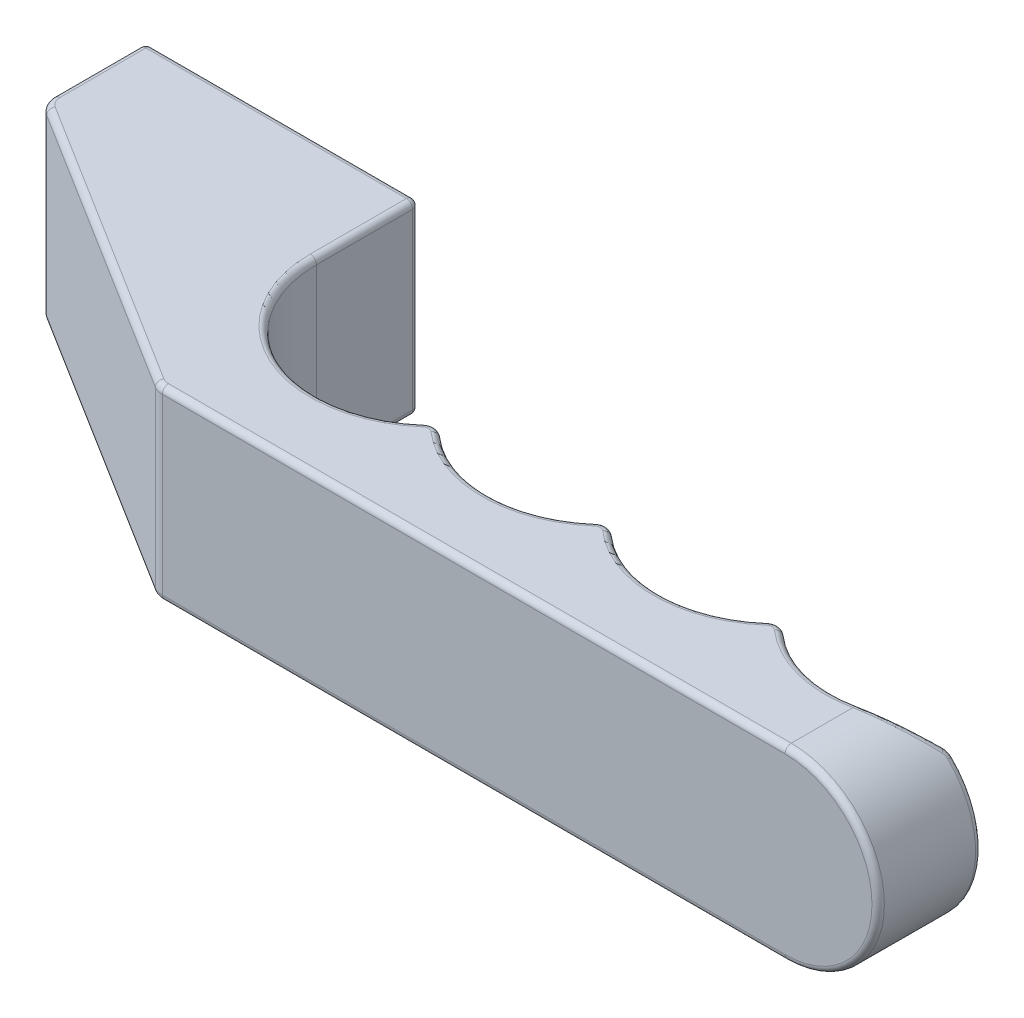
ISO-10303-21;
HEADER;
FILE_DESCRIPTION(('STEP AP214'),'2;1');
FILE_NAME('part.step','',(''),(''),'','','');
FILE_SCHEMA(('AUTOMOTIVE_DESIGN { 1 0 10303 214 1 1 1 1 }'));
ENDSEC;
DATA;
#1=APPLICATION_CONTEXT('core data for automotive mechanical design processes');
#2=APPLICATION_PROTOCOL_DEFINITION('international standard','automotive_design',2000,#1);
#3=PRODUCT_CONTEXT('',#1,'mechanical');
#4=PRODUCT('Part','Part','',(#3));
#5=PRODUCT_RELATED_PRODUCT_CATEGORY('part','',(#4));
#6=PRODUCT_DEFINITION_FORMATION('','',#4);
#7=PRODUCT_DEFINITION_CONTEXT('part definition',#1,'design');
#8=PRODUCT_DEFINITION('design','',#6,#7);
#9=PRODUCT_DEFINITION_SHAPE('','',#8);
#10=(LENGTH_UNIT() NAMED_UNIT(*) SI_UNIT(.MILLI.,.METRE.));
#11=(NAMED_UNIT(*) PLANE_ANGLE_UNIT() SI_UNIT($,.RADIAN.));
#12=(NAMED_UNIT(*) SI_UNIT($,.STERADIAN.) SOLID_ANGLE_UNIT());
#13=UNCERTAINTY_MEASURE_WITH_UNIT(LENGTH_MEASURE(1.E-05),#10,'distance_accuracy_value','');
#14=(GEOMETRIC_REPRESENTATION_CONTEXT(3) GLOBAL_UNCERTAINTY_ASSIGNED_CONTEXT((#13)) GLOBAL_UNIT_ASSIGNED_CONTEXT((#10,
#11,#12)) REPRESENTATION_CONTEXT('',''));
#15=CARTESIAN_POINT('',(0.,0.,0.));
#16=DIRECTION('',(0.,0.,1.));
#17=DIRECTION('',(1.,0.,0.));
#18=AXIS2_PLACEMENT_3D('',#15,#16,#17);
#19=CARTESIAN_POINT('',(-14.,-15.,0.));
#20=DIRECTION('',(0.,0.,1.));
#21=DIRECTION('',(0.,-1.,0.));
#22=AXIS2_PLACEMENT_3D('',#19,#20,#21);
#23=PLANE('',#22);
#24=CARTESIAN_POINT('',(20.,0.,0.));
#25=DIRECTION('',(0.,0.,-1.));
#26=DIRECTION('',(-1.,0.,0.));
#27=AXIS2_PLACEMENT_3D('',#24,#25,#26);
#28=CIRCLE('',#27,4.);
#29=CARTESIAN_POINT('',(16.,0.,0.));
#30=VERTEX_POINT('',#29);
#31=EDGE_CURVE('E850',#30,#30,#28,.T.);
#32=ORIENTED_EDGE('',*,*,#31,.F.);
#33=EDGE_LOOP('',(#32));
#34=FACE_BOUND('',#33,.T.);
#35=CARTESIAN_POINT('',(0.,0.,0.));
#36=DIRECTION('',(0.,0.,-1.));
#37=DIRECTION('',(-1.,0.,0.));
#38=AXIS2_PLACEMENT_3D('',#35,#36,#37);
#39=CIRCLE('',#38,4.);
#40=CARTESIAN_POINT('',(-4.,0.,0.));
#41=VERTEX_POINT('',#40);
#42=EDGE_CURVE('E842',#41,#41,#39,.T.);
#43=ORIENTED_EDGE('',*,*,#42,.F.);
#44=EDGE_LOOP('',(#43));
#45=FACE_BOUND('',#44,.T.);
#46=DIRECTION('',(1.,0.,0.));
#47=VECTOR('',#46,1.);
#48=CARTESIAN_POINT('',(-14.,-14.,0.));
#49=LINE('',#48,#47);
#50=CARTESIAN_POINT('',(29.,-14.,0.));
#51=VERTEX_POINT('',#50);
#52=CARTESIAN_POINT('',(-13.,-14.,0.));
#53=VERTEX_POINT('',#52);
#54=EDGE_CURVE('E709',#51,#53,#49,.F.);
#55=ORIENTED_EDGE('',*,*,#54,.T.);
#56=DIRECTION('',(0.,1.,0.));
#57=VECTOR('',#56,1.);
#58=CARTESIAN_POINT('',(-13.,14.,0.));
#59=LINE('',#58,#57);
#60=CARTESIAN_POINT('',(-13.,14.,0.));
#61=VERTEX_POINT('',#60);
#62=EDGE_CURVE('E23',#53,#61,#59,.T.);
#63=ORIENTED_EDGE('',*,*,#62,.T.);
#64=DIRECTION('',(1.,0.,0.));
#65=VECTOR('',#64,1.);
#66=CARTESIAN_POINT('',(-14.,14.,0.));
#67=LINE('',#66,#65);
#68=CARTESIAN_POINT('',(29.,14.,0.));
#69=VERTEX_POINT('',#68);
#70=EDGE_CURVE('E713',#61,#69,#67,.T.);
#71=ORIENTED_EDGE('',*,*,#70,.T.);
#72=DIRECTION('',(0.,1.,0.));
#73=VECTOR('',#72,1.);
#74=CARTESIAN_POINT('',(29.,-15.,0.));
#75=LINE('',#74,#73);
#76=EDGE_CURVE('E711',#69,#51,#75,.F.);
#77=ORIENTED_EDGE('',*,*,#76,.T.);
#78=EDGE_LOOP('',(#55,#63,#71,#77));
#79=FACE_BOUND('',#78,.T.);
#80=ADVANCED_FACE('F14',(#34,#45,#79),#23,.F.);
#81=CARTESIAN_POINT('',(132.,-15.,16.5));
#82=DIRECTION('',(0.,1.,0.));
#83=DIRECTION('',(-1.,0.,0.));
#84=AXIS2_PLACEMENT_3D('',#81,#82,#83);
#85=CYLINDRICAL_SURFACE('',#84,19.);
#86=CARTESIAN_POINT('',(132.,14.,16.5));
#87=DIRECTION('',(0.,-1.,0.));
#88=DIRECTION('',(1.,0.,0.));
#89=AXIS2_PLACEMENT_3D('',#86,#87,#88);
#90=CIRCLE('',#89,19.);
#91=CARTESIAN_POINT('',(119.484126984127,14.,30.7952062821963));
#92=VERTEX_POINT('',#91);
#93=CARTESIAN_POINT('',(135.8,14.,35.1161220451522));
#94=VERTEX_POINT('',#93);
#95=EDGE_CURVE('E283',#92,#94,#90,.F.);
#96=ORIENTED_EDGE('',*,*,#95,.T.);
#97=CARTESIAN_POINT('',(131.776015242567,14.3929827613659,36.4999170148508));
#98=CARTESIAN_POINT('',(131.774917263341,14.3926605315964,36.085942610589));
#99=CARTESIAN_POINT('',(131.856538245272,14.1116672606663,35.7930997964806));
#100=CARTESIAN_POINT('',(131.938159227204,13.8306739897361,35.5002569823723));
#101=CARTESIAN_POINT('',(132.054733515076,13.4334505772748,35.4999211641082));
#102=CARTESIAN_POINT('',(132.121642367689,14.4944893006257,36.4990544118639));
#103=CARTESIAN_POINT('',(132.114218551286,14.4923535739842,36.0864211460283));
#104=CARTESIAN_POINT('',(132.184459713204,14.2096688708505,35.7938504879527));
#105=CARTESIAN_POINT('',(132.254377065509,13.9269273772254,35.501304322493));
#106=CARTESIAN_POINT('',(132.361189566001,13.5281900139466,35.4991016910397));
#107=CARTESIAN_POINT('',(132.470956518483,14.5834103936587,36.4902462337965));
#108=CARTESIAN_POINT('',(132.457190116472,14.5799202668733,36.0787709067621));
#109=CARTESIAN_POINT('',(132.515728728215,14.2956846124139,35.786538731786));
#110=CARTESIAN_POINT('',(132.574107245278,14.0114238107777,35.4943206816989));
#111=CARTESIAN_POINT('',(132.670914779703,13.611183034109,35.4907339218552));
#112=CARTESIAN_POINT('',(133.174104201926,14.735776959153,36.4562227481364));
#113=CARTESIAN_POINT('',(133.147102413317,14.7304303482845,36.0467396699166));
#114=CARTESIAN_POINT('',(133.182304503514,14.4435007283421,35.755282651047));
#115=CARTESIAN_POINT('',(133.217356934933,14.1565275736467,35.4638260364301));
#116=CARTESIAN_POINT('',(133.294372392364,13.753391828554,35.4584116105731));
#117=CARTESIAN_POINT('',(133.527936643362,14.7992284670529,36.4310113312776));
#118=CARTESIAN_POINT('',(133.494202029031,14.7934262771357,36.0223629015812));
#119=CARTESIAN_POINT('',(133.517610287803,14.5053068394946,35.7313422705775));
#120=CARTESIAN_POINT('',(133.541024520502,14.2171856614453,35.4403194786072));
#121=CARTESIAN_POINT('',(133.608103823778,13.8126132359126,35.4344607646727));
#122=CARTESIAN_POINT('',(134.235589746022,14.9001367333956,36.3638404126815));
#123=CARTESIAN_POINT('',(134.188024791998,14.8943419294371,35.9565392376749));
#124=CARTESIAN_POINT('',(134.188014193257,14.6042490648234,35.6664910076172));
#125=CARTESIAN_POINT('',(134.188005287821,14.3141590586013,35.3764441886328));
#126=CARTESIAN_POINT('',(134.235556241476,13.906794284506,35.3706483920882));
#127=CARTESIAN_POINT('',(134.589400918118,14.9377268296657,36.3219686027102));
#128=CARTESIAN_POINT('',(134.534906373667,14.9324140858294,35.9151657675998));
#129=CARTESIAN_POINT('',(134.523104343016,14.6415116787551,35.6256689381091));
#130=CARTESIAN_POINT('',(134.51146622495,14.3506221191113,35.3361482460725));
#131=CARTESIAN_POINT('',(134.549268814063,13.9418783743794,35.3308701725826));
#132=CARTESIAN_POINT('',(135.296070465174,14.9876598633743,36.2214508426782));
#133=CARTESIAN_POINT('',(135.227467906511,14.9842752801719,35.815355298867));
#134=CARTESIAN_POINT('',(135.192236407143,14.6921143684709,35.5270441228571));
#135=CARTESIAN_POINT('',(135.157169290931,14.3999654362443,35.2387084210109));
#136=CARTESIAN_POINT('',(135.175849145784,13.9884825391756,35.2353783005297));
#137=CARTESIAN_POINT('',(135.648928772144,15.0000010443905,36.1628037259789));
#138=CARTESIAN_POINT('',(135.573313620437,14.9980631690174,35.7568847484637));
#139=CARTESIAN_POINT('',(135.526278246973,14.7054527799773,35.4692401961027));
#140=CARTESIAN_POINT('',(135.479565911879,14.4128443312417,35.1815316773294));
#141=CARTESIAN_POINT('',(135.488716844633,14.0000009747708,35.1796635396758));
#142=CARTESIAN_POINT('',(136.396966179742,14.9999988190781,36.0202882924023));
#143=CARTESIAN_POINT('',(136.30635284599,15.0021922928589,35.6144494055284));
#144=CARTESIAN_POINT('',(136.234320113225,14.7089770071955,35.3283083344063));
#145=CARTESIAN_POINT('',(136.162698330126,14.4157633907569,35.0420850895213));
#146=CARTESIAN_POINT('',(136.151976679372,13.9999988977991,35.0442738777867));
#147=CARTESIAN_POINT('',(136.791647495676,14.9842175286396,35.9341251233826));
#148=CARTESIAN_POINT('',(136.693206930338,14.9892018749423,35.5280953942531));
#149=CARTESIAN_POINT('',(136.607835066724,14.695908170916,35.2428576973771));
#150=CARTESIAN_POINT('',(136.523090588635,14.4025675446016,34.9574573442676));
#151=CARTESIAN_POINT('',(136.501927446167,13.9852696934,34.9624188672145));
#152=CARTESIAN_POINT('',(137.572941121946,14.9224492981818,35.7416836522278));
#153=CARTESIAN_POINT('',(137.458914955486,14.9342685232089,35.3349664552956));
#154=CARTESIAN_POINT('',(137.34716537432,14.6411897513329,35.0515927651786));
#155=CARTESIAN_POINT('',(137.236043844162,14.3480649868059,34.7680569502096));
#156=CARTESIAN_POINT('',(137.194674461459,13.927619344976,34.779599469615));
#157=CARTESIAN_POINT('',(137.959552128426,14.8764575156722,35.6354021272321));
#158=CARTESIAN_POINT('',(137.837979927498,14.8922554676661,35.2280965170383));
#159=CARTESIAN_POINT('',(137.712979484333,14.5995355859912,34.9457752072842));
#160=CARTESIAN_POINT('',(137.588800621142,14.3066898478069,34.6631909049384));
#161=CARTESIAN_POINT('',(137.537469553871,13.8846936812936,34.6786320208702));
#162=CARTESIAN_POINT('',(138.722219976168,14.755974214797,35.4039414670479));
#163=CARTESIAN_POINT('',(138.58582303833,14.7809418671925,34.995179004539));
#164=CARTESIAN_POINT('',(138.434617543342,14.4892649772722,34.7149983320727));
#165=CARTESIAN_POINT('',(138.284236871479,14.1974623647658,34.4345541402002));
#166=CARTESIAN_POINT('',(138.213701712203,13.7722426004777,34.4587443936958));
#167=CARTESIAN_POINT('',(139.098262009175,14.6814446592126,35.2787372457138));
#168=CARTESIAN_POINT('',(138.954772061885,14.7115112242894,34.8689969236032));
#169=CARTESIAN_POINT('',(138.790427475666,14.4206125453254,34.5900136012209));
#170=CARTESIAN_POINT('',(138.627073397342,14.1294834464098,34.3106510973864));
#171=CARTESIAN_POINT('',(138.547125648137,13.70268168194,34.3398003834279));
#172=CARTESIAN_POINT('',(139.836857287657,14.5059519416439,35.0111903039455));
#173=CARTESIAN_POINT('',(139.67964657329,14.5473453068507,34.5992329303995));
#174=CARTESIAN_POINT('',(139.489336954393,14.2582877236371,34.3226601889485));
#175=CARTESIAN_POINT('',(139.300021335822,13.9689996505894,34.045707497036));
#176=CARTESIAN_POINT('',(139.202013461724,13.5388884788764,34.0856307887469));
#177=CARTESIAN_POINT('',(140.199411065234,14.4049898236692,34.8688482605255));
#178=CARTESIAN_POINT('',(140.035728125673,14.4524953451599,34.4555304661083));
#179=CARTESIAN_POINT('',(139.832437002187,14.1646163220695,34.1802921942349));
#180=CARTESIAN_POINT('',(139.630275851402,13.8763832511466,33.9045484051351));
#181=CARTESIAN_POINT('',(139.523477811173,13.4446571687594,33.9504058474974));
#182=CARTESIAN_POINT('',(140.906391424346,14.1796978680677,34.5700223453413));
#183=CARTESIAN_POINT('',(140.730430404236,14.2404031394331,34.1537484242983));
#184=CARTESIAN_POINT('',(140.501588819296,13.9551191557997,33.8811648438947));
#185=CARTESIAN_POINT('',(140.273860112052,13.6694870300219,33.608084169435));
#186=CARTESIAN_POINT('',(140.150333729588,13.2343846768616,33.6665212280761));
#187=CARTESIAN_POINT('',(141.250941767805,14.0555654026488,34.4136633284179));
#188=CARTESIAN_POINT('',(141.069300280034,14.1232183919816,33.9956664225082));
#189=CARTESIAN_POINT('',(140.827756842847,13.8394803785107,33.7245323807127));
#190=CARTESIAN_POINT('',(140.58742428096,13.5552624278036,33.4527767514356));
#191=CARTESIAN_POINT('',(140.455835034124,13.1185277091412,33.5179801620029));
#192=CARTESIAN_POINT('',(141.923912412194,13.7854588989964,34.0876058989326));
#193=CARTESIAN_POINT('',(141.73167274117,13.8678948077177,33.6659054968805));
#194=CARTESIAN_POINT('',(141.464979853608,13.5874770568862,33.3976690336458));
#195=CARTESIAN_POINT('',(141.199513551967,13.3065753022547,33.128803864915));
#196=CARTESIAN_POINT('',(141.052535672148,12.866428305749,33.2082256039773));
#197=CARTESIAN_POINT('',(142.252325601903,13.6394753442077,33.9179016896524));
#198=CARTESIAN_POINT('',(142.055257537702,13.7296092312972,33.4940946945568));
#199=CARTESIAN_POINT('',(141.776028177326,13.4511034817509,33.2274322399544));
#200=CARTESIAN_POINT('',(141.498111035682,13.1719705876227,32.9600088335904));
#201=CARTESIAN_POINT('',(141.343728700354,12.730176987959,33.0470066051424));
#202=CARTESIAN_POINT('',(143.211412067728,13.171968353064,33.3917437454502));
#203=CARTESIAN_POINT('',(143.003163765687,13.2853831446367,32.960098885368));
#204=CARTESIAN_POINT('',(142.684716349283,13.0138684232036,32.699263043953));
#205=CARTESIAN_POINT('',(142.37143959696,12.7398571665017,32.4354182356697));
#206=CARTESIAN_POINT('',(142.194118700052,12.293837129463,32.5471565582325));
#207=CARTESIAN_POINT('',(143.817001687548,12.820537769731,33.017784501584));
#208=CARTESIAN_POINT('',(143.602015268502,12.9507563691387,32.5803995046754));
#209=CARTESIAN_POINT('',(143.258911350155,12.6845664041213,32.3234112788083));
#210=CARTESIAN_POINT('',(142.921272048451,12.4147173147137,32.0624481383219));
#211=CARTESIAN_POINT('',(142.73107482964,11.9658352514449,32.1918952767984));
#212=CARTESIAN_POINT('',(144.641488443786,12.2645550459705,32.453487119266));
#213=CARTESIAN_POINT('',(144.417379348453,12.4223380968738,32.0088021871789));
#214=CARTESIAN_POINT('',(144.041558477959,12.1625249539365,31.7553774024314));
#215=CARTESIAN_POINT('',(143.666860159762,11.9019694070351,31.5011418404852));
#216=CARTESIAN_POINT('',(143.462119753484,11.446918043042,31.6558127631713));
#217=CARTESIAN_POINT('',(144.889133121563,12.0861631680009,32.2758842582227));
#218=CARTESIAN_POINT('',(144.663335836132,12.2520815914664,31.8282332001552));
#219=CARTESIAN_POINT('',(144.276768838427,11.9948884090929,31.576481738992));
#220=CARTESIAN_POINT('',(143.891316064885,11.7368505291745,31.3238454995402));
#221=CARTESIAN_POINT('',(143.681698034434,11.280418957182,31.4870900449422));
#222=CARTESIAN_POINT('',(145.249951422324,11.8093741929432,32.0055051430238));
#223=CARTESIAN_POINT('',(145.021864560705,11.9879963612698,31.5534987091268));
#224=CARTESIAN_POINT('',(144.619698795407,11.7345468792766,31.3039246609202));
#225=CARTESIAN_POINT('',(144.217810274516,11.4808863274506,31.0541298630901));
#226=CARTESIAN_POINT('',(144.00162359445,11.022082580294,31.2302298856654));
#227=CARTESIAN_POINT('',(145.368401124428,11.7156196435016,31.9147558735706));
#228=CARTESIAN_POINT('',(145.13980998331,11.8983773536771,31.4611323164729));
#229=CARTESIAN_POINT('',(144.732315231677,11.64632479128,31.212409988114));
#230=CARTESIAN_POINT('',(144.325097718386,11.3940478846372,30.9634573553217));
#231=CARTESIAN_POINT('',(144.106648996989,10.9345783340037,31.1440180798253));
#232=CARTESIAN_POINT('',(145.601793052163,11.5251147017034,31.7320469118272));
#233=CARTESIAN_POINT('',(145.37242424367,11.7161753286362,31.2750927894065));
#234=CARTESIAN_POINT('',(144.954297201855,11.4669762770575,31.0280842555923));
#235=CARTESIAN_POINT('',(144.536449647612,11.2175517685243,30.7808437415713));
#236=CARTESIAN_POINT('',(144.313589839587,10.7567737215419,30.9704445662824));
#237=CARTESIAN_POINT('',(145.716734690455,11.4283638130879,31.6400870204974));
#238=CARTESIAN_POINT('',(145.487091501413,11.623578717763,31.1814103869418));
#239=CARTESIAN_POINT('',(145.06366219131,11.3758493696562,30.9352729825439));
#240=CARTESIAN_POINT('',(144.640512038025,11.1278810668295,30.688893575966));
#241=CARTESIAN_POINT('',(144.415504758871,10.6664728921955,30.883082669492));
#242=CARTESIAN_POINT('',(146.230328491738,10.9827800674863,31.2203934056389));
#243=CARTESIAN_POINT('',(146.001656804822,11.1954808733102,30.7522690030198));
#244=CARTESIAN_POINT('',(145.552543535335,10.955958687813,30.5115073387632));
#245=CARTESIAN_POINT('',(145.106918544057,10.7134376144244,30.2677221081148));
#246=CARTESIAN_POINT('',(144.87089126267,10.2505947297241,30.4843737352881));
#247=CARTESIAN_POINT('',(146.608900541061,10.6171770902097,30.8864254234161));
#248=CARTESIAN_POINT('',(146.381095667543,10.8443254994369,30.4111475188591));
#249=CARTESIAN_POINT('',(145.913475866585,10.6108717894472,30.173787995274));
#250=CARTESIAN_POINT('',(145.449237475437,10.373830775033,29.9330322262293));
#251=CARTESIAN_POINT('',(145.206558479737,9.90936528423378,30.1671041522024));
#252=CARTESIAN_POINT('',(147.322838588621,9.85228356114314,30.2112712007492));
#253=CARTESIAN_POINT('',(147.100053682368,10.1080837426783,29.7202869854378));
#254=CARTESIAN_POINT('',(146.595592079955,9.88719829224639,29.4895704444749));
#255=CARTESIAN_POINT('',(146.094554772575,9.66267980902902,29.2554235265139));
#256=CARTESIAN_POINT('',(145.839583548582,9.19546465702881,29.5257076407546));
#257=CARTESIAN_POINT('',(147.658167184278,9.45296433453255,29.8700790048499));
#258=CARTESIAN_POINT('',(147.439367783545,9.72238769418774,29.370230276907));
#259=CARTESIAN_POINT('',(146.916741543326,9.50858316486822,29.1430649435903));
#260=CARTESIAN_POINT('',(146.39733085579,9.29055596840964,28.9121955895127));
#261=CARTESIAN_POINT('',(146.13690823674,8.8227667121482,29.2015750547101));
#262=CARTESIAN_POINT('',(148.129796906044,8.82817065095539,29.3574418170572));
#263=CARTESIAN_POINT('',(147.918449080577,9.11850802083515,28.844099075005));
#264=CARTESIAN_POINT('',(147.369880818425,8.91415623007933,28.6207764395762));
#265=CARTESIAN_POINT('',(146.822137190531,8.70872497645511,28.3965022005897));
#266=CARTESIAN_POINT('',(146.555086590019,8.23962594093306,28.7145697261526));
#267=CARTESIAN_POINT('',(148.282232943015,8.61485196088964,29.1858501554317));
#268=CARTESIAN_POINT('',(148.074221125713,8.91134310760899,28.6672153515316));
#269=CARTESIAN_POINT('',(147.516602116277,8.71087706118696,28.4456729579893));
#270=CARTESIAN_POINT('',(146.959772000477,8.50925536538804,28.2231574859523));
#271=CARTESIAN_POINT('',(146.690246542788,8.04052849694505,28.5515576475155));
#272=CARTESIAN_POINT('',(148.576184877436,8.17976215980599,28.8438471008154));
#273=CARTESIAN_POINT('',(148.375787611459,8.4878382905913,28.3139446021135));
#274=CARTESIAN_POINT('',(147.800124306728,8.29538700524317,28.0959665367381));
#275=CARTESIAN_POINT('',(147.225253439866,8.10177399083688,27.8770110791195));
#276=CARTESIAN_POINT('',(146.950883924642,7.63444468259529,28.2266547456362));
#277=CARTESIAN_POINT('',(148.717701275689,7.95799143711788,28.6734356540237));
#278=CARTESIAN_POINT('',(148.521544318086,8.27142240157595,28.1375395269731));
#279=CARTESIAN_POINT('',(147.936925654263,8.08317652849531,27.9213635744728));
#280=CARTESIAN_POINT('',(147.353061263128,7.89369070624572,27.7041920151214));
#281=CARTESIAN_POINT('',(147.076361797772,7.42745867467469,28.064763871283));
#282=CARTESIAN_POINT('',(148.989622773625,7.50595017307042,28.3352253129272));
#283=CARTESIAN_POINT('',(148.802921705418,7.82905677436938,27.7865417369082));
#284=CARTESIAN_POINT('',(148.200476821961,7.6494883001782,27.5739581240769));
#285=CARTESIAN_POINT('',(147.598786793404,7.46867641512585,27.3603808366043));
#286=CARTESIAN_POINT('',(147.317465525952,7.00555349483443,27.7434640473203));
#287=CARTESIAN_POINT('',(149.120038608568,7.27568815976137,28.1674240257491));
#288=CARTESIAN_POINT('',(148.938508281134,7.60303916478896,27.6119398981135));
#289=CARTESIAN_POINT('',(148.327236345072,7.4280198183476,27.4011540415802));
#290=CARTESIAN_POINT('',(147.716669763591,7.2516816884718,27.1893800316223));
#291=CARTESIAN_POINT('',(147.4331008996,6.7906422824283,27.5840528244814));
#292=CARTESIAN_POINT('',(149.369754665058,6.80589031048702,27.8358899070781));
#293=CARTESIAN_POINT('',(149.19958696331,7.14022458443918,27.2658165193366));
#294=CARTESIAN_POINT('',(148.570757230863,6.97462203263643,27.0586333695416));
#295=CARTESIAN_POINT('',(147.942645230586,6.80768873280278,26.8504367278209));
#296=CARTESIAN_POINT('',(147.654515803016,6.35216428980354,27.2690954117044));
#297=CARTESIAN_POINT('',(149.489052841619,6.5663527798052,27.6721578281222));
#298=CARTESIAN_POINT('',(149.325023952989,6.90335144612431,27.0943055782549));
#299=CARTESIAN_POINT('',(148.687516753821,6.74269081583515,26.8889173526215));
#300=CARTESIAN_POINT('',(148.050683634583,6.58061948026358,26.6825048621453));
#301=CARTESIAN_POINT('',(147.760293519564,6.1285959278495,27.1135499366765));
#302=CARTESIAN_POINT('',(149.602688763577,6.32193470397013,27.5113047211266));
#303=CARTESIAN_POINT('',(149.444950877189,6.66133387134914,26.9256401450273));
#304=CARTESIAN_POINT('',(148.799205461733,6.50506870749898,26.7215076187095));
#305=CARTESIAN_POINT('',(148.153460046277,6.34880354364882,26.5173750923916));
#306=CARTESIAN_POINT('',(147.861050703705,5.90047239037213,26.9607394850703));
#307=(BOUNDED_SURFACE() B_SPLINE_SURFACE(3,2,((#97,#98,#99,#100,#101),(#102,#103,#104,#105,
#106),(#107,#108,#109,#110,#111),(#112,#113,#114,#115,#116),(#117,#118,#119,#120,#121),(#122,
#123,#124,#125,#126),(#127,#128,#129,#130,#131),(#132,#133,#134,#135,#136),(#137,#138,#139,#140,
#141),(#142,#143,#144,#145,#146),(#147,#148,#149,#150,#151),(#152,#153,#154,#155,#156),(#157,
#158,#159,#160,#161),(#162,#163,#164,#165,#166),(#167,#168,#169,#170,#171),(#172,#173,#174,#175,
#176),(#177,#178,#179,#180,#181),(#182,#183,#184,#185,#186),(#187,#188,#189,#190,#191),(#192,
#193,#194,#195,#196),(#197,#198,#199,#200,#201),(#202,#203,#204,#205,#206),(#207,#208,#209,#210,
#211),(#212,#213,#214,#215,#216),(#217,#218,#219,#220,#221),(#222,#223,#224,#225,#226),(#227,
#228,#229,#230,#231),(#232,#233,#234,#235,#236),(#237,#238,#239,#240,#241),(#242,#243,#244,#245,
#246),(#247,#248,#249,#250,#251),(#252,#253,#254,#255,#256),(#257,#258,#259,#260,#261),(#262,
#263,#264,#265,#266),(#267,#268,#269,#270,#271),(#272,#273,#274,#275,#276),(#277,#278,#279,#280,
#281),(#282,#283,#284,#285,#286),(#287,#288,#289,#290,#291),(#292,#293,#294,#295,#296),(#297,
#298,#299,#300,#301),(#302,#303,#304,#305,#306)),.UNSPECIFIED.,.F.,.F.,
.F.) B_SPLINE_SURFACE_WITH_KNOTS((4,2,2,2,2,2,2,2,2,2,2,2,2,2,2,2,2,2,2,2,4),(3,2,3),(0.,
1.00833903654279,2.01643898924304,3.01930156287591,4.02223389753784,5.15627789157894,
6.29050370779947,7.4262465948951,8.56194463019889,9.68837677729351,10.8153009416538,
13.0657406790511,14.0724935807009,14.5754409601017,15.0784720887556,16.8577719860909,
18.6386006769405,19.5349871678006,20.4313325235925,21.3268009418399,22.2224337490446),(0.,0.5,
1.),.UNSPECIFIED.) GEOMETRIC_REPRESENTATION_ITEM() RATIONAL_B_SPLINE_SURFACE(((1.,
0.923957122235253,1.,0.923957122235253,1.),(1.,0.924385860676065,1.,0.924385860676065,1.),(1.,
0.924709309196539,1.,0.924709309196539,1.),(1.,0.925139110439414,1.,0.925139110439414,1.),(1.,
0.925245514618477,1.,0.925245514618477,1.),(1.,0.925234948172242,1.,0.925234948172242,1.),(1.,
0.925119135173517,1.,0.925119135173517,1.),(1.,0.924665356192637,1.,0.924665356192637,1.),(1.,
0.924327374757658,1.,0.924327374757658,1.),(1.,0.923373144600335,1.,0.923373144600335,1.),(1.,
0.922726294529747,1.,0.922726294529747,1.),(1.,0.921160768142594,1.,0.921160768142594,1.),(1.,
0.920242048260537,1.,0.920242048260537,1.),(1.,0.918144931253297,1.,0.918144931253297,1.),(1.,
0.91696618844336,1.,0.91696618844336,1.),(1.,0.914366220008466,1.,0.914366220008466,1.),(1.,
0.912945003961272,1.,0.912945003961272,1.),(1.,0.909890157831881,1.,0.909890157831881,1.),(1.,
0.908258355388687,1.,0.908258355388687,1.),(1.,0.904790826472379,1.,0.904790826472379,1.),(1.,
0.902955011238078,1.,0.902955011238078,1.),(1.,0.897170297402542,1.,0.897170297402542,1.),(1.,
0.89293943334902,1.,0.89293943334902,1.),(1.,0.886370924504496,1.,0.886370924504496,1.),(1.,
0.884279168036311,1.,0.884279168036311,1.),(1.,0.881055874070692,1.,0.881055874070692,1.),(1.,
0.87996764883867,1.,0.87996764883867,1.),(1.,0.877763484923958,1.,0.877763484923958,1.),(1.,
0.876647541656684,1.,0.876647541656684,1.),(1.,0.871523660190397,1.,0.871523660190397,1.),(1.,
0.867361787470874,1.,0.867361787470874,1.),(1.,0.858751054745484,1.,0.858751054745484,1.),(1.,
0.854301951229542,1.,0.854301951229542,1.),(1.,0.847442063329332,1.,0.847442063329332,1.),(1.,
0.845116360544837,1.,0.845116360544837,1.),(1.,0.840415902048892,1.,0.840415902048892,1.),(1.,
0.838041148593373,1.,0.838041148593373,1.),(1.,0.833256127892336,1.,0.833256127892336,1.),(1.,
0.830845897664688,1.,0.830845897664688,1.),(1.,0.826004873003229,1.,0.826004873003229,1.),(1.,
0.823574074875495,1.,0.823574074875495,1.),(1.,0.821142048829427,1.,0.821142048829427,1.))) REPRESENTATION_ITEM('') SURFACE());
#308=CARTESIAN_POINT('',(132.054733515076,13.4334505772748,35.4999211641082));
#309=CARTESIAN_POINT('',(132.361189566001,13.5281900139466,35.4991016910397));
#310=CARTESIAN_POINT('',(132.670914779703,13.611183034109,35.4907339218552));
#311=CARTESIAN_POINT('',(133.294372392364,13.753391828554,35.4584116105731));
#312=CARTESIAN_POINT('',(133.608103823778,13.8126132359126,35.4344607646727));
#313=CARTESIAN_POINT('',(134.235556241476,13.906794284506,35.3706483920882));
#314=CARTESIAN_POINT('',(134.549268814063,13.9418783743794,35.3308701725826));
#315=CARTESIAN_POINT('',(135.175849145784,13.9884825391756,35.2353783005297));
#316=CARTESIAN_POINT('',(135.488716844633,14.0000009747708,35.1796635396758));
#317=CARTESIAN_POINT('',(136.151976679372,13.9999988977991,35.0442738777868));
#318=CARTESIAN_POINT('',(136.501927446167,13.9852696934,34.9624188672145));
#319=CARTESIAN_POINT('',(137.194674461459,13.927619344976,34.779599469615));
#320=CARTESIAN_POINT('',(137.537469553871,13.8846936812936,34.6786320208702));
#321=CARTESIAN_POINT('',(138.213701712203,13.7722426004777,34.4587443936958));
#322=CARTESIAN_POINT('',(138.547125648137,13.70268168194,34.3398003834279));
#323=CARTESIAN_POINT('',(139.202013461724,13.5388884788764,34.0856307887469));
#324=CARTESIAN_POINT('',(139.523477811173,13.4446571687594,33.9504058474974));
#325=CARTESIAN_POINT('',(140.150333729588,13.2343846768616,33.6665212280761));
#326=CARTESIAN_POINT('',(140.455835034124,13.1185277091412,33.5179801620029));
#327=CARTESIAN_POINT('',(141.052535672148,12.866428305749,33.2082256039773));
#328=CARTESIAN_POINT('',(141.343728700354,12.730176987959,33.0470066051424));
#329=CARTESIAN_POINT('',(142.194118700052,12.293837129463,32.5471565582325));
#330=CARTESIAN_POINT('',(142.73107482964,11.9658352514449,32.1918952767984));
#331=CARTESIAN_POINT('',(143.462119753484,11.446918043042,31.6558127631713));
#332=CARTESIAN_POINT('',(143.681698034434,11.280418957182,31.4870900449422));
#333=CARTESIAN_POINT('',(144.00162359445,11.022082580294,31.2302298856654));
#334=CARTESIAN_POINT('',(144.106648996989,10.9345783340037,31.1440180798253));
#335=CARTESIAN_POINT('',(144.313589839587,10.7567737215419,30.9704445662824));
#336=CARTESIAN_POINT('',(144.415504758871,10.6664728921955,30.883082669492));
#337=CARTESIAN_POINT('',(144.87089126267,10.2505947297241,30.4843737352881));
#338=CARTESIAN_POINT('',(145.206558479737,9.90936528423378,30.1671041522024));
#339=CARTESIAN_POINT('',(145.839583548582,9.19546465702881,29.5257076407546));
#340=CARTESIAN_POINT('',(146.13690823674,8.8227667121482,29.2015750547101));
#341=CARTESIAN_POINT('',(146.555086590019,8.23962594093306,28.7145697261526));
#342=CARTESIAN_POINT('',(146.690246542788,8.04052849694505,28.5515576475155));
#343=CARTESIAN_POINT('',(146.950883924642,7.63444468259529,28.2266547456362));
#344=CARTESIAN_POINT('',(147.076361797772,7.42745867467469,28.064763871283));
#345=CARTESIAN_POINT('',(147.317465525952,7.00555349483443,27.7434640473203));
#346=CARTESIAN_POINT('',(147.4331008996,6.7906422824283,27.5840528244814));
#347=CARTESIAN_POINT('',(147.654515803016,6.35216428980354,27.2690954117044));
#348=CARTESIAN_POINT('',(147.760293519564,6.1285959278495,27.1135499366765));
#349=CARTESIAN_POINT('',(147.861050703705,5.90047239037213,26.9607394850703));
#350=B_SPLINE_CURVE_WITH_KNOTS('',3,(#308,#309,#310,#311,#312,#313,#314,#315,#316,#317,#318,
#319,#320,#321,#322,#323,#324,#325,#326,#327,#328,#329,#330,#331,#332,#333,#334,#335,#336,#337,
#338,#339,#340,#341,#342,#343,#344,#345,#346,#347,#348,#349),.UNSPECIFIED.,.F.,.F.,(4,2,2,2,2,2,
2,2,2,2,2,2,2,2,2,2,2,2,2,2,4),(0.,1.00833903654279,2.01643898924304,3.01930156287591,
4.02223389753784,5.15627789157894,6.29050370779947,7.4262465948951,8.56194463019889,
9.68837677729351,10.8153009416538,13.0657406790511,14.0724935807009,14.5754409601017,
15.0784720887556,16.8577719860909,18.6386006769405,19.5349871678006,20.4313325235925,
21.3268009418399,22.2224337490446),.UNSPECIFIED.);
#351=CARTESIAN_POINT('',(144.515873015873,10.5748123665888,30.7952062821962));
#352=VERTEX_POINT('',#351);
#353=EDGE_CURVE('E271',#94,#352,#350,.T.);
#354=ORIENTED_EDGE('',*,*,#353,.T.);
#355=DIRECTION('',(0.,1.,0.));
#356=VECTOR('',#355,1.);
#357=CARTESIAN_POINT('',(144.515873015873,-15.,30.7952062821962));
#358=LINE('',#357,#356);
#359=CARTESIAN_POINT('',(144.515873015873,-10.5748123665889,30.7952062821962));
#360=VERTEX_POINT('',#359);
#361=EDGE_CURVE('E254',#360,#352,#358,.T.);
#362=ORIENTED_EDGE('',*,*,#361,.F.);
#363=CARTESIAN_POINT('',(149.602688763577,-6.32193470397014,27.5113047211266));
#364=CARTESIAN_POINT('',(149.444950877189,-6.66133387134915,26.9256401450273));
#365=CARTESIAN_POINT('',(148.799205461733,-6.50506870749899,26.7215076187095));
#366=CARTESIAN_POINT('',(148.153460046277,-6.34880354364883,26.5173750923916));
#367=CARTESIAN_POINT('',(147.861050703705,-5.90047239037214,26.9607394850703));
#368=CARTESIAN_POINT('',(149.489845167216,-6.56465011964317,27.6710354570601));
#369=CARTESIAN_POINT('',(149.325857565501,-6.90167109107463,27.093132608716));
#370=CARTESIAN_POINT('',(148.688295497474,-6.74103604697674,26.8877493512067));
#371=CARTESIAN_POINT('',(148.051397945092,-6.57900996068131,26.681356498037));
#372=CARTESIAN_POINT('',(147.760996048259,-6.12700677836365,27.1124836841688));
#373=CARTESIAN_POINT('',(149.371417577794,-6.8025516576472,27.8336068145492));
#374=CARTESIAN_POINT('',(149.201330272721,-7.13693315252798,27.2634322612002));
#375=CARTESIAN_POINT('',(148.572384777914,-6.97138973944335,27.0562668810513));
#376=CARTESIAN_POINT('',(147.944146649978,-6.80453354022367,26.8481022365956));
#377=CARTESIAN_POINT('',(147.655990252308,-6.34904821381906,27.2669264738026));
#378=CARTESIAN_POINT('',(149.123597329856,-7.2691996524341,28.1627726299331));
#379=CARTESIAN_POINT('',(148.942213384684,-7.59666791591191,27.6070987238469));
#380=CARTESIAN_POINT('',(148.330701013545,-7.42176810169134,27.3963561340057));
#381=CARTESIAN_POINT('',(147.719883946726,-7.24556722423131,27.1846389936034));
#382=CARTESIAN_POINT('',(147.436256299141,-6.78458634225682,27.5796339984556));
#383=CARTESIAN_POINT('',(148.99420681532,-7.49794788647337,28.3293662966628));
#384=CARTESIAN_POINT('',(148.807677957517,-7.82121530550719,27.7804549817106));
#385=CARTESIAN_POINT('',(148.204929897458,-7.6417947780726,27.5679272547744));
#386=CARTESIAN_POINT('',(147.602925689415,-7.46114696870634,27.3544194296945));
#387=CARTESIAN_POINT('',(147.321530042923,-6.9980846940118,27.7378979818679));
#388=CARTESIAN_POINT('',(148.724548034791,-7.94697519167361,28.6650711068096));
#389=CARTESIAN_POINT('',(148.528605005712,-8.26066852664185,28.1288785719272));
#390=CARTESIAN_POINT('',(147.9435519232,-8.07262283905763,27.9127836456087));
#391=CARTESIAN_POINT('',(147.359241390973,-7.8833543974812,27.695707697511));
#392=CARTESIAN_POINT('',(147.082432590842,-7.41717684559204,28.0568175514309));
#393=CARTESIAN_POINT('',(148.584274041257,-8.16724971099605,28.8341835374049));
#394=CARTESIAN_POINT('',(148.384105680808,-8.47564448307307,28.303953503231));
#395=CARTESIAN_POINT('',(147.80793988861,-8.28341927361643,28.0860697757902));
#396=CARTESIAN_POINT('',(147.232554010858,-8.09004785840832,27.8672227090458));
#397=CARTESIAN_POINT('',(146.958056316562,-7.62276639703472,28.2174743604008));
#398=CARTESIAN_POINT('',(148.29296760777,-8.5994687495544,29.1735971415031));
#399=CARTESIAN_POINT('',(148.085202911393,-8.89639845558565,28.6545809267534));
#400=CARTESIAN_POINT('',(147.526943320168,-8.69620456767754,28.433158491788));
#401=CARTESIAN_POINT('',(146.969460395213,-8.49487025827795,28.2107766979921));
#402=CARTESIAN_POINT('',(146.699764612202,-8.02617083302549,28.5399172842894));
#403=CARTESIAN_POINT('',(148.141934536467,-8.81141277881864,29.3438983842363));
#404=CARTESIAN_POINT('',(147.930836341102,-9.10225069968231,28.8301508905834));
#405=CARTESIAN_POINT('',(147.381558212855,-8.89819290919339,28.6069611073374));
#406=CARTESIAN_POINT('',(146.833092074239,-8.69306906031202,28.3828324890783));
#407=CARTESIAN_POINT('',(146.565848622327,-8.22398526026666,28.701703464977));
#408=CARTESIAN_POINT('',(147.670220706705,-9.43828029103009,29.8576389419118));
#409=CARTESIAN_POINT('',(147.451605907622,-9.70816915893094,29.3574353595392));
#410=CARTESIAN_POINT('',(146.928292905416,-9.49465091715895,29.1304228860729));
#411=CARTESIAN_POINT('',(146.408236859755,-9.27684190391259,28.8996512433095));
#412=CARTESIAN_POINT('',(146.147595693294,-8.80906160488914,29.1897569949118));
#413=CARTESIAN_POINT('',(147.333012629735,-9.84076664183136,30.2012803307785));
#414=CARTESIAN_POINT('',(147.110349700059,-10.096954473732,29.7100265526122));
#415=CARTESIAN_POINT('',(146.605324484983,-9.87628920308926,29.4794340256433));
#416=CARTESIAN_POINT('',(146.103768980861,-9.65193637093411,29.2453616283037));
#417=CARTESIAN_POINT('',(145.848604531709,-9.18471553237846,29.5162163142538));
#418=CARTESIAN_POINT('',(146.614594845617,-10.6116788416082,30.8814018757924));
#419=CARTESIAN_POINT('',(146.386830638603,-10.8390189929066,30.4059917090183));
#420=CARTESIAN_POINT('',(145.918904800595,-10.6056822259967,30.1687081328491));
#421=CARTESIAN_POINT('',(145.45441138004,-10.3686987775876,29.927973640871));
#422=CARTESIAN_POINT('',(145.21160742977,-9.90423358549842,30.1623317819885));
#423=CARTESIAN_POINT('',(146.233400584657,-10.9801165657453,31.2178844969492));
#424=CARTESIAN_POINT('',(146.004753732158,-11.1929063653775,30.7496880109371));
#425=CARTESIAN_POINT('',(145.555467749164,-10.95344877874,30.5089741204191));
#426=CARTESIAN_POINT('',(145.109725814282,-10.7109451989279,30.2651890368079));
#427=CARTESIAN_POINT('',(144.873615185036,-10.2481087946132,30.4819902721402));
#428=CARTESIAN_POINT('',(145.523942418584,-11.5956251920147,31.7976299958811));
#429=CARTESIAN_POINT('',(145.295483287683,-11.7829876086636,31.3412080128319));
#430=CARTESIAN_POINT('',(144.880146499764,-11.5334661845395,31.0943444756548));
#431=CARTESIAN_POINT('',(144.466836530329,-11.2822055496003,30.8457234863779));
#432=CARTESIAN_POINT('',(144.244562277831,-10.8225835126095,31.0327484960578));
#433=CARTESIAN_POINT('',(145.205141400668,-11.8505122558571,32.0437739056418));
#434=CARTESIAN_POINT('',(144.977967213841,-12.0267656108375,31.5918356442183));
#435=CARTESIAN_POINT('',(144.577021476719,-11.7733261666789,31.3425781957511));
#436=CARTESIAN_POINT('',(144.178113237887,-11.5184082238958,31.0917519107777));
#437=CARTESIAN_POINT('',(143.96189204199,-11.0604781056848,31.2665852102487));
#438=CARTESIAN_POINT('',(144.541772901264,-12.3372332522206,32.525521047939));
#439=CARTESIAN_POINT('',(144.318775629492,-12.4913389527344,32.0816666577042));
#440=CARTESIAN_POINT('',(143.946833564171,-12.2308416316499,31.8279530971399));
#441=CARTESIAN_POINT('',(143.576912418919,-11.9688764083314,31.5726825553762));
#442=CARTESIAN_POINT('',(143.373705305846,-11.5147510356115,31.7242449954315));
#443=CARTESIAN_POINT('',(144.197207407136,-12.5690689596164,32.7611250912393));
#444=CARTESIAN_POINT('',(143.977097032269,-12.712395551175,32.3210625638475));
#445=CARTESIAN_POINT('',(143.619772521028,-12.448498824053,32.0650951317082));
#446=CARTESIAN_POINT('',(143.264443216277,-12.1833929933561,31.8077732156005));
#447=CARTESIAN_POINT('',(143.068190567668,-11.7311310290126,31.9480688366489));
#448=CARTESIAN_POINT('',(143.483389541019,-13.0066789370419,33.2183631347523));
#449=CARTESIAN_POINT('',(143.270582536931,-13.128824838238,32.7850541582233));
#450=CARTESIAN_POINT('',(142.942659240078,-12.8589033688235,32.5249390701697));
#451=CARTESIAN_POINT('',(142.616709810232,-12.587785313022,32.2634829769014));
#452=CARTESIAN_POINT('',(142.435272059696,-12.1395670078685,32.382444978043));
#453=CARTESIAN_POINT('',(143.114200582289,-13.2125164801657,33.4400303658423));
#454=CARTESIAN_POINT('',(142.905762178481,-13.3245140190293,33.0098880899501));
#455=CARTESIAN_POINT('',(142.592666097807,-13.051711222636,32.7476753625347));
#456=CARTESIAN_POINT('',(142.281472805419,-12.7779659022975,32.484335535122));
#457=CARTESIAN_POINT('',(142.107924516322,-12.3316820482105,32.5930288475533));
#458=CARTESIAN_POINT('',(142.351066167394,-13.595814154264,33.8670324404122));
#459=CARTESIAN_POINT('',(142.152826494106,-13.6881207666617,33.4424361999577));
#460=CARTESIAN_POINT('',(141.869545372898,-13.4103212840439,33.1764068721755));
#461=CARTESIAN_POINT('',(141.588152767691,-13.1315841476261,32.9092568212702));
#462=CARTESIAN_POINT('',(141.431278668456,-12.6894265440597,32.9986808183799));
#463=CARTESIAN_POINT('',(141.957126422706,-13.7732807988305,34.0723710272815));
#464=CARTESIAN_POINT('',(141.764617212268,-13.856296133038,33.6503704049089));
#465=CARTESIAN_POINT('',(141.496423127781,-13.5761296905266,33.3824059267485));
#466=CARTESIAN_POINT('',(141.229990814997,-13.2952710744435,33.1135415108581));
#467=CARTESIAN_POINT('',(141.081985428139,-12.8550620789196,33.1937524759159));
#468=CARTESIAN_POINT('',(141.224248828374,-14.0652528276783,34.4258330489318));
#469=CARTESIAN_POINT('',(141.043015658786,-14.1323748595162,34.0079844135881));
#470=CARTESIAN_POINT('',(140.802487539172,-13.8485055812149,33.7367237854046));
#471=CARTESIAN_POINT('',(140.563105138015,-13.5641871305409,33.4648784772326));
#472=CARTESIAN_POINT('',(140.432167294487,-13.1275693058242,33.5295413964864));
#473=CARTESIAN_POINT('',(140.889387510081,-14.1852982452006,34.5773462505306));
#474=CARTESIAN_POINT('',(140.713685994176,-14.2456889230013,34.1611605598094));
#475=CARTESIAN_POINT('',(140.48549405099,-13.9603294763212,33.8884975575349));
#476=CARTESIAN_POINT('',(140.25835258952,-13.6746421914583,33.6153658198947));
#477=CARTESIAN_POINT('',(140.135256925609,-13.2396116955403,33.6734789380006));
#478=CARTESIAN_POINT('',(140.205593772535,-14.4028341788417,34.8660955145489));
#479=CARTESIAN_POINT('',(140.041762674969,-14.4504763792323,34.4527684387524));
#480=CARTESIAN_POINT('',(139.838289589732,-14.1626091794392,34.1775352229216));
#481=CARTESIAN_POINT('',(139.635861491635,-13.8744148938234,33.9018349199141));
#482=CARTESIAN_POINT('',(139.528959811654,-13.4426452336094,33.9477907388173));
#483=CARTESIAN_POINT('',(139.856664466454,-14.5003296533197,35.0033347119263));
#484=CARTESIAN_POINT('',(139.699062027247,-14.542071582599,34.5913172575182));
#485=CARTESIAN_POINT('',(139.508081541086,-14.2530696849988,34.3148023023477));
#486=CARTESIAN_POINT('',(139.318026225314,-13.9638507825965,34.0379317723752));
#487=CARTESIAN_POINT('',(139.219575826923,-13.5336410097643,34.0781679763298));
#488=CARTESIAN_POINT('',(139.147004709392,-14.670693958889,35.2616980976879));
#489=CARTESIAN_POINT('',(139.00256159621,-14.7014808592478,34.8518360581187));
#490=CARTESIAN_POINT('',(138.836549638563,-14.410684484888,34.5729940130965));
#491=CARTESIAN_POINT('',(138.671457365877,-14.1196721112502,34.2937982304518));
#492=CARTESIAN_POINT('',(138.59034417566,-13.6926476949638,34.3236131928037));
#493=CARTESIAN_POINT('',(138.786299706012,-14.7436124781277,35.3828544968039));
#494=CARTESIAN_POINT('',(138.648650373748,-14.769445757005,34.9739464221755));
#495=CARTESIAN_POINT('',(138.495249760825,-14.4778858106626,34.6939513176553));
#496=CARTESIAN_POINT('',(138.342623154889,-14.1862040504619,34.4137059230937));
#497=CARTESIAN_POINT('',(138.270519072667,-13.7607049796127,34.4387117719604));
#498=CARTESIAN_POINT('',(138.054639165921,-14.8632331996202,35.6078605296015));
#499=CARTESIAN_POINT('',(137.931176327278,-14.8801011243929,35.2004037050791));
#500=CARTESIAN_POINT('',(137.802951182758,-14.5874846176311,34.9183329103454));
#501=CARTESIAN_POINT('',(137.675496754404,-14.2947453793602,34.6360117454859));
#502=CARTESIAN_POINT('',(137.621780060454,-13.8723509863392,34.652467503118));
#503=CARTESIAN_POINT('',(137.683689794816,-14.9099508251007,35.7117203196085));
#504=CARTESIAN_POINT('',(137.567456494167,-14.9228910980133,35.3048587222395));
#505=CARTESIAN_POINT('',(137.451958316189,-14.6298966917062,35.0217674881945));
#506=CARTESIAN_POINT('',(137.337059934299,-14.3368516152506,34.7385161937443));
#507=CARTESIAN_POINT('',(137.292871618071,-13.9159541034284,34.7511343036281));
#508=CARTESIAN_POINT('',(137.092906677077,-14.9617052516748,35.8608580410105));
#509=CARTESIAN_POINT('',(136.988229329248,-14.9692865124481,35.4546354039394));
#510=CARTESIAN_POINT('',(136.892916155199,-14.6760423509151,35.1700542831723));
#511=CARTESIAN_POINT('',(136.797803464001,-14.3827823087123,34.8854205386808));
#512=CARTESIAN_POINT('',(136.769043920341,-13.9642582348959,34.8928151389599));
#513=CARTESIAN_POINT('',(136.875622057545,-14.9760151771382,35.912315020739));
#514=CARTESIAN_POINT('',(136.775274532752,-14.9818192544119,35.5062541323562));
#515=CARTESIAN_POINT('',(136.68729675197,-14.6885498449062,35.2211620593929));
#516=CARTESIAN_POINT('',(136.599483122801,-14.3952740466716,34.9360319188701));
#517=CARTESIAN_POINT('',(136.576384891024,-13.977614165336,34.9416992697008));
#518=CARTESIAN_POINT('',(136.439135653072,-14.9951611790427,36.008893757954));
#519=CARTESIAN_POINT('',(136.347545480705,-14.9977780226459,35.6030217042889));
#520=CARTESIAN_POINT('',(136.274215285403,-14.7045991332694,35.3169652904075));
#521=CARTESIAN_POINT('',(136.201048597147,-14.4114139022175,35.0308709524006));
#522=CARTESIAN_POINT('',(136.189366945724,-13.9954837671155,35.0334490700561));
#523=CARTESIAN_POINT('',(136.219934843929,-15.0000018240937,36.0540185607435));
#524=CARTESIAN_POINT('',(136.132734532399,-15.0012171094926,35.6481876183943));
#525=CARTESIAN_POINT('',(136.066754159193,-14.7081452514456,35.3616638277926));
#526=CARTESIAN_POINT('',(136.000900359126,-14.415074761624,35.075115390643));
#527=CARTESIAN_POINT('',(135.99500889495,-14.0000017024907,35.0763176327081));
#528=CARTESIAN_POINT('',(135.649453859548,-14.9999970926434,36.1626998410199));
#529=CARTESIAN_POINT('',(135.573827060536,-14.9980616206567,35.7567805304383));
#530=CARTESIAN_POINT('',(135.526775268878,-14.7054516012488,35.46913743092));
#531=CARTESIAN_POINT('',(135.480044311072,-14.4128420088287,35.1814296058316));
#532=CARTESIAN_POINT('',(135.489182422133,-13.9999972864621,35.1795648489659));
#533=CARTESIAN_POINT('',(135.29704297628,-14.9876923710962,36.2212878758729));
#534=CARTESIAN_POINT('',(135.228420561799,-14.9843116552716,35.8151927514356));
#535=CARTESIAN_POINT('',(135.193157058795,-14.6921497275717,35.5268834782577));
#536=CARTESIAN_POINT('',(135.158057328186,-14.3999993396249,35.238549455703));
#537=CARTESIAN_POINT('',(135.17671143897,-13.9885128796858,35.2352234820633));
#538=CARTESIAN_POINT('',(134.591072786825,-14.9378810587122,36.32175535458));
#539=CARTESIAN_POINT('',(134.536545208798,-14.9325716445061,35.9149547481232));
#540=CARTESIAN_POINT('',(134.52468760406,-14.6416655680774,35.6254604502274));
#541=CARTESIAN_POINT('',(134.512994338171,-14.3507727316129,35.3359425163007));
#542=CARTESIAN_POINT('',(134.550751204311,-13.9420223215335,35.3306675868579));
#543=CARTESIAN_POINT('',(134.23751291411,-14.900359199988,36.3636246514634));
#544=CARTESIAN_POINT('',(134.189910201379,-14.8945663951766,35.956326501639));
#545=CARTESIAN_POINT('',(134.189835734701,-14.6044688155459,35.6662811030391));
#546=CARTESIAN_POINT('',(134.189763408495,-14.3143742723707,35.3762371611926));
#547=CARTESIAN_POINT('',(134.237261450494,-13.9070019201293,35.370443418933));
#548=CARTESIAN_POINT('',(133.529625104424,-14.7995209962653,36.4308842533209));
#549=CARTESIAN_POINT('',(133.495858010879,-14.7937168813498,36.0222396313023));
#550=CARTESIAN_POINT('',(133.519210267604,-14.5055920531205,35.7312211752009));
#551=CARTESIAN_POINT('',(133.542568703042,-14.2174653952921,35.4402004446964));
#552=CARTESIAN_POINT('',(133.609600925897,-13.812886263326,35.4343400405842));
#553=CARTESIAN_POINT('',(133.175310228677,-14.7360193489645,36.4561527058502));
#554=CARTESIAN_POINT('',(133.14828533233,-14.7306701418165,36.0466727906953));
#555=CARTESIAN_POINT('',(133.183447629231,-14.4437362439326,35.7552171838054));
#556=CARTESIAN_POINT('',(133.218459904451,-14.1567586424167,35.4637619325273));
#557=CARTESIAN_POINT('',(133.29544173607,-13.7536180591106,35.4583450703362));
#558=CARTESIAN_POINT('',(132.471437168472,-14.5835335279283,36.4902347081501));
#559=CARTESIAN_POINT('',(132.457661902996,-14.5800415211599,36.0787610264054));
#560=CARTESIAN_POINT('',(132.516184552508,-14.2958037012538,35.7865292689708));
#561=CARTESIAN_POINT('',(132.574547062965,-14.0115408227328,35.494311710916));
#562=CARTESIAN_POINT('',(132.67134095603,-13.6112979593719,35.4907229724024));
#563=CARTESIAN_POINT('',(132.121877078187,-14.4945598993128,36.4990550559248));
#564=CARTESIAN_POINT('',(132.114448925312,-14.4924229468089,36.0864227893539));
#565=CARTESIAN_POINT('',(132.184682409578,-14.2097369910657,35.7938522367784));
#566=CARTESIAN_POINT('',(132.254591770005,-13.9269943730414,35.501306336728));
#567=CARTESIAN_POINT('',(132.361397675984,-13.5282559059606,35.4991023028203));
#568=CARTESIAN_POINT('',(131.776015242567,-14.3929827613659,36.4999170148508));
#569=CARTESIAN_POINT('',(131.774917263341,-14.3926605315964,36.085942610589));
#570=CARTESIAN_POINT('',(131.856538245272,-14.1116672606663,35.7930997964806));
#571=CARTESIAN_POINT('',(131.938159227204,-13.8306739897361,35.5002569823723));
#572=CARTESIAN_POINT('',(132.054733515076,-13.4334505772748,35.4999211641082));
#573=(BOUNDED_SURFACE() B_SPLINE_SURFACE(3,2,((#363,#364,#365,#366,#367),(#368,#369,#370,#371,
#372),(#373,#374,#375,#376,#377),(#378,#379,#380,#381,#382),(#383,#384,#385,#386,#387),(#388,
#389,#390,#391,#392),(#393,#394,#395,#396,#397),(#398,#399,#400,#401,#402),(#403,#404,#405,#406,
#407),(#408,#409,#410,#411,#412),(#413,#414,#415,#416,#417),(#418,#419,#420,#421,#422),(#423,
#424,#425,#426,#427),(#428,#429,#430,#431,#432),(#433,#434,#435,#436,#437),(#438,#439,#440,#441,
#442),(#443,#444,#445,#446,#447),(#448,#449,#450,#451,#452),(#453,#454,#455,#456,#457),(#458,
#459,#460,#461,#462),(#463,#464,#465,#466,#467),(#468,#469,#470,#471,#472),(#473,#474,#475,#476,
#477),(#478,#479,#480,#481,#482),(#483,#484,#485,#486,#487),(#488,#489,#490,#491,#492),(#493,
#494,#495,#496,#497),(#498,#499,#500,#501,#502),(#503,#504,#505,#506,#507),(#508,#509,#510,#511,
#512),(#513,#514,#515,#516,#517),(#518,#519,#520,#521,#522),(#523,#524,#525,#526,#527),(#528,
#529,#530,#531,#532),(#533,#534,#535,#536,#537),(#538,#539,#540,#541,#542),(#543,#544,#545,#546,
#547),(#548,#549,#550,#551,#552),(#553,#554,#555,#556,#557),(#558,#559,#560,#561,#562),(#563,
#564,#565,#566,#567),(#568,#569,#570,#571,#572)),.UNSPECIFIED.,.F.,.F.,
.F.) B_SPLINE_SURFACE_WITH_KNOTS((4,2,2,2,2,2,2,2,2,2,2,2,2,2,2,2,2,2,2,2,4),(3,2,3),(0.,
0.8893918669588,1.77861019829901,2.66829970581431,3.55804146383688,5.35130640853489,
7.14394353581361,8.50347490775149,9.86290151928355,11.2189531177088,12.5746929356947,
13.6685232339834,14.7621127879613,15.8534779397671,16.9441999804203,17.5728943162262,
18.2012852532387,19.2028546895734,20.2050310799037,21.2144837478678,22.2235191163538),(0.,0.5,
1.),.UNSPECIFIED.) GEOMETRIC_REPRESENTATION_ITEM() RATIONAL_B_SPLINE_SURFACE(((1.,
0.821142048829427,1.,0.821142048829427,1.),(1.,0.823557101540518,1.,0.823557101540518,1.),(1.,
0.825970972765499,1.,0.825970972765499,1.),(1.,0.830778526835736,1.,0.830778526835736,1.),(1.,
0.833172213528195,1.,0.833172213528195,1.),(1.,0.837923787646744,1.,0.837923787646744,1.),(1.,
0.840281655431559,1.,0.840281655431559,1.),(1.,0.844949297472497,1.,0.844949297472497,1.),(1.,
0.847259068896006,1.,0.847259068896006,1.),(1.,0.854138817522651,1.,0.854138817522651,1.),(1.,
0.858622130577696,1.,0.858622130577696,1.),(1.,0.867299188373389,1.,0.867299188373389,1.),(1.,
0.871493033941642,1.,0.871493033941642,1.),(1.,0.878570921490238,1.,0.878570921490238,1.),(1.,
0.881526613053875,1.,0.881526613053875,1.),(1.,0.88722191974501,1.,0.88722191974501,1.),(1.,
0.889961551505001,1.,0.889961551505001,1.),(1.,0.895193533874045,1.,0.895193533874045,1.),(1.,
0.897686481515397,1.,0.897686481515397,1.),(1.,0.902405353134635,1.,0.902405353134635,1.),(1.,
0.904631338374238,1.,0.904631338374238,1.),(1.,0.908385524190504,1.,0.908385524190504,1.),(1.,
0.909965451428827,1.,0.909965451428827,1.),(1.,0.912916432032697,1.,0.912916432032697,1.),(1.,
0.914287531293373,1.,0.914287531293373,1.),(1.,0.916802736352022,1.,0.916802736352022,1.),(1.,
0.917947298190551,1.,0.917947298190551,1.),(1.,0.919997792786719,1.,0.919997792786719,1.),(1.,
0.920903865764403,1.,0.920903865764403,1.),(1.,0.922134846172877,1.,0.922134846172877,1.),(1.,
0.922543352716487,1.,0.922543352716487,1.),(1.,0.923275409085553,1.,0.923275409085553,1.),(1.,
0.923598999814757,1.,0.923598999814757,1.),(1.,0.92432666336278,1.,0.92432666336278,1.),(1.,
0.924664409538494,1.,0.924664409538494,1.),(1.,0.92511838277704,1.,0.92511838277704,1.),(1.,
0.925234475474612,1.,0.925234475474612,1.),(1.,0.925245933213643,1.,0.925245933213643,1.),(1.,
0.925139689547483,1.,0.925139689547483,1.),(1.,0.924709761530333,1.,0.924709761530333,1.),(1.,
0.924386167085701,1.,0.924386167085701,1.),(1.,0.923957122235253,1.,0.923957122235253,1.))) REPRESENTATION_ITEM('') SURFACE());
#574=CARTESIAN_POINT('',(147.861050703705,-5.90047239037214,26.9607394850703));
#575=CARTESIAN_POINT('',(147.760996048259,-6.12700677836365,27.1124836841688));
#576=CARTESIAN_POINT('',(147.655990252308,-6.34904821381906,27.2669264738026));
#577=CARTESIAN_POINT('',(147.436256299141,-6.78458634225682,27.5796339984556));
#578=CARTESIAN_POINT('',(147.321530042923,-6.9980846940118,27.7378979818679));
#579=CARTESIAN_POINT('',(147.082432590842,-7.41717684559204,28.0568175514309));
#580=CARTESIAN_POINT('',(146.958056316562,-7.62276639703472,28.2174743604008));
#581=CARTESIAN_POINT('',(146.699764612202,-8.02617083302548,28.5399172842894));
#582=CARTESIAN_POINT('',(146.565848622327,-8.22398526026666,28.701703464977));
#583=CARTESIAN_POINT('',(146.147595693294,-8.80906160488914,29.1897569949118));
#584=CARTESIAN_POINT('',(145.848604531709,-9.18471553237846,29.5162163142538));
#585=CARTESIAN_POINT('',(145.21160742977,-9.90423358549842,30.1623317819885));
#586=CARTESIAN_POINT('',(144.873615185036,-10.2481087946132,30.4819902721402));
#587=CARTESIAN_POINT('',(144.244562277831,-10.8225835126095,31.0327484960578));
#588=CARTESIAN_POINT('',(143.96189204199,-11.0604781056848,31.2665852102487));
#589=CARTESIAN_POINT('',(143.373705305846,-11.5147510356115,31.7242449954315));
#590=CARTESIAN_POINT('',(143.068190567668,-11.7311310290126,31.9480688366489));
#591=CARTESIAN_POINT('',(142.435272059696,-12.1395670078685,32.382444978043));
#592=CARTESIAN_POINT('',(142.107924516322,-12.3316820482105,32.5930288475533));
#593=CARTESIAN_POINT('',(141.431278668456,-12.6894265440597,32.9986808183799));
#594=CARTESIAN_POINT('',(141.081985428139,-12.8550620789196,33.1937524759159));
#595=CARTESIAN_POINT('',(140.432167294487,-13.1275693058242,33.5295413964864));
#596=CARTESIAN_POINT('',(140.135256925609,-13.2396116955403,33.6734789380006));
#597=CARTESIAN_POINT('',(139.528959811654,-13.4426452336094,33.9477907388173));
#598=CARTESIAN_POINT('',(139.219575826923,-13.5336410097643,34.0781679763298));
#599=CARTESIAN_POINT('',(138.59034417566,-13.6926476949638,34.3236131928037));
#600=CARTESIAN_POINT('',(138.270519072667,-13.7607049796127,34.4387117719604));
#601=CARTESIAN_POINT('',(137.621780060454,-13.8723509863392,34.652467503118));
#602=CARTESIAN_POINT('',(137.292871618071,-13.9159541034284,34.7511343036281));
#603=CARTESIAN_POINT('',(136.769043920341,-13.9642582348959,34.8928151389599));
#604=CARTESIAN_POINT('',(136.576384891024,-13.977614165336,34.9416992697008));
#605=CARTESIAN_POINT('',(136.189366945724,-13.9954837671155,35.0334490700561));
#606=CARTESIAN_POINT('',(135.99500889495,-14.0000017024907,35.0763176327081));
#607=CARTESIAN_POINT('',(135.489182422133,-13.9999972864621,35.1795648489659));
#608=CARTESIAN_POINT('',(135.17671143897,-13.9885128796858,35.2352234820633));
#609=CARTESIAN_POINT('',(134.550751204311,-13.9420223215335,35.3306675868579));
#610=CARTESIAN_POINT('',(134.237261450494,-13.9070019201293,35.370443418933));
#611=CARTESIAN_POINT('',(133.609600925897,-13.812886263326,35.4343400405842));
#612=CARTESIAN_POINT('',(133.29544173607,-13.7536180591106,35.4583450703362));
#613=CARTESIAN_POINT('',(132.67134095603,-13.6112979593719,35.4907229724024));
#614=CARTESIAN_POINT('',(132.361397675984,-13.5282559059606,35.4991023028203));
#615=CARTESIAN_POINT('',(132.054733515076,-13.4334505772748,35.4999211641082));
#616=B_SPLINE_CURVE_WITH_KNOTS('',3,(#574,#575,#576,#577,#578,#579,#580,#581,#582,#583,#584,
#585,#586,#587,#588,#589,#590,#591,#592,#593,#594,#595,#596,#597,#598,#599,#600,#601,#602,#603,
#604,#605,#606,#607,#608,#609,#610,#611,#612,#613,#614,#615),.UNSPECIFIED.,.F.,.F.,(4,2,2,2,2,2,
2,2,2,2,2,2,2,2,2,2,2,2,2,2,4),(0.,0.8893918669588,1.77861019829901,2.66829970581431,
3.55804146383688,5.35130640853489,7.14394353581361,8.50347490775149,9.86290151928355,
11.2189531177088,12.5746929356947,13.6685232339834,14.7621127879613,15.8534779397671,
16.9441999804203,17.5728943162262,18.2012852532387,19.2028546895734,20.2050310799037,
21.2144837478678,22.2235191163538),.UNSPECIFIED.);
#617=CARTESIAN_POINT('',(135.8,-14.,35.1161220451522));
#618=VERTEX_POINT('',#617);
#619=EDGE_CURVE('E268',#360,#618,#616,.T.);
#620=ORIENTED_EDGE('',*,*,#619,.T.);
#621=CARTESIAN_POINT('',(132.,-14.,16.5));
#622=DIRECTION('',(0.,-1.,0.));
#623=DIRECTION('',(1.,0.,0.));
#624=AXIS2_PLACEMENT_3D('',#621,#622,#623);
#625=CIRCLE('',#624,19.);
#626=CARTESIAN_POINT('',(119.484126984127,-14.,30.7952062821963));
#627=VERTEX_POINT('',#626);
#628=EDGE_CURVE('E284',#618,#627,#625,.T.);
#629=ORIENTED_EDGE('',*,*,#628,.T.);
#630=DIRECTION('',(0.,1.,0.));
#631=VECTOR('',#630,1.);
#632=CARTESIAN_POINT('',(119.484126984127,-15.,30.7952062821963));
#633=LINE('',#632,#631);
#634=EDGE_CURVE('E272',#627,#92,#633,.T.);
#635=ORIENTED_EDGE('',*,*,#634,.T.);
#636=EDGE_LOOP('',(#96,#354,#362,#620,#629,#635));
#637=FACE_BOUND('',#636,.T.);
#638=ADVANCED_FACE('F267',(#637),#85,.F.);
#639=CARTESIAN_POINT('',(145.833333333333,-15.,32.2999648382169));
#640=DIRECTION('',(0.,1.,0.));
#641=DIRECTION('',(-1.,0.,0.));
#642=AXIS2_PLACEMENT_3D('',#639,#640,#641);
#643=CYLINDRICAL_SURFACE('',#642,2.);
#644=ORIENTED_EDGE('',*,*,#361,.T.);
#645=CARTESIAN_POINT('',(145.619736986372,11.509155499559,31.7811920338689));
#646=CARTESIAN_POINT('',(145.260811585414,11.8091573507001,31.4112314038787));
#647=CARTESIAN_POINT('',(144.753702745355,11.5491080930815,31.2354064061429));
#648=CARTESIAN_POINT('',(144.246593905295,11.2890588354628,31.0595814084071));
#649=CARTESIAN_POINT('',(144.123509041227,10.741878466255,31.2624192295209));
#650=CARTESIAN_POINT('',(145.634649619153,11.4966914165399,31.7582547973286));
#651=CARTESIAN_POINT('',(145.286557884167,11.7884282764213,31.3763565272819));
#652=CARTESIAN_POINT('',(144.785330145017,11.5293784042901,31.1932105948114));
#653=CARTESIAN_POINT('',(144.284006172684,11.2703882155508,31.0101912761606));
#654=CARTESIAN_POINT('',(144.151345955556,10.7302453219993,31.2165447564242));
#655=CARTESIAN_POINT('',(145.650374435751,11.4834984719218,31.7361500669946));
#656=CARTESIAN_POINT('',(145.313294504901,11.7667951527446,31.3435174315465));
#657=CARTESIAN_POINT('',(144.818165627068,11.5088140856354,31.1534772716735));
#658=CARTESIAN_POINT('',(144.322930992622,11.2508994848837,30.9635540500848));
#659=CARTESIAN_POINT('',(144.180698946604,10.7179319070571,31.1723352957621));
#660=CARTESIAN_POINT('',(145.683216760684,11.4558182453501,31.6936617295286));
#661=CARTESIAN_POINT('',(145.368183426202,11.7221296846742,31.2818789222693));
#662=CARTESIAN_POINT('',(144.885635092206,11.4663566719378,31.0787833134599));
#663=CARTESIAN_POINT('',(144.40298401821,11.2106483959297,30.8758015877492));
#664=CARTESIAN_POINT('',(144.242004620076,10.6920970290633,31.0873586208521));
#665=CARTESIAN_POINT('',(145.700332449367,11.4413326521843,31.6732759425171));
#666=CARTESIAN_POINT('',(145.396323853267,11.6991080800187,31.2530683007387));
#667=CARTESIAN_POINT('',(144.920266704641,11.4444653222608,31.043816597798));
#668=CARTESIAN_POINT('',(144.444094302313,11.1898957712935,30.834671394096));
#669=CARTESIAN_POINT('',(144.273953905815,10.6785771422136,31.0465870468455));
#670=CARTESIAN_POINT('',(145.753225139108,11.3963471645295,31.6149768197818));
#671=CARTESIAN_POINT('',(145.481671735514,11.628853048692,31.1728492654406));
#672=CARTESIAN_POINT('',(145.025551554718,11.3775529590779,30.9461566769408));
#673=CARTESIAN_POINT('',(144.568982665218,11.1265381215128,30.7198811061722));
#674=CARTESIAN_POINT('',(144.372686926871,10.6365906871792,30.9299888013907));
#675=CARTESIAN_POINT('',(145.790768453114,11.3641349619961,31.5795911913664));
#676=CARTESIAN_POINT('',(145.540419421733,11.5799379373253,31.1268507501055));
#677=CARTESIAN_POINT('',(145.098066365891,11.3310007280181,30.8901030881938));
#678=CARTESIAN_POINT('',(144.655209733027,11.0823909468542,30.6536816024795));
#679=CARTESIAN_POINT('',(144.442767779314,10.6065259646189,30.8592175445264));
#680=CARTESIAN_POINT('',(145.88732263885,11.2803631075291,31.5006841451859));
#681=CARTESIAN_POINT('',(145.686546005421,11.4565856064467,31.0297227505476));
#682=CARTESIAN_POINT('',(145.278895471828,11.2134098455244,30.7711986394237));
#683=CARTESIAN_POINT('',(144.870183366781,10.9709244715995,30.513379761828));
#684=CARTESIAN_POINT('',(144.623002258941,10.5283389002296,30.7014034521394));
#685=CARTESIAN_POINT('',(145.948192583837,11.2267763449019,31.4610410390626));
#686=CARTESIAN_POINT('',(145.774800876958,11.3806568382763,30.9857366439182));
#687=CARTESIAN_POINT('',(145.38816398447,11.1410585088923,30.7173258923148));
#688=CARTESIAN_POINT('',(145.000440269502,10.9021966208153,30.449323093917));
#689=CARTESIAN_POINT('',(144.736626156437,10.4783245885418,30.6221172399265));
#690=CARTESIAN_POINT('',(146.07364266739,11.1143541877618,31.3952304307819));
#691=CARTESIAN_POINT('',(145.949819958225,11.2268182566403,30.9197978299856));
#692=CARTESIAN_POINT('',(145.604993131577,10.9943469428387,30.6361307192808));
#693=CARTESIAN_POINT('',(145.259063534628,10.7626207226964,30.3528755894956));
#694=CARTESIAN_POINT('',(144.970799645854,10.3733972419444,30.4904960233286));
#695=CARTESIAN_POINT('',(146.138237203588,11.0554978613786,31.3691197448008));
#696=CARTESIAN_POINT('',(146.036602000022,11.1489122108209,30.8977115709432));
#697=CARTESIAN_POINT('',(145.712544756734,10.91997960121,30.6089198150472));
#698=CARTESIAN_POINT('',(145.387454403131,10.6917780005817,30.3202927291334));
#699=CARTESIAN_POINT('',(145.091376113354,10.3184646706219,30.4382746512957));
#700=CARTESIAN_POINT('',(146.258614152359,10.9437892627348,31.3324701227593));
#701=CARTESIAN_POINT('',(146.193560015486,11.0049180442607,30.8733117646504));
#702=CARTESIAN_POINT('',(145.906921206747,10.78245106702,30.5785639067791));
#703=CARTESIAN_POINT('',(145.619545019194,10.5605057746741,30.2839284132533));
#704=CARTESIAN_POINT('',(145.316079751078,10.2142033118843,30.364975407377));
#705=CARTESIAN_POINT('',(146.314228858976,10.8914003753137,31.3201572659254));
#706=CARTESIAN_POINT('',(146.264183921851,10.9389247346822,30.8683838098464));
#707=CARTESIAN_POINT('',(145.994395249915,10.7193202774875,30.5723682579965));
#708=CARTESIAN_POINT('',(145.723927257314,10.5002160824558,30.2763492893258));
#709=CARTESIAN_POINT('',(145.419893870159,10.1653070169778,30.3403496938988));
#710=CARTESIAN_POINT('',(146.425279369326,10.7851491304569,31.3039108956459));
#711=CARTESIAN_POINT('',(146.402227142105,10.8075592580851,30.8693534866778));
#712=CARTESIAN_POINT('',(146.165293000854,10.5935055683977,30.5731506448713));
#713=CARTESIAN_POINT('',(145.927686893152,10.3799464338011,30.2769450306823));
#714=CARTESIAN_POINT('',(145.627188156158,10.0661391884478,30.3078569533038));
#715=CARTESIAN_POINT('',(146.480715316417,10.7312891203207,31.2999647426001));
#716=CARTESIAN_POINT('',(146.469696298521,10.7421623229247,30.8751502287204));
#717=CARTESIAN_POINT('',(146.248722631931,10.5308211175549,30.5801087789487));
#718=CARTESIAN_POINT('',(146.027140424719,10.3199462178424,30.2849729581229));
#719=CARTESIAN_POINT('',(145.730668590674,10.0158698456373,30.2999646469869));
#720=CARTESIAN_POINT('',(146.578466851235,10.6348321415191,31.299964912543));
#721=CARTESIAN_POINT('',(146.586692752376,10.62671509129,30.8939373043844));
#722=CARTESIAN_POINT('',(146.393164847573,10.4201210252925,30.6027685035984));
#723=CARTESIAN_POINT('',(146.199270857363,10.2138075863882,30.3115414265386));
#724=CARTESIAN_POINT('',(145.913138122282,9.92584333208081,30.2999649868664));
#725=CARTESIAN_POINT('',(146.620955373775,10.5923976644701,31.3023494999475));
#726=CARTESIAN_POINT('',(146.636821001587,10.5765477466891,30.9049903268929));
#727=CARTESIAN_POINT('',(146.455032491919,10.3719470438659,30.6161782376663));
#728=CARTESIAN_POINT('',(146.272908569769,10.1676115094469,30.3272737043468));
#729=CARTESIAN_POINT('',(145.992450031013,9.88623782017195,30.3047341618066));
#730=CARTESIAN_POINT('',(146.705144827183,10.5073049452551,31.3117549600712));
#731=CARTESIAN_POINT('',(146.734986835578,10.4769578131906,30.9324839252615));
#732=CARTESIAN_POINT('',(146.576092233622,10.2762297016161,30.6495399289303));
#733=CARTESIAN_POINT('',(146.416864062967,10.0757653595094,30.3665040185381));
#734=CARTESIAN_POINT('',(146.149603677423,9.80681794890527,30.3235450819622));
#735=CARTESIAN_POINT('',(146.746845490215,10.4646466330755,31.3187773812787));
#736=CARTESIAN_POINT('',(146.783047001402,10.4275194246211,30.9488999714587));
#737=CARTESIAN_POINT('',(146.635283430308,10.2286865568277,30.6694940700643));
#738=CARTESIAN_POINT('',(146.48721627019,10.0301014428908,30.3899666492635));
#739=CARTESIAN_POINT('',(146.227444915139,9.76700352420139,30.3375899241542));
#740=CARTESIAN_POINT('',(146.829260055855,10.3793373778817,31.337411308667));
#741=CARTESIAN_POINT('',(146.877071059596,10.3295030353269,30.9869346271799));
#742=CARTESIAN_POINT('',(146.75098311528,10.1343470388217,30.7156966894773));
#743=CARTESIAN_POINT('',(146.624591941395,9.93943807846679,30.4443379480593));
#744=CARTESIAN_POINT('',(146.381285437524,9.68738155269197,30.3748577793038));
#745=CARTESIAN_POINT('',(146.869971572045,10.3366866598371,31.3490329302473));
#746=CARTESIAN_POINT('',(146.923053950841,10.2809092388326,31.0085426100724));
#747=CARTESIAN_POINT('',(146.807485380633,10.0875525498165,30.7419589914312));
#748=CARTESIAN_POINT('',(146.69164396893,9.89442441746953,30.4752313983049));
#749=CARTESIAN_POINT('',(146.457280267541,9.64757421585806,30.3981010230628));
#750=CARTESIAN_POINT('',(146.950016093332,10.2518571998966,31.3768954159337));
#751=CARTESIAN_POINT('',(147.012667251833,10.1849811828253,31.0568932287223));
#752=CARTESIAN_POINT('',(146.917500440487,9.99509856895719,30.8006752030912));
#753=CARTESIAN_POINT('',(146.822061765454,9.80544515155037,30.5443104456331));
#754=CARTESIAN_POINT('',(146.606696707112,9.56840005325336,30.4538259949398));
#755=CARTESIAN_POINT('',(146.98934954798,10.2096783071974,31.3931347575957));
#756=CARTESIAN_POINT('',(147.056321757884,10.1376277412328,31.0836152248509));
#757=CARTESIAN_POINT('',(146.971014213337,9.94943870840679,30.8331270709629));
#758=CARTESIAN_POINT('',(146.88546398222,9.76146238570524,30.5824667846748));
#759=CARTESIAN_POINT('',(146.680119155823,9.5290330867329,30.4863046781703));
#760=CARTESIAN_POINT('',(147.027859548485,10.1679060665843,31.4117020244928));
#761=CARTESIAN_POINT('',(147.098843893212,10.0909182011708,31.1129619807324));
#762=CARTESIAN_POINT('',(147.02296916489,9.90447074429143,30.8686427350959));
#763=CARTESIAN_POINT('',(146.947094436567,9.71802328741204,30.6243234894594));
#764=CARTESIAN_POINT('',(146.752004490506,9.49004566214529,30.5234392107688));
#765=(BOUNDED_SURFACE() B_SPLINE_SURFACE(3,2,((#645,#646,#647,#648,#649),(#650,#651,#652,#653,
#654),(#655,#656,#657,#658,#659),(#660,#661,#662,#663,#664),(#665,#666,#667,#668,#669),(#670,
#671,#672,#673,#674),(#675,#676,#677,#678,#679),(#680,#681,#682,#683,#684),(#685,#686,#687,#688,
#689),(#690,#691,#692,#693,#694),(#695,#696,#697,#698,#699),(#700,#701,#702,#703,#704),(#705,
#706,#707,#708,#709),(#710,#711,#712,#713,#714),(#715,#716,#717,#718,#719),(#720,#721,#722,#723,
#724),(#725,#726,#727,#728,#729),(#730,#731,#732,#733,#734),(#735,#736,#737,#738,#739),(#740,
#741,#742,#743,#744),(#745,#746,#747,#748,#749),(#750,#751,#752,#753,#754),(#755,#756,#757,#758,
#759),(#760,#761,#762,#763,#764)),.UNSPECIFIED.,.F.,.F.,.F.) B_SPLINE_SURFACE_WITH_KNOTS((4,2,2,
2,2,2,2,2,2,2,2,4),(3,2,3),(0.,0.0876652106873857,0.175217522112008,0.349061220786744,
0.603813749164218,0.859627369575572,1.07621137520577,1.29246795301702,1.46057153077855,
1.62873126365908,1.79726291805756,1.96573907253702),(0.,0.5,1.),
.UNSPECIFIED.) GEOMETRIC_REPRESENTATION_ITEM() RATIONAL_B_SPLINE_SURFACE(((1.,0.858851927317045,
1.,0.858851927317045,1.),(1.,0.860088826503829,1.,0.860088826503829,1.),(1.,0.861379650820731,
1.,0.861379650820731,1.),(1.,0.86404555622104,1.,0.86404555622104,1.),(1.,0.865420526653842,1.,
0.865420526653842,1.),(1.,0.869621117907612,1.,0.869621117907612,1.),(1.,0.872540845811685,1.,
0.872540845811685,1.),(1.,0.879881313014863,1.,0.879881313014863,1.),(1.,0.88436820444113,1.,
0.88436820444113,1.),(1.,0.893344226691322,1.,0.893344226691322,1.),(1.,0.897833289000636,1.,
0.897833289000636,1.),(1.,0.90598755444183,1.,0.90598755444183,1.),(1.,0.909673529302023,1.,
0.909673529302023,1.),(1.,0.916894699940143,1.,0.916894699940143,1.),(1.,0.920430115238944,1.,
0.920430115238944,1.),(1.,0.926560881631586,1.,0.926560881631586,1.),(1.,0.929190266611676,1.,
0.929190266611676,1.),(1.,0.93433919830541,1.,0.93433919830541,1.),(1.,0.93685870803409,1.,
0.93685870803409,1.),(1.,0.941785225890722,1.,0.941785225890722,1.),(1.,0.944191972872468,1.,
0.944191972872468,1.),(1.,0.948878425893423,1.,0.948878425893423,1.),(1.,0.951158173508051,1.,
0.951158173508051,1.),(1.,0.953370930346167,1.,0.953370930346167,1.))) REPRESENTATION_ITEM('') SURFACE());
#766=CARTESIAN_POINT('',(144.123509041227,10.741878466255,31.2624192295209));
#767=CARTESIAN_POINT('',(144.151345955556,10.7302453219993,31.2165447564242));
#768=CARTESIAN_POINT('',(144.180698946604,10.7179319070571,31.1723352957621));
#769=CARTESIAN_POINT('',(144.242004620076,10.6920970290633,31.0873586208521));
#770=CARTESIAN_POINT('',(144.273953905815,10.6785771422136,31.0465870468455));
#771=CARTESIAN_POINT('',(144.372686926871,10.6365906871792,30.9299888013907));
#772=CARTESIAN_POINT('',(144.442767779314,10.6065259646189,30.8592175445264));
#773=CARTESIAN_POINT('',(144.623002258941,10.5283389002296,30.7014034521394));
#774=CARTESIAN_POINT('',(144.736626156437,10.4783245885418,30.6221172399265));
#775=CARTESIAN_POINT('',(144.970799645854,10.3733972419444,30.4904960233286));
#776=CARTESIAN_POINT('',(145.091376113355,10.3184646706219,30.4382746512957));
#777=CARTESIAN_POINT('',(145.316079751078,10.2142033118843,30.364975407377));
#778=CARTESIAN_POINT('',(145.419893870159,10.1653070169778,30.3403496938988));
#779=CARTESIAN_POINT('',(145.627188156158,10.0661391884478,30.3078569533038));
#780=CARTESIAN_POINT('',(145.730668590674,10.0158698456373,30.2999646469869));
#781=CARTESIAN_POINT('',(145.913138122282,9.92584333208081,30.2999649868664));
#782=CARTESIAN_POINT('',(145.992450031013,9.88623782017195,30.3047341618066));
#783=CARTESIAN_POINT('',(146.149603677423,9.80681794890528,30.3235450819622));
#784=CARTESIAN_POINT('',(146.227444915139,9.76700352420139,30.3375899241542));
#785=CARTESIAN_POINT('',(146.381285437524,9.68738155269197,30.3748577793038));
#786=CARTESIAN_POINT('',(146.457280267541,9.64757421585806,30.3981010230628));
#787=CARTESIAN_POINT('',(146.606696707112,9.56840005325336,30.4538259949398));
#788=CARTESIAN_POINT('',(146.680119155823,9.5290330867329,30.4863046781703));
#789=CARTESIAN_POINT('',(146.752004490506,9.49004566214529,30.5234392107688));
#790=B_SPLINE_CURVE_WITH_KNOTS('',3,(#766,#767,#768,#769,#770,#771,#772,#773,#774,#775,#776,
#777,#778,#779,#780,#781,#782,#783,#784,#785,#786,#787,#788,#789),.UNSPECIFIED.,.F.,.F.,(4,2,2,
2,2,2,2,2,2,2,2,4),(0.,0.0876652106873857,0.175217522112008,0.349061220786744,0.603813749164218,
0.859627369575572,1.07621137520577,1.29246795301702,1.46057153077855,1.62873126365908,
1.79726291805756,1.96573907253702),.UNSPECIFIED.);
#791=CARTESIAN_POINT('',(145.833333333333,9.96521728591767,30.2999648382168));
#792=VERTEX_POINT('',#791);
#793=EDGE_CURVE('E261',#352,#792,#790,.T.);
#794=ORIENTED_EDGE('',*,*,#793,.T.);
#795=DIRECTION('',(0.,1.,0.));
#796=VECTOR('',#795,1.);
#797=CARTESIAN_POINT('',(145.833333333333,-15.,30.2999648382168));
#798=LINE('',#797,#796);
#799=CARTESIAN_POINT('',(145.833333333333,-9.96521728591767,30.2999648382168));
#800=VERTEX_POINT('',#799);
#801=EDGE_CURVE('E256',#800,#792,#798,.T.);
#802=ORIENTED_EDGE('',*,*,#801,.F.);
#803=CARTESIAN_POINT('',(147.027859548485,-10.1679060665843,31.4117020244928));
#804=CARTESIAN_POINT('',(147.098843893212,-10.0909182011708,31.1129619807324));
#805=CARTESIAN_POINT('',(147.02296916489,-9.90447074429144,30.8686427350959));
#806=CARTESIAN_POINT('',(146.947094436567,-9.71802328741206,30.6243234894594));
#807=CARTESIAN_POINT('',(146.752004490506,-9.4900456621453,30.5234392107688));
#808=CARTESIAN_POINT('',(146.989425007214,-10.2095963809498,31.3931711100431));
#809=CARTESIAN_POINT('',(147.056405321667,-10.1375358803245,31.0836727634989));
#810=CARTESIAN_POINT('',(146.971116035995,-9.94935050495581,30.8331964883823));
#811=CARTESIAN_POINT('',(146.885585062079,-9.76137694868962,30.5825488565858));
#812=CARTESIAN_POINT('',(146.68026001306,-9.52895662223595,30.4863773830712));
#813=CARTESIAN_POINT('',(146.950170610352,-10.251691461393,31.376959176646));
#814=CARTESIAN_POINT('',(147.012839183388,-10.1847946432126,31.056998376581));
#815=CARTESIAN_POINT('',(146.917710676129,-9.9949191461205,30.8008025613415));
#816=CARTESIAN_POINT('',(146.822311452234,-9.80527188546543,30.5444605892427));
#817=CARTESIAN_POINT('',(146.606985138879,-9.56824536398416,30.4539535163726));
#818=CARTESIAN_POINT('',(146.870292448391,-10.3363485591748,31.3491346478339));
#819=CARTESIAN_POINT('',(146.923415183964,-10.280525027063,31.008725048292));
#820=CARTESIAN_POINT('',(146.807928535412,-10.0871828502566,30.7421803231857));
#821=CARTESIAN_POINT('',(146.692170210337,-9.8940682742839,30.4754921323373));
#822=CARTESIAN_POINT('',(146.45787923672,-9.64725865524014,30.3983044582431));
#823=CARTESIAN_POINT('',(146.829668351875,-10.3789106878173,31.33752317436));
#824=CARTESIAN_POINT('',(146.877533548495,-10.3290156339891,30.9871461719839));
#825=CARTESIAN_POINT('',(146.75155103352,-10.1338781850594,30.7159535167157));
#826=CARTESIAN_POINT('',(146.625266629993,-9.9389867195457,30.4446403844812));
#827=CARTESIAN_POINT('',(146.382047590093,-9.68698330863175,30.3750815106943));
#828=CARTESIAN_POINT('',(146.747265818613,-10.4642155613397,31.3188531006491));
#829=CARTESIAN_POINT('',(146.783529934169,-10.4270212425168,30.9490710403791));
#830=CARTESIAN_POINT('',(146.635878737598,-10.2282068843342,30.6697021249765));
#831=CARTESIAN_POINT('',(146.487922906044,-10.029641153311,30.3902111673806));
#832=CARTESIAN_POINT('',(146.22822952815,-9.76660119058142,30.33774136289));
#833=CARTESIAN_POINT('',(146.705485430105,-10.5069584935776,31.3118027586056));
#834=CARTESIAN_POINT('',(146.735381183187,-10.4765548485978,30.9326064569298));
#835=CARTESIAN_POINT('',(146.576578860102,-10.2758417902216,30.6496888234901));
#836=CARTESIAN_POINT('',(146.417441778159,-10.0753934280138,30.3666790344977));
#837=CARTESIAN_POINT('',(146.150239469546,-9.80649459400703,30.3236406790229));
#838=CARTESIAN_POINT('',(146.621131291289,-10.5922220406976,31.3023594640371));
#839=CARTESIAN_POINT('',(146.637027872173,-10.576340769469,30.9050361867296));
#840=CARTESIAN_POINT('',(146.455288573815,-10.3717477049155,30.6162341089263));
#841=CARTESIAN_POINT('',(146.273212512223,-10.1674209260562,30.3273389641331));
#842=CARTESIAN_POINT('',(145.992778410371,-9.88607390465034,30.3047540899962));
#843=CARTESIAN_POINT('',(146.578557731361,-10.6347427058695,31.2999654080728));
#844=CARTESIAN_POINT('',(146.586800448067,-10.6266089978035,30.8939557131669));
#845=CARTESIAN_POINT('',(146.393298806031,-10.4200185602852,30.6027911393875));
#846=CARTESIAN_POINT('',(146.199429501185,-10.2137100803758,30.311567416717));
#847=CARTESIAN_POINT('',(145.913307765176,-9.92575985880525,30.2999659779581));
#848=CARTESIAN_POINT('',(146.471365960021,-10.7405142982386,31.2999639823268));
#849=CARTESIAN_POINT('',(146.458425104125,-10.7532840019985,30.873338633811));
#850=CARTESIAN_POINT('',(146.234908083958,-10.5414082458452,30.5779391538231));
#851=CARTESIAN_POINT('',(146.010557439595,-10.3301710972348,30.2824110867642));
#852=CARTESIAN_POINT('',(145.713216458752,-10.0244800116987,30.2999631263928));
#853=CARTESIAN_POINT('',(146.406408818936,-10.803457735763,31.305362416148));
#854=CARTESIAN_POINT('',(146.379132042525,-10.8299105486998,30.8675034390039));
#855=CARTESIAN_POINT('',(146.136852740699,-10.6148377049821,30.5709379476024));
#856=CARTESIAN_POINT('',(145.893636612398,-10.4004494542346,30.2743919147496));
#857=CARTESIAN_POINT('',(145.591963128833,-10.0832272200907,30.3107599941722));
#858=CARTESIAN_POINT('',(146.276562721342,-10.9270435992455,31.3277041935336));
#859=CARTESIAN_POINT('',(146.216531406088,-10.983685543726,30.8706993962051));
#860=CARTESIAN_POINT('',(145.935499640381,-10.7620655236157,30.5753367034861));
#861=CARTESIAN_POINT('',(145.65352700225,-10.541133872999,30.279995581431));
#862=CARTESIAN_POINT('',(145.349583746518,-10.1985740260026,30.3554435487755));
#863=CARTESIAN_POINT('',(146.211673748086,-10.9876869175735,31.3446430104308));
#864=CARTESIAN_POINT('',(146.133152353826,-11.0608720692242,30.8798652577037));
#865=CARTESIAN_POINT('',(145.832203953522,-10.8358637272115,30.586729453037));
#866=CARTESIAN_POINT('',(145.530229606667,-10.611571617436,30.2938147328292));
#867=CARTESIAN_POINT('',(145.228457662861,-10.255174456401,30.3893211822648));
#868=CARTESIAN_POINT('',(146.092212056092,-11.097429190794,31.3879669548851));
#869=CARTESIAN_POINT('',(145.974773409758,-11.204391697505,30.9138424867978));
#870=CARTESIAN_POINT('',(145.63577722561,-10.9730377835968,30.6288687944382));
#871=CARTESIAN_POINT('',(145.296003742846,-10.7422268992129,30.3440609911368));
#872=CARTESIAN_POINT('',(145.005462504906,-10.3576005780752,30.4759690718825));
#873=CARTESIAN_POINT('',(146.037418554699,-11.1469885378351,31.4127891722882));
#874=CARTESIAN_POINT('',(145.900015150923,-11.2708894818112,30.93654952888));
#875=CARTESIAN_POINT('',(145.543130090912,-11.0364898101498,30.656828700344));
#876=CARTESIAN_POINT('',(145.185435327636,-10.8026343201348,30.3774384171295));
#877=CARTESIAN_POINT('',(144.903181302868,-10.4038559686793,30.5256135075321));
#878=CARTESIAN_POINT('',(145.930884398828,-11.2420015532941,31.4725102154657));
#879=CARTESIAN_POINT('',(145.749756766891,-11.4021804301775,30.9985330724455));
#880=CARTESIAN_POINT('',(145.357022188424,-11.1616586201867,30.7330706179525));
#881=CARTESIAN_POINT('',(144.963484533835,-10.9216773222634,30.4679383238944));
#882=CARTESIAN_POINT('',(144.704317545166,-10.4925347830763,30.6450555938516));
#883=CARTESIAN_POINT('',(145.87913435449,-11.2874681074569,31.5073758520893));
#884=CARTESIAN_POINT('',(145.674250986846,-11.4669657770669,31.0379000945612));
#885=CARTESIAN_POINT('',(145.263565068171,-11.2233803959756,30.781285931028));
#886=CARTESIAN_POINT('',(144.852095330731,-10.9803045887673,30.5251905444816));
#887=CARTESIAN_POINT('',(144.607717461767,-10.5349702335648,30.7147868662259));
#888=CARTESIAN_POINT('',(145.790772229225,-11.3641311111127,31.5795881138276));
#889=CARTESIAN_POINT('',(145.540423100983,-11.5799337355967,31.1268442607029));
#890=CARTESIAN_POINT('',(145.098069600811,-11.3309975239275,30.8900955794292));
#891=CARTESIAN_POINT('',(144.655215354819,-11.0823870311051,30.6536733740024));
#892=CARTESIAN_POINT('',(144.442774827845,-10.6065223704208,30.8592113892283));
#893=CARTESIAN_POINT('',(145.753226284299,-11.3963460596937,31.6149758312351));
#894=CARTESIAN_POINT('',(145.481673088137,-11.6288516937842,31.1728474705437));
#895=CARTESIAN_POINT('',(145.02555295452,-11.3775518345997,30.9461545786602));
#896=CARTESIAN_POINT('',(144.568984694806,-11.1265368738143,30.7198787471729));
#897=CARTESIAN_POINT('',(144.37268906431,-10.6365896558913,30.929986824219));
#898=CARTESIAN_POINT('',(145.700331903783,-11.4413331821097,31.6732764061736));
#899=CARTESIAN_POINT('',(145.396323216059,-11.6991087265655,31.2530691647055));
#900=CARTESIAN_POINT('',(144.920266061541,-11.4444658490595,31.0438175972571));
#901=CARTESIAN_POINT('',(144.444093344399,-11.189896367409,30.8346725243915));
#902=CARTESIAN_POINT('',(144.273952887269,-10.6785776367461,31.0465879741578));
#903=CARTESIAN_POINT('',(145.683215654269,-11.4558192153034,31.6936629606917));
#904=CARTESIAN_POINT('',(145.368181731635,-11.7221311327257,31.2818807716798));
#905=CARTESIAN_POINT('',(144.885633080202,-11.4663580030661,31.0787855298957));
#906=CARTESIAN_POINT('',(144.402981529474,-11.2106497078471,30.8758041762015));
#907=CARTESIAN_POINT('',(144.24200255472,-10.6920979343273,31.0873610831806));
#908=CARTESIAN_POINT('',(145.650373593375,-11.4834991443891,31.7361513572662));
#909=CARTESIAN_POINT('',(145.31329294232,-11.7667963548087,31.3435192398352));
#910=CARTESIAN_POINT('',(144.818163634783,-11.508815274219,31.1534794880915));
#911=CARTESIAN_POINT('',(144.322928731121,-11.2509005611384,30.9635566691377));
#912=CARTESIAN_POINT('',(144.180697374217,-10.717932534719,31.172337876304));
#913=CARTESIAN_POINT('',(145.634649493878,-11.4966914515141,31.7582552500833));
#914=CARTESIAN_POINT('',(145.28655739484,-11.7884285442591,31.3763570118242));
#915=CARTESIAN_POINT('',(144.785329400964,-11.5293787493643,31.1932112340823));
#916=CARTESIAN_POINT('',(144.284005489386,-11.2703884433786,31.0101920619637));
#917=CARTESIAN_POINT('',(144.151345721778,-10.7302453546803,31.2165456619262));
#918=CARTESIAN_POINT('',(145.619736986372,-11.509155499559,31.7811920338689));
#919=CARTESIAN_POINT('',(145.260811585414,-11.8091573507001,31.4112314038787));
#920=CARTESIAN_POINT('',(144.753702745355,-11.5491080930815,31.2354064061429));
#921=CARTESIAN_POINT('',(144.246593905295,-11.2890588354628,31.0595814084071));
#922=CARTESIAN_POINT('',(144.123509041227,-10.741878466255,31.2624192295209));
#923=(BOUNDED_SURFACE() B_SPLINE_SURFACE(3,2,((#803,#804,#805,#806,#807),(#808,#809,#810,#811,
#812),(#813,#814,#815,#816,#817),(#818,#819,#820,#821,#822),(#823,#824,#825,#826,#827),(#828,
#829,#830,#831,#832),(#833,#834,#835,#836,#837),(#838,#839,#840,#841,#842),(#843,#844,#845,#846,
#847),(#848,#849,#850,#851,#852),(#853,#854,#855,#856,#857),(#858,#859,#860,#861,#862),(#863,
#864,#865,#866,#867),(#868,#869,#870,#871,#872),(#873,#874,#875,#876,#877),(#878,#879,#880,#881,
#882),(#883,#884,#885,#886,#887),(#888,#889,#890,#891,#892),(#893,#894,#895,#896,#897),(#898,
#899,#900,#901,#902),(#903,#904,#905,#906,#907),(#908,#909,#910,#911,#912),(#913,#914,#915,#916,
#917),(#918,#919,#920,#921,#922)),.UNSPECIFIED.,.F.,.F.,.F.) B_SPLINE_SURFACE_WITH_KNOTS((4,2,2,
2,2,2,2,2,2,2,2,4),(3,2,3),(0.,0.168145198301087,0.336331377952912,0.504821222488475,
0.67327113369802,0.926272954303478,1.17917559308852,1.39831681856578,1.61674202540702,
1.79058472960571,1.87814088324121,1.96580324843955),(0.,0.5,1.),
.UNSPECIFIED.) GEOMETRIC_REPRESENTATION_ITEM() RATIONAL_B_SPLINE_SURFACE(((1.,0.953370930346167,
1.,0.953370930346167,1.),(1.,0.951162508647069,1.,0.951162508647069,1.),(1.,0.948887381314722,
1.,0.948887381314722,1.),(1.,0.944210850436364,1.,0.944210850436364,1.),(1.,0.941809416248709,
1.,0.941809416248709,1.),(1.,0.936884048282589,1.,0.936884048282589,1.),(1.,0.934359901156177,
1.,0.934359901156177,1.),(1.,0.929201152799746,1.,0.929201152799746,1.),(1.,0.926566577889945,
1.,0.926566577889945,1.),(1.,0.919843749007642,1.,0.919843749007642,1.),(1.,0.915689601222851,
1.,0.915689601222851,1.),(1.,0.907190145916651,1.,0.907190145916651,1.),(1.,0.902844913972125,
1.,0.902844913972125,1.),(1.,0.894631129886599,1.,0.894631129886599,1.),(1.,0.890776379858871,
1.,0.890776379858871,1.),(1.,0.883090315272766,1.,0.883090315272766,1.),(1.,0.879258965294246,
1.,0.879258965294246,1.),(1.,0.872541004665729,1.,0.872541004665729,1.),(1.,0.869621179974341,
1.,0.869621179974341,1.),(1.,0.865420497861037,1.,0.865420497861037,1.),(1.,0.864045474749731,
1.,0.864045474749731,1.),(1.,0.861379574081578,1.,0.861379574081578,1.),(1.,0.860088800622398,
1.,0.860088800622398,1.),(1.,0.858851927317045,1.,0.858851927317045,1.))) REPRESENTATION_ITEM('') SURFACE());
#924=CARTESIAN_POINT('',(146.752004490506,-9.4900456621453,30.5234392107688));
#925=CARTESIAN_POINT('',(146.68026001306,-9.52895662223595,30.4863773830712));
#926=CARTESIAN_POINT('',(146.606985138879,-9.56824536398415,30.4539535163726));
#927=CARTESIAN_POINT('',(146.45787923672,-9.64725865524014,30.3983044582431));
#928=CARTESIAN_POINT('',(146.382047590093,-9.68698330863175,30.3750815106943));
#929=CARTESIAN_POINT('',(146.22822952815,-9.76660119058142,30.33774136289));
#930=CARTESIAN_POINT('',(146.150239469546,-9.80649459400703,30.3236406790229));
#931=CARTESIAN_POINT('',(145.992778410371,-9.88607390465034,30.3047540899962));
#932=CARTESIAN_POINT('',(145.913307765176,-9.92575985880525,30.2999659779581));
#933=CARTESIAN_POINT('',(145.713216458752,-10.0244800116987,30.2999631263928));
#934=CARTESIAN_POINT('',(145.591963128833,-10.0832272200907,30.3107599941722));
#935=CARTESIAN_POINT('',(145.349583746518,-10.1985740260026,30.3554435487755));
#936=CARTESIAN_POINT('',(145.228457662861,-10.255174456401,30.3893211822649));
#937=CARTESIAN_POINT('',(145.005462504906,-10.3576005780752,30.4759690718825));
#938=CARTESIAN_POINT('',(144.903181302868,-10.4038559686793,30.5256135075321));
#939=CARTESIAN_POINT('',(144.704317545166,-10.4925347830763,30.6450555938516));
#940=CARTESIAN_POINT('',(144.607717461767,-10.5349702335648,30.7147868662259));
#941=CARTESIAN_POINT('',(144.442774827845,-10.6065223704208,30.8592113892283));
#942=CARTESIAN_POINT('',(144.37268906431,-10.6365896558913,30.929986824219));
#943=CARTESIAN_POINT('',(144.273952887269,-10.6785776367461,31.0465879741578));
#944=CARTESIAN_POINT('',(144.24200255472,-10.6920979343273,31.0873610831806));
#945=CARTESIAN_POINT('',(144.180697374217,-10.717932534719,31.172337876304));
#946=CARTESIAN_POINT('',(144.151345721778,-10.7302453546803,31.2165456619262));
#947=CARTESIAN_POINT('',(144.123509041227,-10.741878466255,31.2624192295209));
#948=B_SPLINE_CURVE_WITH_KNOTS('',3,(#924,#925,#926,#927,#928,#929,#930,#931,#932,#933,#934,
#935,#936,#937,#938,#939,#940,#941,#942,#943,#944,#945,#946,#947),.UNSPECIFIED.,.F.,.F.,(4,2,2,
2,2,2,2,2,2,2,2,4),(0.,0.168145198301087,0.336331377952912,0.504821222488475,0.67327113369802,
0.926272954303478,1.17917559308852,1.39831681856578,1.61674202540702,1.79058472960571,
1.87814088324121,1.96580324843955),.UNSPECIFIED.);
#949=EDGE_CURVE('E251',#800,#360,#948,.T.);
#950=ORIENTED_EDGE('',*,*,#949,.T.);
#951=EDGE_LOOP('',(#644,#794,#802,#950));
#952=FACE_BOUND('',#951,.T.);
#953=ADVANCED_FACE('F253',(#952),#643,.T.);
#954=CARTESIAN_POINT('',(145.833333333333,-15.,30.2999648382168));
#955=DIRECTION('',(0.,0.,1.));
#956=DIRECTION('',(-1.,0.,0.));
#957=AXIS2_PLACEMENT_3D('',#954,#955,#956);
#958=PLANE('',#957);
#959=ORIENTED_EDGE('',*,*,#801,.T.);
#960=CARTESIAN_POINT('',(136.,0.,30.2999648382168));
#961=DIRECTION('',(0.,0.,1.));
#962=DIRECTION('',(-1.,0.,0.));
#963=AXIS2_PLACEMENT_3D('',#960,#961,#962);
#964=CIRCLE('',#963,14.);
#965=EDGE_CURVE('E662',#792,#800,#964,.F.);
#966=ORIENTED_EDGE('',*,*,#965,.T.);
#967=EDGE_LOOP('',(#959,#966));
#968=FACE_BOUND('',#967,.T.);
#969=ADVANCED_FACE('F972',(#968),#958,.F.);
#970=CARTESIAN_POINT('',(35.6704392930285,-15.,47.));
#971=DIRECTION('',(0.,0.,1.));
#972=DIRECTION('',(-1.,0.,0.));
#973=AXIS2_PLACEMENT_3D('',#970,#971,#972);
#974=PLANE('',#973);
#975=CARTESIAN_POINT('',(136.,0.,47.));
#976=DIRECTION('',(0.,0.,1.));
#977=DIRECTION('',(-1.,0.,0.));
#978=AXIS2_PLACEMENT_3D('',#975,#976,#977);
#979=CIRCLE('',#978,14.);
#980=CARTESIAN_POINT('',(136.,-14.,47.));
#981=VERTEX_POINT('',#980);
#982=CARTESIAN_POINT('',(136.,14.,47.));
#983=VERTEX_POINT('',#982);
#984=EDGE_CURVE('E583',#981,#983,#979,.T.);
#985=ORIENTED_EDGE('',*,*,#984,.T.);
#986=DIRECTION('',(1.,0.,0.));
#987=VECTOR('',#986,1.);
#988=CARTESIAN_POINT('',(35.6704392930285,14.,47.));
#989=LINE('',#988,#987);
#990=CARTESIAN_POINT('',(35.6704392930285,14.,47.));
#991=VERTEX_POINT('',#990);
#992=EDGE_CURVE('E585',#983,#991,#989,.F.);
#993=ORIENTED_EDGE('',*,*,#992,.T.);
#994=DIRECTION('',(0.,1.,0.));
#995=VECTOR('',#994,1.);
#996=CARTESIAN_POINT('',(35.6704392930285,-15.,47.));
#997=LINE('',#996,#995);
#998=CARTESIAN_POINT('',(35.6704392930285,-14.,47.));
#999=VERTEX_POINT('',#998);
#1000=EDGE_CURVE('E866',#999,#991,#997,.T.);
#1001=ORIENTED_EDGE('',*,*,#1000,.F.);
#1002=DIRECTION('',(1.,0.,0.));
#1003=VECTOR('',#1002,1.);
#1004=CARTESIAN_POINT('',(35.6704392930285,-14.,47.));
#1005=LINE('',#1004,#1003);
#1006=EDGE_CURVE('E581',#999,#981,#1005,.T.);
#1007=ORIENTED_EDGE('',*,*,#1006,.T.);
#1008=EDGE_LOOP('',(#985,#993,#1001,#1007));
#1009=FACE_BOUND('',#1008,.T.);
#1010=ADVANCED_FACE('F938',(#1009),#974,.T.);
#1011=CARTESIAN_POINT('',(-11.,-15.,14.8370728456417));
#1012=DIRECTION('',(0.,-1.,0.));
#1013=DIRECTION('',(1.,0.,0.));
#1014=AXIS2_PLACEMENT_3D('',#1011,#1012,#1013);
#1015=PLANE('',#1014);
#1016=CARTESIAN_POINT('',(118.166666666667,-15.,32.2999648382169));
#1017=DIRECTION('',(0.,-1.,0.));
#1018=DIRECTION('',(1.,0.,0.));
#1019=AXIS2_PLACEMENT_3D('',#1016,#1017,#1018);
#1020=CIRCLE('',#1019,1.);
#1021=CARTESIAN_POINT('',(117.507936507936,-15.,31.5475855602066));
#1022=VERTEX_POINT('',#1021);
#1023=CARTESIAN_POINT('',(118.825396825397,-15.,31.5475855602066));
#1024=VERTEX_POINT('',#1023);
#1025=EDGE_CURVE('E577',#1022,#1024,#1020,.T.);
#1026=ORIENTED_EDGE('',*,*,#1025,.T.);
#1027=CARTESIAN_POINT('',(132.,-15.,16.5));
#1028=DIRECTION('',(0.,-1.,0.));
#1029=DIRECTION('',(1.,0.,0.));
#1030=AXIS2_PLACEMENT_3D('',#1027,#1028,#1029);
#1031=CIRCLE('',#1030,20.);
#1032=CARTESIAN_POINT('',(136.,-15.,36.0959179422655));
#1033=VERTEX_POINT('',#1032);
#1034=EDGE_CURVE('E579',#1024,#1033,#1031,.F.);
#1035=ORIENTED_EDGE('',*,*,#1034,.T.);
#1036=DIRECTION('',(0.,0.,1.));
#1037=VECTOR('',#1036,1.);
#1038=CARTESIAN_POINT('',(136.,-15.,-0.999999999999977));
#1039=LINE('',#1038,#1037);
#1040=CARTESIAN_POINT('',(136.,-15.,46.));
#1041=VERTEX_POINT('',#1040);
#1042=EDGE_CURVE('E854',#1033,#1041,#1039,.T.);
#1043=ORIENTED_EDGE('',*,*,#1042,.T.);
#1044=DIRECTION('',(1.,0.,0.));
#1045=VECTOR('',#1044,1.);
#1046=CARTESIAN_POINT('',(-11.,-15.,46.));
#1047=LINE('',#1046,#1045);
#1048=CARTESIAN_POINT('',(35.6704392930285,-15.,46.));
#1049=VERTEX_POINT('',#1048);
#1050=EDGE_CURVE('E552',#1041,#1049,#1047,.F.);
#1051=ORIENTED_EDGE('',*,*,#1050,.T.);
#1052=CARTESIAN_POINT('',(35.6704392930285,-15.,44.));
#1053=DIRECTION('',(0.,-1.,0.));
#1054=DIRECTION('',(1.,0.,0.));
#1055=AXIS2_PLACEMENT_3D('',#1052,#1053,#1054);
#1056=CIRCLE('',#1055,2.);
#1057=CARTESIAN_POINT('',(34.6106007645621,-15.,45.6960961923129));
#1058=VERTEX_POINT('',#1057);
#1059=EDGE_CURVE('E554',#1049,#1058,#1056,.T.);
#1060=ORIENTED_EDGE('',*,*,#1059,.T.);
#1061=DIRECTION('',(0.848048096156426,0.,0.529919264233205));
#1062=VECTOR('',#1061,1.);
#1063=CARTESIAN_POINT('',(-12.0598385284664,-15.,16.5331690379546));
#1064=LINE('',#1063,#1062);
#1065=CARTESIAN_POINT('',(-12.0598385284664,-15.,16.5331690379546));
#1066=VERTEX_POINT('',#1065);
#1067=EDGE_CURVE('E556',#1058,#1066,#1064,.F.);
#1068=ORIENTED_EDGE('',*,*,#1067,.T.);
#1069=CARTESIAN_POINT('',(-11.,-15.,14.8370728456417));
#1070=DIRECTION('',(0.,-1.,0.));
#1071=DIRECTION('',(1.,0.,0.));
#1072=AXIS2_PLACEMENT_3D('',#1069,#1070,#1071);
#1073=CIRCLE('',#1072,2.);
#1074=CARTESIAN_POINT('',(-13.,-15.,14.8370728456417));
#1075=VERTEX_POINT('',#1074);
#1076=EDGE_CURVE('E558',#1066,#1075,#1073,.T.);
#1077=ORIENTED_EDGE('',*,*,#1076,.T.);
#1078=DIRECTION('',(0.,0.,1.));
#1079=VECTOR('',#1078,1.);
#1080=CARTESIAN_POINT('',(-13.,-15.,14.8370728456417));
#1081=LINE('',#1080,#1079);
#1082=CARTESIAN_POINT('',(-13.,-15.,1.));
#1083=VERTEX_POINT('',#1082);
#1084=EDGE_CURVE('E560',#1075,#1083,#1081,.F.);
#1085=ORIENTED_EDGE('',*,*,#1084,.T.);
#1086=DIRECTION('',(1.,0.,0.));
#1087=VECTOR('',#1086,1.);
#1088=CARTESIAN_POINT('',(30.,-15.,1.));
#1089=LINE('',#1088,#1087);
#1090=CARTESIAN_POINT('',(29.,-15.,1.));
#1091=VERTEX_POINT('',#1090);
#1092=EDGE_CURVE('E563',#1083,#1091,#1089,.T.);
#1093=ORIENTED_EDGE('',*,*,#1092,.T.);
#1094=DIRECTION('',(0.,0.,1.));
#1095=VECTOR('',#1094,1.);
#1096=CARTESIAN_POINT('',(29.,-15.,16.5));
#1097=LINE('',#1096,#1095);
#1098=CARTESIAN_POINT('',(29.,-15.,16.5));
#1099=VERTEX_POINT('',#1098);
#1100=EDGE_CURVE('E565',#1091,#1099,#1097,.T.);
#1101=ORIENTED_EDGE('',*,*,#1100,.T.);
#1102=CARTESIAN_POINT('',(49.,-15.,16.5));
#1103=DIRECTION('',(0.,-1.,0.));
#1104=DIRECTION('',(1.,0.,0.));
#1105=AXIS2_PLACEMENT_3D('',#1102,#1103,#1104);
#1106=CIRCLE('',#1105,20.);
#1107=CARTESIAN_POINT('',(62.1746031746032,-15.,31.5475855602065));
#1108=VERTEX_POINT('',#1107);
#1109=EDGE_CURVE('E567',#1099,#1108,#1106,.F.);
#1110=ORIENTED_EDGE('',*,*,#1109,.T.);
#1111=CARTESIAN_POINT('',(62.8333333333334,-15.,32.2999648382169));
#1112=DIRECTION('',(0.,-1.,0.));
#1113=DIRECTION('',(1.,0.,0.));
#1114=AXIS2_PLACEMENT_3D('',#1111,#1112,#1113);
#1115=CIRCLE('',#1114,1.);
#1116=CARTESIAN_POINT('',(63.4920634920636,-15.,31.5475855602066));
#1117=VERTEX_POINT('',#1116);
#1118=EDGE_CURVE('E569',#1108,#1117,#1115,.T.);
#1119=ORIENTED_EDGE('',*,*,#1118,.T.);
#1120=CARTESIAN_POINT('',(76.6666666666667,-15.,16.5));
#1121=DIRECTION('',(0.,-1.,0.));
#1122=DIRECTION('',(1.,0.,0.));
#1123=AXIS2_PLACEMENT_3D('',#1120,#1121,#1122);
#1124=CIRCLE('',#1123,20.);
#1125=CARTESIAN_POINT('',(89.8412698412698,-15.,31.5475855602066));
#1126=VERTEX_POINT('',#1125);
#1127=EDGE_CURVE('E571',#1117,#1126,#1124,.F.);
#1128=ORIENTED_EDGE('',*,*,#1127,.T.);
#1129=CARTESIAN_POINT('',(90.5,-15.,32.2999648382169));
#1130=DIRECTION('',(0.,-1.,0.));
#1131=DIRECTION('',(1.,0.,0.));
#1132=AXIS2_PLACEMENT_3D('',#1129,#1130,#1131);
#1133=CIRCLE('',#1132,1.);
#1134=CARTESIAN_POINT('',(91.1587301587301,-15.,31.5475855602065));
#1135=VERTEX_POINT('',#1134);
#1136=EDGE_CURVE('E573',#1126,#1135,#1133,.T.);
#1137=ORIENTED_EDGE('',*,*,#1136,.T.);
#1138=CARTESIAN_POINT('',(104.333333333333,-15.,16.5));
#1139=DIRECTION('',(0.,-1.,0.));
#1140=DIRECTION('',(1.,0.,0.));
#1141=AXIS2_PLACEMENT_3D('',#1138,#1139,#1140);
#1142=CIRCLE('',#1141,20.);
#1143=EDGE_CURVE('E575',#1135,#1022,#1142,.F.);
#1144=ORIENTED_EDGE('',*,*,#1143,.T.);
#1145=EDGE_LOOP('',(#1026,#1035,#1043,#1051,#1060,#1068,#1077,#1085,#1093,#1101,#1110,#1119,
#1128,#1137,#1144));
#1146=FACE_BOUND('',#1145,.T.);
#1147=ADVANCED_FACE('F482',(#1146),#1015,.T.);
#1148=CARTESIAN_POINT('',(-11.,15.,14.8370728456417));
#1149=DIRECTION('',(0.,-1.,0.));
#1150=DIRECTION('',(1.,0.,0.));
#1151=AXIS2_PLACEMENT_3D('',#1148,#1149,#1150);
#1152=PLANE('',#1151);
#1153=DIRECTION('',(0.,0.,1.));
#1154=VECTOR('',#1153,1.);
#1155=CARTESIAN_POINT('',(136.,15.,-0.999999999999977));
#1156=LINE('',#1155,#1154);
#1157=CARTESIAN_POINT('',(136.,15.,46.));
#1158=VERTEX_POINT('',#1157);
#1159=CARTESIAN_POINT('',(136.,15.,36.0959179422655));
#1160=VERTEX_POINT('',#1159);
#1161=EDGE_CURVE('E828',#1158,#1160,#1156,.F.);
#1162=ORIENTED_EDGE('',*,*,#1161,.T.);
#1163=CARTESIAN_POINT('',(132.,15.,16.5));
#1164=DIRECTION('',(0.,-1.,0.));
#1165=DIRECTION('',(1.,0.,0.));
#1166=AXIS2_PLACEMENT_3D('',#1163,#1164,#1165);
#1167=CIRCLE('',#1166,20.);
#1168=CARTESIAN_POINT('',(118.825396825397,15.,31.5475855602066));
#1169=VERTEX_POINT('',#1168);
#1170=EDGE_CURVE('E695',#1160,#1169,#1167,.T.);
#1171=ORIENTED_EDGE('',*,*,#1170,.T.);
#1172=CARTESIAN_POINT('',(118.166666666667,15.,32.2999648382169));
#1173=DIRECTION('',(0.,-1.,0.));
#1174=DIRECTION('',(1.,0.,0.));
#1175=AXIS2_PLACEMENT_3D('',#1172,#1173,#1174);
#1176=CIRCLE('',#1175,1.);
#1177=CARTESIAN_POINT('',(117.507936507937,15.,31.5475855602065));
#1178=VERTEX_POINT('',#1177);
#1179=EDGE_CURVE('E693',#1169,#1178,#1176,.F.);
#1180=ORIENTED_EDGE('',*,*,#1179,.T.);
#1181=CARTESIAN_POINT('',(104.333333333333,15.,16.5));
#1182=DIRECTION('',(0.,-1.,0.));
#1183=DIRECTION('',(1.,0.,0.));
#1184=AXIS2_PLACEMENT_3D('',#1181,#1182,#1183);
#1185=CIRCLE('',#1184,20.);
#1186=CARTESIAN_POINT('',(91.1587301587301,15.,31.5475855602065));
#1187=VERTEX_POINT('',#1186);
#1188=EDGE_CURVE('E534',#1178,#1187,#1185,.T.);
#1189=ORIENTED_EDGE('',*,*,#1188,.T.);
#1190=CARTESIAN_POINT('',(90.5,15.,32.2999648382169));
#1191=DIRECTION('',(0.,-1.,0.));
#1192=DIRECTION('',(1.,0.,0.));
#1193=AXIS2_PLACEMENT_3D('',#1190,#1191,#1192);
#1194=CIRCLE('',#1193,1.);
#1195=CARTESIAN_POINT('',(89.8412698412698,15.,31.5475855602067));
#1196=VERTEX_POINT('',#1195);
#1197=EDGE_CURVE('E690',#1187,#1196,#1194,.F.);
#1198=ORIENTED_EDGE('',*,*,#1197,.T.);
#1199=CARTESIAN_POINT('',(76.6666666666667,15.,16.5));
#1200=DIRECTION('',(0.,-1.,0.));
#1201=DIRECTION('',(1.,0.,0.));
#1202=AXIS2_PLACEMENT_3D('',#1199,#1200,#1201);
#1203=CIRCLE('',#1202,20.);
#1204=CARTESIAN_POINT('',(63.4920634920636,15.,31.5475855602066));
#1205=VERTEX_POINT('',#1204);
#1206=EDGE_CURVE('E688',#1196,#1205,#1203,.T.);
#1207=ORIENTED_EDGE('',*,*,#1206,.T.);
#1208=CARTESIAN_POINT('',(62.8333333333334,15.,32.2999648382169));
#1209=DIRECTION('',(0.,-1.,0.));
#1210=DIRECTION('',(1.,0.,0.));
#1211=AXIS2_PLACEMENT_3D('',#1208,#1209,#1210);
#1212=CIRCLE('',#1211,1.);
#1213=CARTESIAN_POINT('',(62.1746031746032,15.,31.5475855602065));
#1214=VERTEX_POINT('',#1213);
#1215=EDGE_CURVE('E686',#1205,#1214,#1212,.F.);
#1216=ORIENTED_EDGE('',*,*,#1215,.T.);
#1217=CARTESIAN_POINT('',(49.,15.,16.5));
#1218=DIRECTION('',(0.,-1.,0.));
#1219=DIRECTION('',(1.,0.,0.));
#1220=AXIS2_PLACEMENT_3D('',#1217,#1218,#1219);
#1221=CIRCLE('',#1220,20.);
#1222=CARTESIAN_POINT('',(29.,15.,16.5));
#1223=VERTEX_POINT('',#1222);
#1224=EDGE_CURVE('E684',#1214,#1223,#1221,.T.);
#1225=ORIENTED_EDGE('',*,*,#1224,.T.);
#1226=DIRECTION('',(0.,0.,1.));
#1227=VECTOR('',#1226,1.);
#1228=CARTESIAN_POINT('',(29.,15.,14.8370728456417));
#1229=LINE('',#1228,#1227);
#1230=CARTESIAN_POINT('',(29.,15.,1.));
#1231=VERTEX_POINT('',#1230);
#1232=EDGE_CURVE('E682',#1223,#1231,#1229,.F.);
#1233=ORIENTED_EDGE('',*,*,#1232,.T.);
#1234=DIRECTION('',(1.,0.,0.));
#1235=VECTOR('',#1234,1.);
#1236=CARTESIAN_POINT('',(-11.,15.,1.));
#1237=LINE('',#1236,#1235);
#1238=CARTESIAN_POINT('',(-13.,15.,1.));
#1239=VERTEX_POINT('',#1238);
#1240=EDGE_CURVE('E679',#1231,#1239,#1237,.F.);
#1241=ORIENTED_EDGE('',*,*,#1240,.T.);
#1242=DIRECTION('',(0.,0.,1.));
#1243=VECTOR('',#1242,1.);
#1244=CARTESIAN_POINT('',(-13.,15.,14.8370728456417));
#1245=LINE('',#1244,#1243);
#1246=CARTESIAN_POINT('',(-13.,15.,14.8370728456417));
#1247=VERTEX_POINT('',#1246);
#1248=EDGE_CURVE('E677',#1239,#1247,#1245,.T.);
#1249=ORIENTED_EDGE('',*,*,#1248,.T.);
#1250=CARTESIAN_POINT('',(-11.,15.,14.8370728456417));
#1251=DIRECTION('',(0.,-1.,0.));
#1252=DIRECTION('',(1.,0.,0.));
#1253=AXIS2_PLACEMENT_3D('',#1250,#1251,#1252);
#1254=CIRCLE('',#1253,2.);
#1255=CARTESIAN_POINT('',(-12.0598385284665,15.,16.5331690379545));
#1256=VERTEX_POINT('',#1255);
#1257=EDGE_CURVE('E675',#1247,#1256,#1254,.F.);
#1258=ORIENTED_EDGE('',*,*,#1257,.T.);
#1259=DIRECTION('',(0.848048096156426,0.,0.529919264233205));
#1260=VECTOR('',#1259,1.);
#1261=CARTESIAN_POINT('',(34.6106007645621,15.,45.6960961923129));
#1262=LINE('',#1261,#1260);
#1263=CARTESIAN_POINT('',(34.6106007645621,15.,45.6960961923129));
#1264=VERTEX_POINT('',#1263);
#1265=EDGE_CURVE('E673',#1256,#1264,#1262,.T.);
#1266=ORIENTED_EDGE('',*,*,#1265,.T.);
#1267=CARTESIAN_POINT('',(35.6704392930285,15.,44.));
#1268=DIRECTION('',(0.,-1.,0.));
#1269=DIRECTION('',(1.,0.,0.));
#1270=AXIS2_PLACEMENT_3D('',#1267,#1268,#1269);
#1271=CIRCLE('',#1270,2.);
#1272=CARTESIAN_POINT('',(35.6704392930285,15.,46.));
#1273=VERTEX_POINT('',#1272);
#1274=EDGE_CURVE('E671',#1264,#1273,#1271,.F.);
#1275=ORIENTED_EDGE('',*,*,#1274,.T.);
#1276=DIRECTION('',(1.,0.,0.));
#1277=VECTOR('',#1276,1.);
#1278=CARTESIAN_POINT('',(136.,15.,46.));
#1279=LINE('',#1278,#1277);
#1280=EDGE_CURVE('E669',#1273,#1158,#1279,.T.);
#1281=ORIENTED_EDGE('',*,*,#1280,.T.);
#1282=EDGE_LOOP('',(#1162,#1171,#1180,#1189,#1198,#1207,#1216,#1225,#1233,#1241,#1249,#1258,
#1266,#1275,#1281));
#1283=FACE_BOUND('',#1282,.T.);
#1284=ADVANCED_FACE('F745',(#1283),#1152,.F.);
#1285=CARTESIAN_POINT('',(-14.,-15.,0.));
#1286=DIRECTION('',(-1.,0.,0.));
#1287=DIRECTION('',(0.,0.,-1.));
#1288=AXIS2_PLACEMENT_3D('',#1285,#1286,#1287);
#1289=PLANE('',#1288);
#1290=DIRECTION('',(0.,0.,1.));
#1291=VECTOR('',#1290,1.);
#1292=CARTESIAN_POINT('',(-14.,14.,0.));
#1293=LINE('',#1292,#1291);
#1294=CARTESIAN_POINT('',(-14.,14.,14.8370728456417));
#1295=VERTEX_POINT('',#1294);
#1296=CARTESIAN_POINT('',(-14.,14.,1.));
#1297=VERTEX_POINT('',#1296);
#1298=EDGE_CURVE('E707',#1295,#1297,#1293,.F.);
#1299=ORIENTED_EDGE('',*,*,#1298,.T.);
#1300=DIRECTION('',(0.,1.,0.));
#1301=VECTOR('',#1300,1.);
#1302=CARTESIAN_POINT('',(-14.,-14.,1.));
#1303=LINE('',#1302,#1301);
#1304=CARTESIAN_POINT('',(-14.,-14.,1.));
#1305=VERTEX_POINT('',#1304);
#1306=EDGE_CURVE('E9',#1297,#1305,#1303,.F.);
#1307=ORIENTED_EDGE('',*,*,#1306,.T.);
#1308=DIRECTION('',(0.,0.,1.));
#1309=VECTOR('',#1308,1.);
#1310=CARTESIAN_POINT('',(-14.,-14.,0.));
#1311=LINE('',#1310,#1309);
#1312=CARTESIAN_POINT('',(-14.,-14.,14.8370728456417));
#1313=VERTEX_POINT('',#1312);
#1314=EDGE_CURVE('E705',#1305,#1313,#1311,.T.);
#1315=ORIENTED_EDGE('',*,*,#1314,.T.);
#1316=DIRECTION('',(0.,1.,0.));
#1317=VECTOR('',#1316,1.);
#1318=CARTESIAN_POINT('',(-14.,-15.,14.8370728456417));
#1319=LINE('',#1318,#1317);
#1320=EDGE_CURVE('E857',#1313,#1295,#1319,.T.);
#1321=ORIENTED_EDGE('',*,*,#1320,.T.);
#1322=EDGE_LOOP('',(#1299,#1307,#1315,#1321));
#1323=FACE_BOUND('',#1322,.T.);
#1324=ADVANCED_FACE('F487',(#1323),#1289,.T.);
#1325=CARTESIAN_POINT('',(30.,-15.,0.));
#1326=DIRECTION('',(-1.,0.,0.));
#1327=DIRECTION('',(0.,-1.,0.));
#1328=AXIS2_PLACEMENT_3D('',#1325,#1326,#1327);
#1329=PLANE('',#1328);
#1330=DIRECTION('',(0.,1.,0.));
#1331=VECTOR('',#1330,1.);
#1332=CARTESIAN_POINT('',(30.,-15.,1.));
#1333=LINE('',#1332,#1331);
#1334=CARTESIAN_POINT('',(30.,-14.,1.));
#1335=VERTEX_POINT('',#1334);
#1336=CARTESIAN_POINT('',(30.,14.,1.));
#1337=VERTEX_POINT('',#1336);
#1338=EDGE_CURVE('E544',#1335,#1337,#1333,.T.);
#1339=ORIENTED_EDGE('',*,*,#1338,.T.);
#1340=DIRECTION('',(0.,0.,1.));
#1341=VECTOR('',#1340,1.);
#1342=CARTESIAN_POINT('',(30.,14.,0.));
#1343=LINE('',#1342,#1341);
#1344=CARTESIAN_POINT('',(30.,14.,16.5));
#1345=VERTEX_POINT('',#1344);
#1346=EDGE_CURVE('E550',#1337,#1345,#1343,.T.);
#1347=ORIENTED_EDGE('',*,*,#1346,.T.);
#1348=DIRECTION('',(0.,1.,0.));
#1349=VECTOR('',#1348,1.);
#1350=CARTESIAN_POINT('',(30.,-15.,16.5));
#1351=LINE('',#1350,#1349);
#1352=CARTESIAN_POINT('',(30.,-14.,16.5));
#1353=VERTEX_POINT('',#1352);
#1354=EDGE_CURVE('E879',#1353,#1345,#1351,.T.);
#1355=ORIENTED_EDGE('',*,*,#1354,.F.);
#1356=DIRECTION('',(0.,0.,1.));
#1357=VECTOR('',#1356,1.);
#1358=CARTESIAN_POINT('',(30.,-14.,0.));
#1359=LINE('',#1358,#1357);
#1360=EDGE_CURVE('E542',#1353,#1335,#1359,.F.);
#1361=ORIENTED_EDGE('',*,*,#1360,.T.);
#1362=EDGE_LOOP('',(#1339,#1347,#1355,#1361));
#1363=FACE_BOUND('',#1362,.T.);
#1364=ADVANCED_FACE('F483',(#1363),#1329,.F.);
#1365=CARTESIAN_POINT('',(49.,-15.,16.5));
#1366=DIRECTION('',(0.,1.,0.));
#1367=DIRECTION('',(-1.,0.,0.));
#1368=AXIS2_PLACEMENT_3D('',#1365,#1366,#1367);
#1369=CYLINDRICAL_SURFACE('',#1368,19.);
#1370=ORIENTED_EDGE('',*,*,#1354,.T.);
#1371=CARTESIAN_POINT('',(49.,14.,16.5));
#1372=DIRECTION('',(0.,-1.,0.));
#1373=DIRECTION('',(1.,0.,0.));
#1374=AXIS2_PLACEMENT_3D('',#1371,#1372,#1373);
#1375=CIRCLE('',#1374,19.);
#1376=CARTESIAN_POINT('',(61.5158730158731,14.,30.7952062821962));
#1377=VERTEX_POINT('',#1376);
#1378=EDGE_CURVE('E717',#1345,#1377,#1375,.F.);
#1379=ORIENTED_EDGE('',*,*,#1378,.T.);
#1380=DIRECTION('',(0.,1.,0.));
#1381=VECTOR('',#1380,1.);
#1382=CARTESIAN_POINT('',(61.5158730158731,-15.,30.7952062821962));
#1383=LINE('',#1382,#1381);
#1384=CARTESIAN_POINT('',(61.5158730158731,-14.,30.7952062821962));
#1385=VERTEX_POINT('',#1384);
#1386=EDGE_CURVE('E876',#1385,#1377,#1383,.T.);
#1387=ORIENTED_EDGE('',*,*,#1386,.F.);
#1388=CARTESIAN_POINT('',(49.,-14.,16.5));
#1389=DIRECTION('',(0.,-1.,0.));
#1390=DIRECTION('',(1.,0.,0.));
#1391=AXIS2_PLACEMENT_3D('',#1388,#1389,#1390);
#1392=CIRCLE('',#1391,19.);
#1393=EDGE_CURVE('E715',#1385,#1353,#1392,.T.);
#1394=ORIENTED_EDGE('',*,*,#1393,.T.);
#1395=EDGE_LOOP('',(#1370,#1379,#1387,#1394));
#1396=FACE_BOUND('',#1395,.T.);
#1397=ADVANCED_FACE('F486',(#1396),#1369,.F.);
#1398=CARTESIAN_POINT('',(62.8333333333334,-15.,32.2999648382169));
#1399=DIRECTION('',(0.,1.,0.));
#1400=DIRECTION('',(-1.,0.,0.));
#1401=AXIS2_PLACEMENT_3D('',#1398,#1399,#1400);
#1402=CYLINDRICAL_SURFACE('',#1401,2.);
#1403=ORIENTED_EDGE('',*,*,#1386,.T.);
#1404=CARTESIAN_POINT('',(62.8333333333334,14.,32.2999648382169));
#1405=DIRECTION('',(0.,-1.,0.));
#1406=DIRECTION('',(1.,0.,0.));
#1407=AXIS2_PLACEMENT_3D('',#1404,#1405,#1406);
#1408=CIRCLE('',#1407,2.);
#1409=CARTESIAN_POINT('',(64.1507936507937,14.,30.7952062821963));
#1410=VERTEX_POINT('',#1409);
#1411=EDGE_CURVE('E721',#1377,#1410,#1408,.T.);
#1412=ORIENTED_EDGE('',*,*,#1411,.T.);
#1413=DIRECTION('',(0.,1.,0.));
#1414=VECTOR('',#1413,1.);
#1415=CARTESIAN_POINT('',(64.1507936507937,-15.,30.7952062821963));
#1416=LINE('',#1415,#1414);
#1417=CARTESIAN_POINT('',(64.1507936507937,-14.,30.7952062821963));
#1418=VERTEX_POINT('',#1417);
#1419=EDGE_CURVE('E873',#1418,#1410,#1416,.T.);
#1420=ORIENTED_EDGE('',*,*,#1419,.F.);
#1421=CARTESIAN_POINT('',(62.8333333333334,-14.,32.2999648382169));
#1422=DIRECTION('',(0.,-1.,0.));
#1423=DIRECTION('',(1.,0.,0.));
#1424=AXIS2_PLACEMENT_3D('',#1421,#1422,#1423);
#1425=CIRCLE('',#1424,2.);
#1426=EDGE_CURVE('E719',#1418,#1385,#1425,.F.);
#1427=ORIENTED_EDGE('',*,*,#1426,.T.);
#1428=EDGE_LOOP('',(#1403,#1412,#1420,#1427));
#1429=FACE_BOUND('',#1428,.T.);
#1430=ADVANCED_FACE('F491',(#1429),#1402,.T.);
#1431=CARTESIAN_POINT('',(76.6666666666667,-15.,16.5));
#1432=DIRECTION('',(0.,1.,0.));
#1433=DIRECTION('',(-1.,0.,0.));
#1434=AXIS2_PLACEMENT_3D('',#1431,#1432,#1433);
#1435=CYLINDRICAL_SURFACE('',#1434,19.);
#1436=ORIENTED_EDGE('',*,*,#1419,.T.);
#1437=CARTESIAN_POINT('',(76.6666666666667,14.,16.5));
#1438=DIRECTION('',(0.,-1.,0.));
#1439=DIRECTION('',(1.,0.,0.));
#1440=AXIS2_PLACEMENT_3D('',#1437,#1438,#1439);
#1441=CIRCLE('',#1440,19.);
#1442=CARTESIAN_POINT('',(89.1825396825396,14.,30.7952062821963));
#1443=VERTEX_POINT('',#1442);
#1444=EDGE_CURVE('E725',#1410,#1443,#1441,.F.);
#1445=ORIENTED_EDGE('',*,*,#1444,.T.);
#1446=DIRECTION('',(0.,1.,0.));
#1447=VECTOR('',#1446,1.);
#1448=CARTESIAN_POINT('',(89.1825396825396,-15.,30.7952062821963));
#1449=LINE('',#1448,#1447);
#1450=CARTESIAN_POINT('',(89.1825396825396,-14.,30.7952062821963));
#1451=VERTEX_POINT('',#1450);
#1452=EDGE_CURVE('E736',#1451,#1443,#1449,.T.);
#1453=ORIENTED_EDGE('',*,*,#1452,.F.);
#1454=CARTESIAN_POINT('',(76.6666666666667,-14.,16.5));
#1455=DIRECTION('',(0.,-1.,0.));
#1456=DIRECTION('',(1.,0.,0.));
#1457=AXIS2_PLACEMENT_3D('',#1454,#1455,#1456);
#1458=CIRCLE('',#1457,19.);
#1459=EDGE_CURVE('E723',#1451,#1418,#1458,.T.);
#1460=ORIENTED_EDGE('',*,*,#1459,.T.);
#1461=EDGE_LOOP('',(#1436,#1445,#1453,#1460));
#1462=FACE_BOUND('',#1461,.T.);
#1463=ADVANCED_FACE('F495',(#1462),#1435,.F.);
#1464=CARTESIAN_POINT('',(90.5,-15.,32.2999648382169));
#1465=DIRECTION('',(0.,1.,0.));
#1466=DIRECTION('',(-1.,0.,0.));
#1467=AXIS2_PLACEMENT_3D('',#1464,#1465,#1466);
#1468=CYLINDRICAL_SURFACE('',#1467,2.);
#1469=ORIENTED_EDGE('',*,*,#1452,.T.);
#1470=CARTESIAN_POINT('',(90.5,14.,32.2999648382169));
#1471=DIRECTION('',(0.,-1.,0.));
#1472=DIRECTION('',(1.,0.,0.));
#1473=AXIS2_PLACEMENT_3D('',#1470,#1471,#1472);
#1474=CIRCLE('',#1473,2.);
#1475=CARTESIAN_POINT('',(91.8174603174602,14.,30.7952062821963));
#1476=VERTEX_POINT('',#1475);
#1477=EDGE_CURVE('E729',#1443,#1476,#1474,.T.);
#1478=ORIENTED_EDGE('',*,*,#1477,.T.);
#1479=DIRECTION('',(0.,1.,0.));
#1480=VECTOR('',#1479,1.);
#1481=CARTESIAN_POINT('',(91.8174603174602,-15.,30.7952062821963));
#1482=LINE('',#1481,#1480);
#1483=CARTESIAN_POINT('',(91.8174603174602,-14.,30.7952062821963));
#1484=VERTEX_POINT('',#1483);
#1485=EDGE_CURVE('E529',#1484,#1476,#1482,.T.);
#1486=ORIENTED_EDGE('',*,*,#1485,.F.);
#1487=CARTESIAN_POINT('',(90.5,-14.,32.2999648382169));
#1488=DIRECTION('',(0.,-1.,0.));
#1489=DIRECTION('',(1.,0.,0.));
#1490=AXIS2_PLACEMENT_3D('',#1487,#1488,#1489);
#1491=CIRCLE('',#1490,2.);
#1492=EDGE_CURVE('E727',#1484,#1451,#1491,.F.);
#1493=ORIENTED_EDGE('',*,*,#1492,.T.);
#1494=EDGE_LOOP('',(#1469,#1478,#1486,#1493));
#1495=FACE_BOUND('',#1494,.T.);
#1496=ADVANCED_FACE('F499',(#1495),#1468,.T.);
#1497=CARTESIAN_POINT('',(104.333333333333,-15.,16.5));
#1498=DIRECTION('',(0.,1.,0.));
#1499=DIRECTION('',(-1.,0.,0.));
#1500=AXIS2_PLACEMENT_3D('',#1497,#1498,#1499);
#1501=CYLINDRICAL_SURFACE('',#1500,19.);
#1502=ORIENTED_EDGE('',*,*,#1485,.T.);
#1503=CARTESIAN_POINT('',(104.333333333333,14.,16.5));
#1504=DIRECTION('',(0.,-1.,0.));
#1505=DIRECTION('',(1.,0.,0.));
#1506=AXIS2_PLACEMENT_3D('',#1503,#1504,#1505);
#1507=CIRCLE('',#1506,19.);
#1508=CARTESIAN_POINT('',(116.849206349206,14.,30.7952062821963));
#1509=VERTEX_POINT('',#1508);
#1510=EDGE_CURVE('E533',#1476,#1509,#1507,.F.);
#1511=ORIENTED_EDGE('',*,*,#1510,.T.);
#1512=DIRECTION('',(0.,1.,0.));
#1513=VECTOR('',#1512,1.);
#1514=CARTESIAN_POINT('',(116.849206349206,-15.,30.7952062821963));
#1515=LINE('',#1514,#1513);
#1516=CARTESIAN_POINT('',(116.849206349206,-14.,30.7952062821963));
#1517=VERTEX_POINT('',#1516);
#1518=EDGE_CURVE('E520',#1517,#1509,#1515,.T.);
#1519=ORIENTED_EDGE('',*,*,#1518,.F.);
#1520=CARTESIAN_POINT('',(104.333333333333,-14.,16.5));
#1521=DIRECTION('',(0.,-1.,0.));
#1522=DIRECTION('',(1.,0.,0.));
#1523=AXIS2_PLACEMENT_3D('',#1520,#1521,#1522);
#1524=CIRCLE('',#1523,19.);
#1525=EDGE_CURVE('E731',#1517,#1484,#1524,.T.);
#1526=ORIENTED_EDGE('',*,*,#1525,.T.);
#1527=EDGE_LOOP('',(#1502,#1511,#1519,#1526));
#1528=FACE_BOUND('',#1527,.T.);
#1529=ADVANCED_FACE('F503',(#1528),#1501,.F.);
#1530=CARTESIAN_POINT('',(118.166666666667,-15.,32.2999648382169));
#1531=DIRECTION('',(0.,1.,0.));
#1532=DIRECTION('',(-1.,0.,0.));
#1533=AXIS2_PLACEMENT_3D('',#1530,#1531,#1532);
#1534=CYLINDRICAL_SURFACE('',#1533,2.);
#1535=ORIENTED_EDGE('',*,*,#1518,.T.);
#1536=CARTESIAN_POINT('',(118.166666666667,14.,32.2999648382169));
#1537=DIRECTION('',(0.,-1.,0.));
#1538=DIRECTION('',(1.,0.,0.));
#1539=AXIS2_PLACEMENT_3D('',#1536,#1537,#1538);
#1540=CIRCLE('',#1539,2.);
#1541=EDGE_CURVE('E524',#1509,#92,#1540,.T.);
#1542=ORIENTED_EDGE('',*,*,#1541,.T.);
#1543=ORIENTED_EDGE('',*,*,#634,.F.);
#1544=CARTESIAN_POINT('',(118.166666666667,-14.,32.2999648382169));
#1545=DIRECTION('',(0.,-1.,0.));
#1546=DIRECTION('',(1.,0.,0.));
#1547=AXIS2_PLACEMENT_3D('',#1544,#1545,#1546);
#1548=CIRCLE('',#1547,2.);
#1549=EDGE_CURVE('E527',#627,#1517,#1548,.F.);
#1550=ORIENTED_EDGE('',*,*,#1549,.T.);
#1551=EDGE_LOOP('',(#1535,#1542,#1543,#1550));
#1552=FACE_BOUND('',#1551,.T.);
#1553=ADVANCED_FACE('F506',(#1552),#1534,.T.);
#1554=CARTESIAN_POINT('',(35.6704392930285,-15.,44.));
#1555=DIRECTION('',(0.,1.,0.));
#1556=DIRECTION('',(-1.,0.,0.));
#1557=AXIS2_PLACEMENT_3D('',#1554,#1555,#1556);
#1558=CYLINDRICAL_SURFACE('',#1557,3.);
#1559=ORIENTED_EDGE('',*,*,#1000,.T.);
#1560=CARTESIAN_POINT('',(35.6704392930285,14.,44.));
#1561=DIRECTION('',(0.,-1.,0.));
#1562=DIRECTION('',(1.,0.,0.));
#1563=AXIS2_PLACEMENT_3D('',#1560,#1561,#1562);
#1564=CIRCLE('',#1563,3.);
#1565=CARTESIAN_POINT('',(34.0806815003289,14.,46.5441442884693));
#1566=VERTEX_POINT('',#1565);
#1567=EDGE_CURVE('E666',#991,#1566,#1564,.T.);
#1568=ORIENTED_EDGE('',*,*,#1567,.T.);
#1569=DIRECTION('',(0.,1.,0.));
#1570=VECTOR('',#1569,1.);
#1571=CARTESIAN_POINT('',(34.0806815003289,-15.,46.5441442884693));
#1572=LINE('',#1571,#1570);
#1573=CARTESIAN_POINT('',(34.0806815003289,-14.,46.5441442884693));
#1574=VERTEX_POINT('',#1573);
#1575=EDGE_CURVE('E863',#1574,#1566,#1572,.T.);
#1576=ORIENTED_EDGE('',*,*,#1575,.F.);
#1577=CARTESIAN_POINT('',(35.6704392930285,-14.,44.));
#1578=DIRECTION('',(0.,-1.,0.));
#1579=DIRECTION('',(1.,0.,0.));
#1580=AXIS2_PLACEMENT_3D('',#1577,#1578,#1579);
#1581=CIRCLE('',#1580,3.);
#1582=EDGE_CURVE('E664',#1574,#999,#1581,.F.);
#1583=ORIENTED_EDGE('',*,*,#1582,.T.);
#1584=EDGE_LOOP('',(#1559,#1568,#1576,#1583));
#1585=FACE_BOUND('',#1584,.T.);
#1586=ADVANCED_FACE('F509',(#1585),#1558,.T.);
#1587=CARTESIAN_POINT('',(-12.5897577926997,-15.,17.381217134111));
#1588=DIRECTION('',(-0.529919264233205,0.,0.848048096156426));
#1589=DIRECTION('',(-0.848048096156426,0.,-0.529919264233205));
#1590=AXIS2_PLACEMENT_3D('',#1587,#1588,#1589);
#1591=PLANE('',#1590);
#1592=ORIENTED_EDGE('',*,*,#1575,.T.);
#1593=DIRECTION('',(0.848048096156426,0.,0.529919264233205));
#1594=VECTOR('',#1593,1.);
#1595=CARTESIAN_POINT('',(-12.5897577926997,14.,17.381217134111));
#1596=LINE('',#1595,#1594);
#1597=CARTESIAN_POINT('',(-12.5897577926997,14.,17.381217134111));
#1598=VERTEX_POINT('',#1597);
#1599=EDGE_CURVE('E699',#1566,#1598,#1596,.F.);
#1600=ORIENTED_EDGE('',*,*,#1599,.T.);
#1601=DIRECTION('',(0.,1.,0.));
#1602=VECTOR('',#1601,1.);
#1603=CARTESIAN_POINT('',(-12.5897577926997,-15.,17.381217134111));
#1604=LINE('',#1603,#1602);
#1605=CARTESIAN_POINT('',(-12.5897577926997,-14.,17.381217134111));
#1606=VERTEX_POINT('',#1605);
#1607=EDGE_CURVE('E860',#1606,#1598,#1604,.T.);
#1608=ORIENTED_EDGE('',*,*,#1607,.F.);
#1609=DIRECTION('',(0.848048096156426,0.,0.529919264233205));
#1610=VECTOR('',#1609,1.);
#1611=CARTESIAN_POINT('',(-12.5897577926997,-14.,17.381217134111));
#1612=LINE('',#1611,#1610);
#1613=EDGE_CURVE('E697',#1606,#1574,#1612,.T.);
#1614=ORIENTED_EDGE('',*,*,#1613,.T.);
#1615=EDGE_LOOP('',(#1592,#1600,#1608,#1614));
#1616=FACE_BOUND('',#1615,.T.);
#1617=ADVANCED_FACE('F515',(#1616),#1591,.T.);
#1618=CARTESIAN_POINT('',(-11.,-15.,14.8370728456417));
#1619=DIRECTION('',(0.,1.,0.));
#1620=DIRECTION('',(-1.,0.,0.));
#1621=AXIS2_PLACEMENT_3D('',#1618,#1619,#1620);
#1622=CYLINDRICAL_SURFACE('',#1621,3.);
#1623=ORIENTED_EDGE('',*,*,#1607,.T.);
#1624=CARTESIAN_POINT('',(-11.,14.,14.8370728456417));
#1625=DIRECTION('',(0.,-1.,0.));
#1626=DIRECTION('',(1.,0.,0.));
#1627=AXIS2_PLACEMENT_3D('',#1624,#1625,#1626);
#1628=CIRCLE('',#1627,3.);
#1629=EDGE_CURVE('E703',#1598,#1295,#1628,.T.);
#1630=ORIENTED_EDGE('',*,*,#1629,.T.);
#1631=ORIENTED_EDGE('',*,*,#1320,.F.);
#1632=CARTESIAN_POINT('',(-11.,-14.,14.8370728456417));
#1633=DIRECTION('',(0.,-1.,0.));
#1634=DIRECTION('',(1.,0.,0.));
#1635=AXIS2_PLACEMENT_3D('',#1632,#1633,#1634);
#1636=CIRCLE('',#1635,3.);
#1637=EDGE_CURVE('E701',#1313,#1606,#1636,.F.);
#1638=ORIENTED_EDGE('',*,*,#1637,.T.);
#1639=EDGE_LOOP('',(#1623,#1630,#1631,#1638));
#1640=FACE_BOUND('',#1639,.T.);
#1641=ADVANCED_FACE('F982',(#1640),#1622,.T.);
#1642=CARTESIAN_POINT('',(136.,0.,-0.999999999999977));
#1643=DIRECTION('',(0.,0.,1.));
#1644=DIRECTION('',(1.,0.,0.));
#1645=AXIS2_PLACEMENT_3D('',#1642,#1643,#1644);
#1646=CYLINDRICAL_SURFACE('',#1645,15.);
#1647=CARTESIAN_POINT('',(147.027859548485,10.1679060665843,31.4117020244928));
#1648=CARTESIAN_POINT('',(146.98934954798,10.2096783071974,31.3931347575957));
#1649=CARTESIAN_POINT('',(146.950016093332,10.2518571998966,31.3768954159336));
#1650=CARTESIAN_POINT('',(146.869971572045,10.3366866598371,31.3490329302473));
#1651=CARTESIAN_POINT('',(146.829260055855,10.3793373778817,31.3374113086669));
#1652=CARTESIAN_POINT('',(146.746845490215,10.4646466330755,31.3187773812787));
#1653=CARTESIAN_POINT('',(146.705144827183,10.5073049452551,31.3117549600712));
#1654=CARTESIAN_POINT('',(146.620955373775,10.5923976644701,31.3023494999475));
#1655=CARTESIAN_POINT('',(146.578466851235,10.6348321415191,31.299964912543));
#1656=CARTESIAN_POINT('',(146.480715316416,10.7312891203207,31.2999647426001));
#1657=CARTESIAN_POINT('',(146.425279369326,10.7851491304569,31.303910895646));
#1658=CARTESIAN_POINT('',(146.314228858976,10.8914003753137,31.3201572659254));
#1659=CARTESIAN_POINT('',(146.258614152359,10.9437892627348,31.3324701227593));
#1660=CARTESIAN_POINT('',(146.138237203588,11.0554978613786,31.3691197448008));
#1661=CARTESIAN_POINT('',(146.07364266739,11.1143541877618,31.3952304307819));
#1662=CARTESIAN_POINT('',(145.948192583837,11.2267763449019,31.4610410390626));
#1663=CARTESIAN_POINT('',(145.88732263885,11.2803631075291,31.5006841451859));
#1664=CARTESIAN_POINT('',(145.790768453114,11.3641349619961,31.5795911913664));
#1665=CARTESIAN_POINT('',(145.753225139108,11.3963471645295,31.6149768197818));
#1666=CARTESIAN_POINT('',(145.700332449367,11.4413326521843,31.6732759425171));
#1667=CARTESIAN_POINT('',(145.683216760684,11.4558182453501,31.6936617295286));
#1668=CARTESIAN_POINT('',(145.650374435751,11.4834984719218,31.7361500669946));
#1669=CARTESIAN_POINT('',(145.634649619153,11.4966914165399,31.7582547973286));
#1670=CARTESIAN_POINT('',(145.619736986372,11.509155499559,31.7811920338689));
#1671=B_SPLINE_CURVE_WITH_KNOTS('',3,(#1647,#1648,#1649,#1650,#1651,#1652,#1653,#1654,#1655,
#1656,#1657,#1658,#1659,#1660,#1661,#1662,#1663,#1664,#1665,#1666,#1667,#1668,#1669,#1670),
.UNSPECIFIED.,.F.,.F.,(4,2,2,2,2,2,2,2,2,2,2,4),(0.,0.168476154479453,0.337007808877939,
0.505167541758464,0.673271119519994,0.889527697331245,1.10611170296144,1.3619253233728,
1.61667785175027,1.79052155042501,1.87807386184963,1.96573907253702),.UNSPECIFIED.);
#1672=CARTESIAN_POINT('',(146.535714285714,10.6770185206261,31.2999648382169));
#1673=VERTEX_POINT('',#1672);
#1674=CARTESIAN_POINT('',(145.829931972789,11.3301561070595,31.5475855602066));
#1675=VERTEX_POINT('',#1674);
#1676=EDGE_CURVE('E910',#1673,#1675,#1671,.T.);
#1677=ORIENTED_EDGE('',*,*,#1676,.T.);
#1678=CARTESIAN_POINT('',(149.602688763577,6.32193470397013,27.5113047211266));
#1679=CARTESIAN_POINT('',(149.489052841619,6.5663527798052,27.6721578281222));
#1680=CARTESIAN_POINT('',(149.369754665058,6.80589031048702,27.8358899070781));
#1681=CARTESIAN_POINT('',(149.120038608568,7.27568815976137,28.1674240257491));
#1682=CARTESIAN_POINT('',(148.989622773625,7.50595017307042,28.3352253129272));
#1683=CARTESIAN_POINT('',(148.717701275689,7.95799143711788,28.6734356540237));
#1684=CARTESIAN_POINT('',(148.576184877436,8.17976215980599,28.8438471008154));
#1685=CARTESIAN_POINT('',(148.282232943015,8.61485196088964,29.1858501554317));
#1686=CARTESIAN_POINT('',(148.129796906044,8.82817065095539,29.3574418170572));
#1687=CARTESIAN_POINT('',(147.658167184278,9.45296433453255,29.8700790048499));
#1688=CARTESIAN_POINT('',(147.322838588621,9.85228356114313,30.2112712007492));
#1689=CARTESIAN_POINT('',(146.608900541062,10.6171770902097,30.8864254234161));
#1690=CARTESIAN_POINT('',(146.230328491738,10.9827800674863,31.2203934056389));
#1691=CARTESIAN_POINT('',(145.716734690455,11.4283638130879,31.6400870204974));
#1692=CARTESIAN_POINT('',(145.601793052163,11.5251147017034,31.7320469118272));
#1693=CARTESIAN_POINT('',(145.368401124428,11.7156196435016,31.9147558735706));
#1694=CARTESIAN_POINT('',(145.249951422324,11.8093741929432,32.0055051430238));
#1695=CARTESIAN_POINT('',(144.889133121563,12.0861631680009,32.2758842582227));
#1696=CARTESIAN_POINT('',(144.641488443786,12.2645550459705,32.453487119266));
#1697=CARTESIAN_POINT('',(143.817001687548,12.820537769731,33.017784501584));
#1698=CARTESIAN_POINT('',(143.211412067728,13.171968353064,33.3917437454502));
#1699=CARTESIAN_POINT('',(142.252325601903,13.6394753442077,33.9179016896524));
#1700=CARTESIAN_POINT('',(141.923912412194,13.7854588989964,34.0876058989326));
#1701=CARTESIAN_POINT('',(141.250941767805,14.0555654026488,34.4136633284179));
#1702=CARTESIAN_POINT('',(140.906391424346,14.1796978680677,34.5700223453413));
#1703=CARTESIAN_POINT('',(140.199411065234,14.4049898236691,34.8688482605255));
#1704=CARTESIAN_POINT('',(139.836857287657,14.5059519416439,35.0111903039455));
#1705=CARTESIAN_POINT('',(139.098262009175,14.6814446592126,35.2787372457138));
#1706=CARTESIAN_POINT('',(138.722219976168,14.755974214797,35.4039414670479));
#1707=CARTESIAN_POINT('',(137.959552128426,14.8764575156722,35.6354021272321));
#1708=CARTESIAN_POINT('',(137.572941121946,14.9224492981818,35.7416836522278));
#1709=CARTESIAN_POINT('',(136.791647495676,14.9842175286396,35.9341251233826));
#1710=CARTESIAN_POINT('',(136.396966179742,14.9999988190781,36.0202882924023));
#1711=CARTESIAN_POINT('',(135.648928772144,15.0000010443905,36.1628037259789));
#1712=CARTESIAN_POINT('',(135.296070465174,14.9876598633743,36.2214508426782));
#1713=CARTESIAN_POINT('',(134.589400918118,14.9377268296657,36.3219686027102));
#1714=CARTESIAN_POINT('',(134.235589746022,14.9001367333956,36.3638404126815));
#1715=CARTESIAN_POINT('',(133.527936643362,14.7992284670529,36.4310113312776));
#1716=CARTESIAN_POINT('',(133.174104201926,14.735776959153,36.4562227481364));
#1717=CARTESIAN_POINT('',(132.470956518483,14.5834103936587,36.4902462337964));
#1718=CARTESIAN_POINT('',(132.121642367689,14.4944893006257,36.4990544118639));
#1719=CARTESIAN_POINT('',(131.776015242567,14.3929827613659,36.4999170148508));
#1720=B_SPLINE_CURVE_WITH_KNOTS('',3,(#1678,#1679,#1680,#1681,#1682,#1683,#1684,#1685,#1686,
#1687,#1688,#1689,#1690,#1691,#1692,#1693,#1694,#1695,#1696,#1697,#1698,#1699,#1700,#1701,#1702,
#1703,#1704,#1705,#1706,#1707,#1708,#1709,#1710,#1711,#1712,#1713,#1714,#1715,#1716,#1717,#1718,
#1719),.UNSPECIFIED.,.F.,.F.,(4,2,2,2,2,2,2,2,2,2,2,2,2,2,2,2,2,2,2,2,4),(0.,0.895632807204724,
1.79110122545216,2.68744658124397,3.58383307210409,5.36466176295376,7.14396166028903,
7.6469927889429,8.14994016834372,9.15669306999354,11.4071328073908,12.5340569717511,
13.6604891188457,14.7961871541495,15.9319300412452,17.0661558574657,18.2001998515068,
19.2031321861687,20.2059947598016,21.2140947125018,22.2224337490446),.UNSPECIFIED.);
#1721=EDGE_CURVE('E262',#1675,#1160,#1720,.T.);
#1722=ORIENTED_EDGE('',*,*,#1721,.T.);
#1723=ORIENTED_EDGE('',*,*,#1161,.F.);
#1724=CARTESIAN_POINT('',(136.,0.,46.));
#1725=DIRECTION('',(0.,0.,1.));
#1726=DIRECTION('',(-1.,0.,0.));
#1727=AXIS2_PLACEMENT_3D('',#1724,#1725,#1726);
#1728=CIRCLE('',#1727,15.);
#1729=EDGE_CURVE('E941',#1158,#1041,#1728,.F.);
#1730=ORIENTED_EDGE('',*,*,#1729,.T.);
#1731=ORIENTED_EDGE('',*,*,#1042,.F.);
#1732=CARTESIAN_POINT('',(131.776015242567,-14.3929827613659,36.4999170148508));
#1733=CARTESIAN_POINT('',(132.121877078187,-14.4945598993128,36.4990550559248));
#1734=CARTESIAN_POINT('',(132.471437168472,-14.5835335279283,36.4902347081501));
#1735=CARTESIAN_POINT('',(133.175310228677,-14.7360193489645,36.4561527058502));
#1736=CARTESIAN_POINT('',(133.529625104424,-14.7995209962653,36.4308842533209));
#1737=CARTESIAN_POINT('',(134.23751291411,-14.900359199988,36.3636246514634));
#1738=CARTESIAN_POINT('',(134.591072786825,-14.9378810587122,36.32175535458));
#1739=CARTESIAN_POINT('',(135.29704297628,-14.9876923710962,36.2212878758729));
#1740=CARTESIAN_POINT('',(135.649453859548,-14.9999970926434,36.1626998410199));
#1741=CARTESIAN_POINT('',(136.219934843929,-15.0000018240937,36.0540185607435));
#1742=CARTESIAN_POINT('',(136.439135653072,-14.9951611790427,36.008893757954));
#1743=CARTESIAN_POINT('',(136.875622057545,-14.9760151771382,35.912315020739));
#1744=CARTESIAN_POINT('',(137.092906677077,-14.9617052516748,35.8608580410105));
#1745=CARTESIAN_POINT('',(137.683689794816,-14.9099508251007,35.7117203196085));
#1746=CARTESIAN_POINT('',(138.054639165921,-14.8632331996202,35.6078605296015));
#1747=CARTESIAN_POINT('',(138.786299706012,-14.7436124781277,35.3828544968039));
#1748=CARTESIAN_POINT('',(139.147004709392,-14.670693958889,35.2616980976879));
#1749=CARTESIAN_POINT('',(139.856664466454,-14.5003296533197,35.0033347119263));
#1750=CARTESIAN_POINT('',(140.205593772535,-14.4028341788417,34.8660955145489));
#1751=CARTESIAN_POINT('',(140.889387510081,-14.1852982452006,34.5773462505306));
#1752=CARTESIAN_POINT('',(141.224248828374,-14.0652528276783,34.4258330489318));
#1753=CARTESIAN_POINT('',(141.957126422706,-13.7732807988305,34.0723710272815));
#1754=CARTESIAN_POINT('',(142.351066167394,-13.595814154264,33.8670324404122));
#1755=CARTESIAN_POINT('',(143.114200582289,-13.2125164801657,33.4400303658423));
#1756=CARTESIAN_POINT('',(143.483389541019,-13.0066789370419,33.2183631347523));
#1757=CARTESIAN_POINT('',(144.197207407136,-12.5690689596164,32.7611250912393));
#1758=CARTESIAN_POINT('',(144.541772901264,-12.3372332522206,32.525521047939));
#1759=CARTESIAN_POINT('',(145.205141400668,-11.8505122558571,32.0437739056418));
#1760=CARTESIAN_POINT('',(145.523942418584,-11.5956251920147,31.7976299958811));
#1761=CARTESIAN_POINT('',(146.233400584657,-10.9801165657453,31.2178844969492));
#1762=CARTESIAN_POINT('',(146.614594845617,-10.6116788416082,30.8814018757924));
#1763=CARTESIAN_POINT('',(147.333012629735,-9.84076664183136,30.2012803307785));
#1764=CARTESIAN_POINT('',(147.670220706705,-9.43828029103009,29.8576389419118));
#1765=CARTESIAN_POINT('',(148.141934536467,-8.81141277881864,29.3438983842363));
#1766=CARTESIAN_POINT('',(148.29296760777,-8.5994687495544,29.1735971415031));
#1767=CARTESIAN_POINT('',(148.584274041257,-8.16724971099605,28.8341835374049));
#1768=CARTESIAN_POINT('',(148.724548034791,-7.94697519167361,28.6650711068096));
#1769=CARTESIAN_POINT('',(148.99420681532,-7.49794788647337,28.3293662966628));
#1770=CARTESIAN_POINT('',(149.123597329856,-7.2691996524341,28.1627726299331));
#1771=CARTESIAN_POINT('',(149.371417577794,-6.8025516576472,27.8336068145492));
#1772=CARTESIAN_POINT('',(149.489845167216,-6.56465011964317,27.6710354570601));
#1773=CARTESIAN_POINT('',(149.602688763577,-6.32193470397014,27.5113047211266));
#1774=B_SPLINE_CURVE_WITH_KNOTS('',3,(#1732,#1733,#1734,#1735,#1736,#1737,#1738,#1739,#1740,
#1741,#1742,#1743,#1744,#1745,#1746,#1747,#1748,#1749,#1750,#1751,#1752,#1753,#1754,#1755,#1756,
#1757,#1758,#1759,#1760,#1761,#1762,#1763,#1764,#1765,#1766,#1767,#1768,#1769,#1770,#1771,#1772,
#1773),.UNSPECIFIED.,.F.,.F.,(4,2,2,2,2,2,2,2,2,2,2,2,2,2,2,2,2,2,2,2,4),(0.,1.00903536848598,
2.01848803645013,3.02066442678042,4.0222338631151,4.65062480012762,5.27931913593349,
6.37004117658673,7.4614063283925,8.5549958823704,9.64882618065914,11.004565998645,
12.3606175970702,13.7200442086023,15.0795755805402,16.8722127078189,18.6654776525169,
19.5552194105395,20.4449089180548,21.334127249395,22.2235191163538),.UNSPECIFIED.);
#1775=CARTESIAN_POINT('',(145.829931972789,-11.3301561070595,31.5475855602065));
#1776=VERTEX_POINT('',#1775);
#1777=EDGE_CURVE('E943',#1033,#1776,#1774,.T.);
#1778=ORIENTED_EDGE('',*,*,#1777,.T.);
#1779=CARTESIAN_POINT('',(145.619736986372,-11.509155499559,31.7811920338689));
#1780=CARTESIAN_POINT('',(145.634649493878,-11.4966914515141,31.7582552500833));
#1781=CARTESIAN_POINT('',(145.650373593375,-11.4834991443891,31.7361513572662));
#1782=CARTESIAN_POINT('',(145.683215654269,-11.4558192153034,31.6936629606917));
#1783=CARTESIAN_POINT('',(145.700331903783,-11.4413331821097,31.6732764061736));
#1784=CARTESIAN_POINT('',(145.753226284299,-11.3963460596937,31.6149758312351));
#1785=CARTESIAN_POINT('',(145.790772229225,-11.3641311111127,31.5795881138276));
#1786=CARTESIAN_POINT('',(145.87913435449,-11.2874681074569,31.5073758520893));
#1787=CARTESIAN_POINT('',(145.930884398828,-11.2420015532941,31.4725102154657));
#1788=CARTESIAN_POINT('',(146.037418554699,-11.1469885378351,31.4127891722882));
#1789=CARTESIAN_POINT('',(146.092212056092,-11.097429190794,31.3879669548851));
#1790=CARTESIAN_POINT('',(146.211673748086,-10.9876869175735,31.3446430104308));
#1791=CARTESIAN_POINT('',(146.276562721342,-10.9270435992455,31.3277041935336));
#1792=CARTESIAN_POINT('',(146.406408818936,-10.803457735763,31.305362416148));
#1793=CARTESIAN_POINT('',(146.471365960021,-10.7405142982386,31.2999639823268));
#1794=CARTESIAN_POINT('',(146.578557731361,-10.6347427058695,31.2999654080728));
#1795=CARTESIAN_POINT('',(146.621131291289,-10.5922220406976,31.3023594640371));
#1796=CARTESIAN_POINT('',(146.705485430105,-10.5069584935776,31.3118027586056));
#1797=CARTESIAN_POINT('',(146.747265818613,-10.4642155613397,31.3188531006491));
#1798=CARTESIAN_POINT('',(146.829668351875,-10.3789106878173,31.33752317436));
#1799=CARTESIAN_POINT('',(146.870292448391,-10.3363485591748,31.3491346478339));
#1800=CARTESIAN_POINT('',(146.950170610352,-10.251691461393,31.376959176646));
#1801=CARTESIAN_POINT('',(146.989425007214,-10.2095963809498,31.3931711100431));
#1802=CARTESIAN_POINT('',(147.027859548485,-10.1679060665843,31.4117020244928));
#1803=B_SPLINE_CURVE_WITH_KNOTS('',3,(#1779,#1780,#1781,#1782,#1783,#1784,#1785,#1786,#1787,
#1788,#1789,#1790,#1791,#1792,#1793,#1794,#1795,#1796,#1797,#1798,#1799,#1800,#1801,#1802),
.UNSPECIFIED.,.F.,.F.,(4,2,2,2,2,2,2,2,2,2,2,4),(0.,0.0876623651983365,0.175218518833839,
0.349061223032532,0.567486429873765,0.786627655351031,1.03953029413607,1.29253211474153,
1.46098202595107,1.62947187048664,1.79765805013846,1.96580324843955),.UNSPECIFIED.);
#1804=CARTESIAN_POINT('',(146.535714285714,-10.6770185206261,31.2999648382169));
#1805=VERTEX_POINT('',#1804);
#1806=EDGE_CURVE('E287',#1776,#1805,#1803,.T.);
#1807=ORIENTED_EDGE('',*,*,#1806,.T.);
#1808=CARTESIAN_POINT('',(136.,0.,31.2999648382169));
#1809=DIRECTION('',(0.,0.,1.));
#1810=DIRECTION('',(-1.,0.,0.));
#1811=AXIS2_PLACEMENT_3D('',#1808,#1809,#1810);
#1812=CIRCLE('',#1811,15.);
#1813=EDGE_CURVE('E960',#1805,#1673,#1812,.T.);
#1814=ORIENTED_EDGE('',*,*,#1813,.T.);
#1815=EDGE_LOOP('',(#1677,#1722,#1723,#1730,#1731,#1778,#1807,#1814));
#1816=FACE_BOUND('',#1815,.T.);
#1817=ADVANCED_FACE('F328',(#1816),#1646,.T.);
#1818=CARTESIAN_POINT('',(35.6704392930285,-14.,46.));
#1819=DIRECTION('',(1.,0.,0.));
#1820=DIRECTION('',(0.,0.,1.));
#1821=AXIS2_PLACEMENT_3D('',#1818,#1819,#1820);
#1822=CYLINDRICAL_SURFACE('',#1821,1.);
#1823=CARTESIAN_POINT('',(35.6704392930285,-14.,46.));
#1824=DIRECTION('',(-1.,0.,0.));
#1825=DIRECTION('',(0.,-1.,0.));
#1826=AXIS2_PLACEMENT_3D('',#1823,#1824,#1825);
#1827=CIRCLE('',#1826,1.);
#1828=EDGE_CURVE('E822',#1049,#999,#1827,.T.);
#1829=ORIENTED_EDGE('',*,*,#1828,.F.);
#1830=ORIENTED_EDGE('',*,*,#1050,.F.);
#1831=CARTESIAN_POINT('',(136.,-14.,46.));
#1832=DIRECTION('',(1.,0.,0.));
#1833=DIRECTION('',(0.,1.,0.));
#1834=AXIS2_PLACEMENT_3D('',#1831,#1832,#1833);
#1835=CIRCLE('',#1834,1.);
#1836=EDGE_CURVE('E825',#981,#1041,#1835,.T.);
#1837=ORIENTED_EDGE('',*,*,#1836,.F.);
#1838=ORIENTED_EDGE('',*,*,#1006,.F.);
#1839=EDGE_LOOP('',(#1829,#1830,#1837,#1838));
#1840=FACE_BOUND('',#1839,.T.);
#1841=ADVANCED_FACE('F451',(#1840),#1822,.T.);
#1842=CARTESIAN_POINT('',(136.,0.,46.));
#1843=DIRECTION('',(0.,0.,1.));
#1844=DIRECTION('',(-1.,0.,0.));
#1845=AXIS2_PLACEMENT_3D('',#1842,#1843,#1844);
#1846=TOROIDAL_SURFACE('',#1845,14.,1.);
#1847=ORIENTED_EDGE('',*,*,#1836,.T.);
#1848=ORIENTED_EDGE('',*,*,#1729,.F.);
#1849=CARTESIAN_POINT('',(136.,14.,46.));
#1850=DIRECTION('',(-1.,0.,0.));
#1851=DIRECTION('',(0.,-1.,0.));
#1852=AXIS2_PLACEMENT_3D('',#1849,#1850,#1851);
#1853=CIRCLE('',#1852,1.);
#1854=EDGE_CURVE('E819',#983,#1158,#1853,.T.);
#1855=ORIENTED_EDGE('',*,*,#1854,.F.);
#1856=ORIENTED_EDGE('',*,*,#984,.F.);
#1857=EDGE_LOOP('',(#1847,#1848,#1855,#1856));
#1858=FACE_BOUND('',#1857,.T.);
#1859=ADVANCED_FACE('F447',(#1858),#1846,.T.);
#1860=CARTESIAN_POINT('',(35.6704392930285,-14.,44.));
#1861=DIRECTION('',(0.,-1.,0.));
#1862=DIRECTION('',(1.,0.,0.));
#1863=AXIS2_PLACEMENT_3D('',#1860,#1861,#1862);
#1864=TOROIDAL_SURFACE('',#1863,2.,1.);
#1865=ORIENTED_EDGE('',*,*,#1828,.T.);
#1866=ORIENTED_EDGE('',*,*,#1582,.F.);
#1867=CARTESIAN_POINT('',(34.6106007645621,-14.,45.6960961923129));
#1868=DIRECTION('',(-0.848048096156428,0.,-0.529919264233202));
#1869=DIRECTION('',(0.529919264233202,0.,-0.848048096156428));
#1870=AXIS2_PLACEMENT_3D('',#1867,#1868,#1869);
#1871=CIRCLE('',#1870,1.);
#1872=EDGE_CURVE('E816',#1058,#1574,#1871,.T.);
#1873=ORIENTED_EDGE('',*,*,#1872,.F.);
#1874=ORIENTED_EDGE('',*,*,#1059,.F.);
#1875=EDGE_LOOP('',(#1865,#1866,#1873,#1874));
#1876=FACE_BOUND('',#1875,.T.);
#1877=ADVANCED_FACE('F443',(#1876),#1864,.T.);
#1878=CARTESIAN_POINT('',(-11.,14.,46.));
#1879=DIRECTION('',(-1.,0.,0.));
#1880=DIRECTION('',(0.,0.,-1.));
#1881=AXIS2_PLACEMENT_3D('',#1878,#1879,#1880);
#1882=CYLINDRICAL_SURFACE('',#1881,1.);
#1883=ORIENTED_EDGE('',*,*,#1854,.T.);
#1884=ORIENTED_EDGE('',*,*,#1280,.F.);
#1885=CARTESIAN_POINT('',(35.6704392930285,14.,46.));
#1886=DIRECTION('',(-1.,0.,0.));
#1887=DIRECTION('',(0.,-1.,0.));
#1888=AXIS2_PLACEMENT_3D('',#1885,#1886,#1887);
#1889=CIRCLE('',#1888,1.);
#1890=EDGE_CURVE('E813',#991,#1273,#1889,.T.);
#1891=ORIENTED_EDGE('',*,*,#1890,.F.);
#1892=ORIENTED_EDGE('',*,*,#992,.F.);
#1893=EDGE_LOOP('',(#1883,#1884,#1891,#1892));
#1894=FACE_BOUND('',#1893,.T.);
#1895=ADVANCED_FACE('F439',(#1894),#1882,.T.);
#1896=CARTESIAN_POINT('',(-12.0598385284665,-14.,16.5331690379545));
#1897=DIRECTION('',(0.848048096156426,0.,0.529919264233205));
#1898=DIRECTION('',(-0.529919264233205,0.,0.848048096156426));
#1899=AXIS2_PLACEMENT_3D('',#1896,#1897,#1898);
#1900=CYLINDRICAL_SURFACE('',#1899,1.);
#1901=ORIENTED_EDGE('',*,*,#1872,.T.);
#1902=ORIENTED_EDGE('',*,*,#1613,.F.);
#1903=CARTESIAN_POINT('',(-12.0598385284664,-14.,16.5331690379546));
#1904=DIRECTION('',(-0.84804809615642,0.,-0.529919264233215));
#1905=DIRECTION('',(0.529919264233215,0.,-0.84804809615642));
#1906=AXIS2_PLACEMENT_3D('',#1903,#1904,#1905);
#1907=CIRCLE('',#1906,1.);
#1908=EDGE_CURVE('E810',#1066,#1606,#1907,.T.);
#1909=ORIENTED_EDGE('',*,*,#1908,.F.);
#1910=ORIENTED_EDGE('',*,*,#1067,.F.);
#1911=EDGE_LOOP('',(#1901,#1902,#1909,#1910));
#1912=FACE_BOUND('',#1911,.T.);
#1913=ADVANCED_FACE('F435',(#1912),#1900,.T.);
#1914=CARTESIAN_POINT('',(35.6704392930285,14.,44.));
#1915=DIRECTION('',(0.,-1.,0.));
#1916=DIRECTION('',(1.,0.,0.));
#1917=AXIS2_PLACEMENT_3D('',#1914,#1915,#1916);
#1918=TOROIDAL_SURFACE('',#1917,2.,1.);
#1919=ORIENTED_EDGE('',*,*,#1890,.T.);
#1920=ORIENTED_EDGE('',*,*,#1274,.F.);
#1921=CARTESIAN_POINT('',(34.6106007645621,14.,45.6960961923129));
#1922=DIRECTION('',(-0.848048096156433,0.,-0.529919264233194));
#1923=DIRECTION('',(0.529919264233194,0.,-0.848048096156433));
#1924=AXIS2_PLACEMENT_3D('',#1921,#1922,#1923);
#1925=CIRCLE('',#1924,1.);
#1926=EDGE_CURVE('E807',#1566,#1264,#1925,.T.);
#1927=ORIENTED_EDGE('',*,*,#1926,.F.);
#1928=ORIENTED_EDGE('',*,*,#1567,.F.);
#1929=EDGE_LOOP('',(#1919,#1920,#1927,#1928));
#1930=FACE_BOUND('',#1929,.T.);
#1931=ADVANCED_FACE('F431',(#1930),#1918,.T.);
#1932=CARTESIAN_POINT('',(-11.,-14.,14.8370728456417));
#1933=DIRECTION('',(0.,-1.,0.));
#1934=DIRECTION('',(1.,0.,0.));
#1935=AXIS2_PLACEMENT_3D('',#1932,#1933,#1934);
#1936=TOROIDAL_SURFACE('',#1935,2.,1.);
#1937=ORIENTED_EDGE('',*,*,#1908,.T.);
#1938=ORIENTED_EDGE('',*,*,#1637,.F.);
#1939=CARTESIAN_POINT('',(-13.,-14.,14.8370728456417));
#1940=DIRECTION('',(0.,0.,-1.));
#1941=DIRECTION('',(1.,0.,0.));
#1942=AXIS2_PLACEMENT_3D('',#1939,#1940,#1941);
#1943=CIRCLE('',#1942,1.);
#1944=EDGE_CURVE('E804',#1075,#1313,#1943,.T.);
#1945=ORIENTED_EDGE('',*,*,#1944,.F.);
#1946=ORIENTED_EDGE('',*,*,#1076,.F.);
#1947=EDGE_LOOP('',(#1937,#1938,#1945,#1946));
#1948=FACE_BOUND('',#1947,.T.);
#1949=ADVANCED_FACE('F427',(#1948),#1936,.T.);
#1950=CARTESIAN_POINT('',(-12.0598385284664,14.,16.5331690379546));
#1951=DIRECTION('',(-0.848048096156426,0.,-0.529919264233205));
#1952=DIRECTION('',(0.529919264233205,0.,-0.848048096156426));
#1953=AXIS2_PLACEMENT_3D('',#1950,#1951,#1952);
#1954=CYLINDRICAL_SURFACE('',#1953,1.);
#1955=ORIENTED_EDGE('',*,*,#1926,.T.);
#1956=ORIENTED_EDGE('',*,*,#1265,.F.);
#1957=CARTESIAN_POINT('',(-12.0598385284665,14.,16.5331690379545));
#1958=DIRECTION('',(-0.848048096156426,0.,-0.529919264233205));
#1959=DIRECTION('',(0.529919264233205,0.,-0.848048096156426));
#1960=AXIS2_PLACEMENT_3D('',#1957,#1958,#1959);
#1961=CIRCLE('',#1960,1.);
#1962=EDGE_CURVE('E801',#1598,#1256,#1961,.T.);
#1963=ORIENTED_EDGE('',*,*,#1962,.F.);
#1964=ORIENTED_EDGE('',*,*,#1599,.F.);
#1965=EDGE_LOOP('',(#1955,#1956,#1963,#1964));
#1966=FACE_BOUND('',#1965,.T.);
#1967=ADVANCED_FACE('F423',(#1966),#1954,.T.);
#1968=CARTESIAN_POINT('',(-13.,-14.,0.));
#1969=DIRECTION('',(0.,0.,1.));
#1970=DIRECTION('',(-1.,0.,0.));
#1971=AXIS2_PLACEMENT_3D('',#1968,#1969,#1970);
#1972=CYLINDRICAL_SURFACE('',#1971,1.);
#1973=ORIENTED_EDGE('',*,*,#1314,.F.);
#1974=CARTESIAN_POINT('',(-13.,-14.,1.));
#1975=DIRECTION('',(0.,0.,1.));
#1976=DIRECTION('',(-1.,0.,0.));
#1977=AXIS2_PLACEMENT_3D('',#1974,#1975,#1976);
#1978=CIRCLE('',#1977,1.);
#1979=EDGE_CURVE('E831',#1305,#1083,#1978,.T.);
#1980=ORIENTED_EDGE('',*,*,#1979,.T.);
#1981=ORIENTED_EDGE('',*,*,#1084,.F.);
#1982=ORIENTED_EDGE('',*,*,#1944,.T.);
#1983=EDGE_LOOP('',(#1973,#1980,#1981,#1982));
#1984=FACE_BOUND('',#1983,.T.);
#1985=ADVANCED_FACE('F419',(#1984),#1972,.T.);
#1986=CARTESIAN_POINT('',(-11.,14.,14.8370728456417));
#1987=DIRECTION('',(0.,-1.,0.));
#1988=DIRECTION('',(1.,0.,0.));
#1989=AXIS2_PLACEMENT_3D('',#1986,#1987,#1988);
#1990=TOROIDAL_SURFACE('',#1989,2.,1.);
#1991=ORIENTED_EDGE('',*,*,#1962,.T.);
#1992=ORIENTED_EDGE('',*,*,#1257,.F.);
#1993=CARTESIAN_POINT('',(-13.,14.,14.8370728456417));
#1994=DIRECTION('',(0.,0.,-1.));
#1995=DIRECTION('',(0.,1.,0.));
#1996=AXIS2_PLACEMENT_3D('',#1993,#1994,#1995);
#1997=CIRCLE('',#1996,1.);
#1998=EDGE_CURVE('E798',#1295,#1247,#1997,.T.);
#1999=ORIENTED_EDGE('',*,*,#1998,.F.);
#2000=ORIENTED_EDGE('',*,*,#1629,.F.);
#2001=EDGE_LOOP('',(#1991,#1992,#1999,#2000));
#2002=FACE_BOUND('',#2001,.T.);
#2003=ADVANCED_FACE('F415',(#2002),#1990,.T.);
#2004=CARTESIAN_POINT('',(-11.,-14.,1.));
#2005=DIRECTION('',(-1.,0.,0.));
#2006=DIRECTION('',(0.,-1.,0.));
#2007=AXIS2_PLACEMENT_3D('',#2004,#2005,#2006);
#2008=CYLINDRICAL_SURFACE('',#2007,1.);
#2009=ORIENTED_EDGE('',*,*,#1092,.F.);
#2010=CARTESIAN_POINT('',(-13.,-14.,1.));
#2011=DIRECTION('',(-1.,0.,0.));
#2012=DIRECTION('',(0.,-1.,0.));
#2013=AXIS2_PLACEMENT_3D('',#2010,#2011,#2012);
#2014=CIRCLE('',#2013,1.);
#2015=EDGE_CURVE('E587',#1083,#53,#2014,.F.);
#2016=ORIENTED_EDGE('',*,*,#2015,.T.);
#2017=ORIENTED_EDGE('',*,*,#54,.F.);
#2018=CARTESIAN_POINT('',(29.,-14.,1.));
#2019=DIRECTION('',(1.,0.,0.));
#2020=DIRECTION('',(0.,1.,0.));
#2021=AXIS2_PLACEMENT_3D('',#2018,#2019,#2020);
#2022=CIRCLE('',#2021,1.);
#2023=EDGE_CURVE('E795',#1091,#51,#2022,.T.);
#2024=ORIENTED_EDGE('',*,*,#2023,.F.);
#2025=EDGE_LOOP('',(#2009,#2016,#2017,#2024));
#2026=FACE_BOUND('',#2025,.T.);
#2027=ADVANCED_FACE('F411',(#2026),#2008,.T.);
#2028=CARTESIAN_POINT('',(29.,-14.,14.8370728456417));
#2029=DIRECTION('',(0.,0.,-1.));
#2030=DIRECTION('',(0.,1.,0.));
#2031=AXIS2_PLACEMENT_3D('',#2028,#2029,#2030);
#2032=CYLINDRICAL_SURFACE('',#2031,1.);
#2033=CARTESIAN_POINT('',(29.,-14.,16.5));
#2034=DIRECTION('',(0.,0.,1.));
#2035=DIRECTION('',(0.,-1.,0.));
#2036=AXIS2_PLACEMENT_3D('',#2033,#2034,#2035);
#2037=CIRCLE('',#2036,1.);
#2038=EDGE_CURVE('E789',#1099,#1353,#2037,.T.);
#2039=ORIENTED_EDGE('',*,*,#2038,.F.);
#2040=ORIENTED_EDGE('',*,*,#1100,.F.);
#2041=CARTESIAN_POINT('',(29.,-14.,1.));
#2042=DIRECTION('',(0.,0.,-1.));
#2043=DIRECTION('',(0.,1.,0.));
#2044=AXIS2_PLACEMENT_3D('',#2041,#2042,#2043);
#2045=CIRCLE('',#2044,1.);
#2046=EDGE_CURVE('E792',#1335,#1091,#2045,.T.);
#2047=ORIENTED_EDGE('',*,*,#2046,.F.);
#2048=ORIENTED_EDGE('',*,*,#1360,.F.);
#2049=EDGE_LOOP('',(#2039,#2040,#2047,#2048));
#2050=FACE_BOUND('',#2049,.T.);
#2051=ADVANCED_FACE('F408',(#2050),#2032,.T.);
#2052=CARTESIAN_POINT('',(-13.,14.,14.8370728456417));
#2053=DIRECTION('',(0.,0.,-1.));
#2054=DIRECTION('',(1.,0.,0.));
#2055=AXIS2_PLACEMENT_3D('',#2052,#2053,#2054);
#2056=CYLINDRICAL_SURFACE('',#2055,1.);
#2057=ORIENTED_EDGE('',*,*,#1248,.F.);
#2058=CARTESIAN_POINT('',(-13.,14.,1.));
#2059=DIRECTION('',(0.,0.,-1.));
#2060=DIRECTION('',(1.,0.,0.));
#2061=AXIS2_PLACEMENT_3D('',#2058,#2059,#2060);
#2062=CIRCLE('',#2061,1.);
#2063=EDGE_CURVE('E31',#1239,#1297,#2062,.F.);
#2064=ORIENTED_EDGE('',*,*,#2063,.T.);
#2065=ORIENTED_EDGE('',*,*,#1298,.F.);
#2066=ORIENTED_EDGE('',*,*,#1998,.T.);
#2067=EDGE_LOOP('',(#2057,#2064,#2065,#2066));
#2068=FACE_BOUND('',#2067,.T.);
#2069=ADVANCED_FACE('F404',(#2068),#2056,.T.);
#2070=CARTESIAN_POINT('',(29.,-14.,1.));
#2071=DIRECTION('',(0.,-1.,0.));
#2072=DIRECTION('',(1.,0.,0.));
#2073=AXIS2_PLACEMENT_3D('',#2070,#2071,#2072);
#2074=SPHERICAL_SURFACE('',#2073,1.);
#2075=ORIENTED_EDGE('',*,*,#2046,.T.);
#2076=ORIENTED_EDGE('',*,*,#2023,.T.);
#2077=CARTESIAN_POINT('',(29.,-14.,1.));
#2078=DIRECTION('',(0.,-1.,0.));
#2079=DIRECTION('',(1.,0.,0.));
#2080=AXIS2_PLACEMENT_3D('',#2077,#2078,#2079);
#2081=CIRCLE('',#2080,1.);
#2082=EDGE_CURVE('E786',#1335,#51,#2081,.F.);
#2083=ORIENTED_EDGE('',*,*,#2082,.F.);
#2084=EDGE_LOOP('',(#2075,#2076,#2083));
#2085=FACE_BOUND('',#2084,.T.);
#2086=ADVANCED_FACE('F400',(#2085),#2074,.T.);
#2087=CARTESIAN_POINT('',(49.,-14.,16.5));
#2088=DIRECTION('',(0.,-1.,0.));
#2089=DIRECTION('',(1.,0.,0.));
#2090=AXIS2_PLACEMENT_3D('',#2087,#2088,#2089);
#2091=TOROIDAL_SURFACE('',#2090,20.,1.);
#2092=ORIENTED_EDGE('',*,*,#2038,.T.);
#2093=ORIENTED_EDGE('',*,*,#1393,.F.);
#2094=CARTESIAN_POINT('',(62.1746031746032,-14.,31.5475855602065));
#2095=DIRECTION('',(0.752379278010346,0.,-0.658730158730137));
#2096=DIRECTION('',(0.658730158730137,0.,0.752379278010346));
#2097=AXIS2_PLACEMENT_3D('',#2094,#2095,#2096);
#2098=CIRCLE('',#2097,1.);
#2099=EDGE_CURVE('E783',#1108,#1385,#2098,.T.);
#2100=ORIENTED_EDGE('',*,*,#2099,.F.);
#2101=ORIENTED_EDGE('',*,*,#1109,.F.);
#2102=EDGE_LOOP('',(#2092,#2093,#2100,#2101));
#2103=FACE_BOUND('',#2102,.T.);
#2104=ADVANCED_FACE('F396',(#2103),#2091,.T.);
#2105=CARTESIAN_POINT('',(-14.,14.,1.));
#2106=DIRECTION('',(1.,0.,0.));
#2107=DIRECTION('',(0.,1.,0.));
#2108=AXIS2_PLACEMENT_3D('',#2105,#2106,#2107);
#2109=CYLINDRICAL_SURFACE('',#2108,1.);
#2110=ORIENTED_EDGE('',*,*,#70,.F.);
#2111=CARTESIAN_POINT('',(-13.,14.,1.));
#2112=DIRECTION('',(1.,0.,0.));
#2113=DIRECTION('',(0.,1.,0.));
#2114=AXIS2_PLACEMENT_3D('',#2111,#2112,#2113);
#2115=CIRCLE('',#2114,1.);
#2116=EDGE_CURVE('E833',#61,#1239,#2115,.T.);
#2117=ORIENTED_EDGE('',*,*,#2116,.T.);
#2118=ORIENTED_EDGE('',*,*,#1240,.F.);
#2119=CARTESIAN_POINT('',(29.,14.,1.));
#2120=DIRECTION('',(1.,0.,0.));
#2121=DIRECTION('',(0.,1.,0.));
#2122=AXIS2_PLACEMENT_3D('',#2119,#2120,#2121);
#2123=CIRCLE('',#2122,1.);
#2124=EDGE_CURVE('E780',#69,#1231,#2123,.T.);
#2125=ORIENTED_EDGE('',*,*,#2124,.F.);
#2126=EDGE_LOOP('',(#2110,#2117,#2118,#2125));
#2127=FACE_BOUND('',#2126,.T.);
#2128=ADVANCED_FACE('F392',(#2127),#2109,.T.);
#2129=CARTESIAN_POINT('',(29.,-15.,1.));
#2130=DIRECTION('',(0.,1.,0.));
#2131=DIRECTION('',(-1.,0.,0.));
#2132=AXIS2_PLACEMENT_3D('',#2129,#2130,#2131);
#2133=CYLINDRICAL_SURFACE('',#2132,1.);
#2134=ORIENTED_EDGE('',*,*,#2082,.T.);
#2135=ORIENTED_EDGE('',*,*,#76,.F.);
#2136=CARTESIAN_POINT('',(29.,14.,1.));
#2137=DIRECTION('',(0.,1.,0.));
#2138=DIRECTION('',(-1.,0.,0.));
#2139=AXIS2_PLACEMENT_3D('',#2136,#2137,#2138);
#2140=CIRCLE('',#2139,1.);
#2141=EDGE_CURVE('E777',#1337,#69,#2140,.T.);
#2142=ORIENTED_EDGE('',*,*,#2141,.F.);
#2143=ORIENTED_EDGE('',*,*,#1338,.F.);
#2144=EDGE_LOOP('',(#2134,#2135,#2142,#2143));
#2145=FACE_BOUND('',#2144,.T.);
#2146=ADVANCED_FACE('F388',(#2145),#2133,.T.);
#2147=CARTESIAN_POINT('',(62.8333333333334,-14.,32.2999648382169));
#2148=DIRECTION('',(0.,-1.,0.));
#2149=DIRECTION('',(1.,0.,0.));
#2150=AXIS2_PLACEMENT_3D('',#2147,#2148,#2149);
#2151=DEGENERATE_TOROIDAL_SURFACE('',#2150,1.,1.,.T.);
#2152=ORIENTED_EDGE('',*,*,#2099,.T.);
#2153=ORIENTED_EDGE('',*,*,#1426,.F.);
#2154=CARTESIAN_POINT('',(63.4920634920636,-14.,31.5475855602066));
#2155=DIRECTION('',(0.752379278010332,0.,0.658730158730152));
#2156=DIRECTION('',(-0.658730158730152,0.,0.752379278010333));
#2157=AXIS2_PLACEMENT_3D('',#2154,#2155,#2156);
#2158=CIRCLE('',#2157,1.);
#2159=EDGE_CURVE('E774',#1117,#1418,#2158,.T.);
#2160=ORIENTED_EDGE('',*,*,#2159,.F.);
#2161=ORIENTED_EDGE('',*,*,#1118,.F.);
#2162=EDGE_LOOP('',(#2152,#2153,#2160,#2161));
#2163=FACE_BOUND('',#2162,.T.);
#2164=ADVANCED_FACE('F384',(#2163),#2151,.T.);
#2165=CARTESIAN_POINT('',(29.,14.,1.));
#2166=DIRECTION('',(0.,-1.,0.));
#2167=DIRECTION('',(1.,0.,0.));
#2168=AXIS2_PLACEMENT_3D('',#2165,#2166,#2167);
#2169=SPHERICAL_SURFACE('',#2168,1.);
#2170=ORIENTED_EDGE('',*,*,#2141,.T.);
#2171=ORIENTED_EDGE('',*,*,#2124,.T.);
#2172=CARTESIAN_POINT('',(29.,14.,1.));
#2173=DIRECTION('',(0.,0.,-1.));
#2174=DIRECTION('',(0.,1.,0.));
#2175=AXIS2_PLACEMENT_3D('',#2172,#2173,#2174);
#2176=CIRCLE('',#2175,1.);
#2177=EDGE_CURVE('E771',#1337,#1231,#2176,.F.);
#2178=ORIENTED_EDGE('',*,*,#2177,.F.);
#2179=EDGE_LOOP('',(#2170,#2171,#2178));
#2180=FACE_BOUND('',#2179,.T.);
#2181=ADVANCED_FACE('F380',(#2180),#2169,.T.);
#2182=CARTESIAN_POINT('',(76.6666666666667,-14.,16.5));
#2183=DIRECTION('',(0.,-1.,0.));
#2184=DIRECTION('',(1.,0.,0.));
#2185=AXIS2_PLACEMENT_3D('',#2182,#2183,#2184);
#2186=TOROIDAL_SURFACE('',#2185,20.,1.);
#2187=ORIENTED_EDGE('',*,*,#2159,.T.);
#2188=ORIENTED_EDGE('',*,*,#1459,.F.);
#2189=CARTESIAN_POINT('',(89.8412698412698,-14.,31.5475855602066));
#2190=DIRECTION('',(0.75237927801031,0.,-0.658730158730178));
#2191=DIRECTION('',(0.658730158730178,0.,0.75237927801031));
#2192=AXIS2_PLACEMENT_3D('',#2189,#2190,#2191);
#2193=CIRCLE('',#2192,1.);
#2194=EDGE_CURVE('E768',#1126,#1451,#2193,.T.);
#2195=ORIENTED_EDGE('',*,*,#2194,.F.);
#2196=ORIENTED_EDGE('',*,*,#1127,.F.);
#2197=EDGE_LOOP('',(#2187,#2188,#2195,#2196));
#2198=FACE_BOUND('',#2197,.T.);
#2199=ADVANCED_FACE('F376',(#2198),#2186,.T.);
#2200=CARTESIAN_POINT('',(29.,14.,0.));
#2201=DIRECTION('',(0.,0.,1.));
#2202=DIRECTION('',(0.,-1.,0.));
#2203=AXIS2_PLACEMENT_3D('',#2200,#2201,#2202);
#2204=CYLINDRICAL_SURFACE('',#2203,1.);
#2205=ORIENTED_EDGE('',*,*,#2177,.T.);
#2206=ORIENTED_EDGE('',*,*,#1232,.F.);
#2207=CARTESIAN_POINT('',(29.,14.,16.5));
#2208=DIRECTION('',(0.,0.,1.));
#2209=DIRECTION('',(0.,-1.,0.));
#2210=AXIS2_PLACEMENT_3D('',#2207,#2208,#2209);
#2211=CIRCLE('',#2210,1.);
#2212=EDGE_CURVE('E765',#1345,#1223,#2211,.T.);
#2213=ORIENTED_EDGE('',*,*,#2212,.F.);
#2214=ORIENTED_EDGE('',*,*,#1346,.F.);
#2215=EDGE_LOOP('',(#2205,#2206,#2213,#2214));
#2216=FACE_BOUND('',#2215,.T.);
#2217=ADVANCED_FACE('F372',(#2216),#2204,.T.);
#2218=CARTESIAN_POINT('',(90.5,-14.,32.2999648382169));
#2219=DIRECTION('',(0.,-1.,0.));
#2220=DIRECTION('',(1.,0.,0.));
#2221=AXIS2_PLACEMENT_3D('',#2218,#2219,#2220);
#2222=DEGENERATE_TOROIDAL_SURFACE('',#2221,1.,1.,.T.);
#2223=ORIENTED_EDGE('',*,*,#2194,.T.);
#2224=ORIENTED_EDGE('',*,*,#1492,.F.);
#2225=CARTESIAN_POINT('',(91.1587301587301,-14.,31.5475855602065));
#2226=DIRECTION('',(0.752379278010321,0.,0.658730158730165));
#2227=DIRECTION('',(-0.658730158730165,0.,0.752379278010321));
#2228=AXIS2_PLACEMENT_3D('',#2225,#2226,#2227);
#2229=CIRCLE('',#2228,1.);
#2230=EDGE_CURVE('E762',#1135,#1484,#2229,.T.);
#2231=ORIENTED_EDGE('',*,*,#2230,.F.);
#2232=ORIENTED_EDGE('',*,*,#1136,.F.);
#2233=EDGE_LOOP('',(#2223,#2224,#2231,#2232));
#2234=FACE_BOUND('',#2233,.T.);
#2235=ADVANCED_FACE('F368',(#2234),#2222,.T.);
#2236=CARTESIAN_POINT('',(49.,14.,16.5));
#2237=DIRECTION('',(0.,-1.,0.));
#2238=DIRECTION('',(1.,0.,0.));
#2239=AXIS2_PLACEMENT_3D('',#2236,#2237,#2238);
#2240=TOROIDAL_SURFACE('',#2239,20.,1.);
#2241=ORIENTED_EDGE('',*,*,#2212,.T.);
#2242=ORIENTED_EDGE('',*,*,#1224,.F.);
#2243=CARTESIAN_POINT('',(62.1746031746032,14.,31.5475855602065));
#2244=DIRECTION('',(0.752379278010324,0.,-0.658730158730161));
#2245=DIRECTION('',(0.658730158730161,0.,0.752379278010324));
#2246=AXIS2_PLACEMENT_3D('',#2243,#2244,#2245);
#2247=CIRCLE('',#2246,1.);
#2248=EDGE_CURVE('E756',#1377,#1214,#2247,.T.);
#2249=ORIENTED_EDGE('',*,*,#2248,.F.);
#2250=ORIENTED_EDGE('',*,*,#1378,.F.);
#2251=EDGE_LOOP('',(#2241,#2242,#2249,#2250));
#2252=FACE_BOUND('',#2251,.T.);
#2253=ADVANCED_FACE('F364',(#2252),#2240,.T.);
#2254=CARTESIAN_POINT('',(104.333333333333,-14.,16.5));
#2255=DIRECTION('',(0.,-1.,0.));
#2256=DIRECTION('',(1.,0.,0.));
#2257=AXIS2_PLACEMENT_3D('',#2254,#2255,#2256);
#2258=TOROIDAL_SURFACE('',#2257,20.,1.);
#2259=ORIENTED_EDGE('',*,*,#2230,.T.);
#2260=ORIENTED_EDGE('',*,*,#1525,.F.);
#2261=CARTESIAN_POINT('',(117.507936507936,-14.,31.5475855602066));
#2262=DIRECTION('',(0.752379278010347,0.,-0.658730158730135));
#2263=DIRECTION('',(0.658730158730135,0.,0.752379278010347));
#2264=AXIS2_PLACEMENT_3D('',#2261,#2262,#2263);
#2265=CIRCLE('',#2264,1.);
#2266=EDGE_CURVE('E752',#1022,#1517,#2265,.T.);
#2267=ORIENTED_EDGE('',*,*,#2266,.F.);
#2268=ORIENTED_EDGE('',*,*,#1143,.F.);
#2269=EDGE_LOOP('',(#2259,#2260,#2267,#2268));
#2270=FACE_BOUND('',#2269,.T.);
#2271=ADVANCED_FACE('F360',(#2270),#2258,.T.);
#2272=CARTESIAN_POINT('',(62.8333333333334,14.,32.2999648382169));
#2273=DIRECTION('',(0.,-1.,0.));
#2274=DIRECTION('',(1.,0.,0.));
#2275=AXIS2_PLACEMENT_3D('',#2272,#2273,#2274);
#2276=DEGENERATE_TOROIDAL_SURFACE('',#2275,1.,1.,.T.);
#2277=ORIENTED_EDGE('',*,*,#2248,.T.);
#2278=ORIENTED_EDGE('',*,*,#1215,.F.);
#2279=CARTESIAN_POINT('',(63.4920634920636,14.,31.5475855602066));
#2280=DIRECTION('',(0.752379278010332,0.,0.658730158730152));
#2281=DIRECTION('',(-0.658730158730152,0.,0.752379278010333));
#2282=AXIS2_PLACEMENT_3D('',#2279,#2280,#2281);
#2283=CIRCLE('',#2282,1.);
#2284=EDGE_CURVE('E750',#1410,#1205,#2283,.T.);
#2285=ORIENTED_EDGE('',*,*,#2284,.F.);
#2286=ORIENTED_EDGE('',*,*,#1411,.F.);
#2287=EDGE_LOOP('',(#2277,#2278,#2285,#2286));
#2288=FACE_BOUND('',#2287,.T.);
#2289=ADVANCED_FACE('F356',(#2288),#2276,.T.);
#2290=CARTESIAN_POINT('',(118.166666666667,-14.,32.2999648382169));
#2291=DIRECTION('',(0.,-1.,0.));
#2292=DIRECTION('',(1.,0.,0.));
#2293=AXIS2_PLACEMENT_3D('',#2290,#2291,#2292);
#2294=DEGENERATE_TOROIDAL_SURFACE('',#2293,1.,1.,.T.);
#2295=ORIENTED_EDGE('',*,*,#2266,.T.);
#2296=ORIENTED_EDGE('',*,*,#1549,.F.);
#2297=CARTESIAN_POINT('',(118.825396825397,-14.,31.5475855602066));
#2298=DIRECTION('',(0.752379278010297,0.,0.658730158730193));
#2299=DIRECTION('',(-0.658730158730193,0.,0.752379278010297));
#2300=AXIS2_PLACEMENT_3D('',#2297,#2298,#2299);
#2301=CIRCLE('',#2300,1.);
#2302=EDGE_CURVE('E753',#1024,#627,#2301,.T.);
#2303=ORIENTED_EDGE('',*,*,#2302,.F.);
#2304=ORIENTED_EDGE('',*,*,#1025,.F.);
#2305=EDGE_LOOP('',(#2295,#2296,#2303,#2304));
#2306=FACE_BOUND('',#2305,.T.);
#2307=ADVANCED_FACE('F352',(#2306),#2294,.T.);
#2308=CARTESIAN_POINT('',(76.6666666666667,14.,16.5));
#2309=DIRECTION('',(0.,-1.,0.));
#2310=DIRECTION('',(1.,0.,0.));
#2311=AXIS2_PLACEMENT_3D('',#2308,#2309,#2310);
#2312=TOROIDAL_SURFACE('',#2311,20.,1.);
#2313=ORIENTED_EDGE('',*,*,#2284,.T.);
#2314=ORIENTED_EDGE('',*,*,#1206,.F.);
#2315=CARTESIAN_POINT('',(89.8412698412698,14.,31.5475855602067));
#2316=DIRECTION('',(0.752379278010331,0.,-0.658730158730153));
#2317=DIRECTION('',(0.658730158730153,0.,0.752379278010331));
#2318=AXIS2_PLACEMENT_3D('',#2315,#2316,#2317);
#2319=CIRCLE('',#2318,1.);
#2320=EDGE_CURVE('E338',#1443,#1196,#2319,.T.);
#2321=ORIENTED_EDGE('',*,*,#2320,.F.);
#2322=ORIENTED_EDGE('',*,*,#1444,.F.);
#2323=EDGE_LOOP('',(#2313,#2314,#2321,#2322));
#2324=FACE_BOUND('',#2323,.T.);
#2325=ADVANCED_FACE('F348',(#2324),#2312,.T.);
#2326=CARTESIAN_POINT('',(132.,-14.,16.5));
#2327=DIRECTION('',(0.,-1.,0.));
#2328=DIRECTION('',(1.,0.,0.));
#2329=AXIS2_PLACEMENT_3D('',#2326,#2327,#2328);
#2330=TOROIDAL_SURFACE('',#2329,20.,1.);
#2331=ORIENTED_EDGE('',*,*,#2302,.T.);
#2332=ORIENTED_EDGE('',*,*,#628,.F.);
#2333=CARTESIAN_POINT('',(136.,-14.,36.0959179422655));
#2334=DIRECTION('',(0.97979589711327,0.,-0.200000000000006));
#2335=DIRECTION('',(0.200000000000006,0.,0.97979589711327));
#2336=AXIS2_PLACEMENT_3D('',#2333,#2334,#2335);
#2337=CIRCLE('',#2336,1.);
#2338=EDGE_CURVE('E282',#1033,#618,#2337,.T.);
#2339=ORIENTED_EDGE('',*,*,#2338,.F.);
#2340=ORIENTED_EDGE('',*,*,#1034,.F.);
#2341=EDGE_LOOP('',(#2331,#2332,#2339,#2340));
#2342=FACE_BOUND('',#2341,.T.);
#2343=ADVANCED_FACE('F344',(#2342),#2330,.T.);
#2344=CARTESIAN_POINT('',(90.5,14.,32.2999648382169));
#2345=DIRECTION('',(0.,-1.,0.));
#2346=DIRECTION('',(1.,0.,0.));
#2347=AXIS2_PLACEMENT_3D('',#2344,#2345,#2346);
#2348=DEGENERATE_TOROIDAL_SURFACE('',#2347,1.,1.,.T.);
#2349=ORIENTED_EDGE('',*,*,#2320,.T.);
#2350=ORIENTED_EDGE('',*,*,#1197,.F.);
#2351=CARTESIAN_POINT('',(91.1587301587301,14.,31.5475855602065));
#2352=DIRECTION('',(0.752379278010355,0.,0.658730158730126));
#2353=DIRECTION('',(-0.658730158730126,0.,0.752379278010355));
#2354=AXIS2_PLACEMENT_3D('',#2351,#2352,#2353);
#2355=CIRCLE('',#2354,1.);
#2356=EDGE_CURVE('E288',#1476,#1187,#2355,.T.);
#2357=ORIENTED_EDGE('',*,*,#2356,.F.);
#2358=ORIENTED_EDGE('',*,*,#1477,.F.);
#2359=EDGE_LOOP('',(#2349,#2350,#2357,#2358));
#2360=FACE_BOUND('',#2359,.T.);
#2361=ADVANCED_FACE('F320',(#2360),#2348,.T.);
#2362=ORIENTED_EDGE('',*,*,#2338,.T.);
#2363=ORIENTED_EDGE('',*,*,#619,.F.);
#2364=CARTESIAN_POINT('',(145.174603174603,-10.5748123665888,31.5475855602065));
#2365=DIRECTION('',(0.630032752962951,0.546610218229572,-0.551612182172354));
#2366=DIRECTION('',(0.658730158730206,0.,0.752379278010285));
#2367=AXIS2_PLACEMENT_3D('',#2364,#2365,#2366);
#2368=CIRCLE('',#2367,1.);
#2369=EDGE_CURVE('E279',#1776,#360,#2368,.T.);
#2370=ORIENTED_EDGE('',*,*,#2369,.F.);
#2371=ORIENTED_EDGE('',*,*,#1777,.F.);
#2372=EDGE_LOOP('',(#2362,#2363,#2370,#2371));
#2373=FACE_BOUND('',#2372,.T.);
#2374=ADVANCED_FACE('F277',(#2373),#573,.T.);
#2375=CARTESIAN_POINT('',(104.333333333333,14.,16.5));
#2376=DIRECTION('',(0.,-1.,0.));
#2377=DIRECTION('',(1.,0.,0.));
#2378=AXIS2_PLACEMENT_3D('',#2375,#2376,#2377);
#2379=TOROIDAL_SURFACE('',#2378,20.,1.);
#2380=ORIENTED_EDGE('',*,*,#2356,.T.);
#2381=ORIENTED_EDGE('',*,*,#1188,.F.);
#2382=CARTESIAN_POINT('',(117.507936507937,14.,31.5475855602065));
#2383=DIRECTION('',(0.752379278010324,0.,-0.658730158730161));
#2384=DIRECTION('',(0.658730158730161,0.,0.752379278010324));
#2385=AXIS2_PLACEMENT_3D('',#2382,#2383,#2384);
#2386=CIRCLE('',#2385,1.);
#2387=EDGE_CURVE('E289',#1509,#1178,#2386,.T.);
#2388=ORIENTED_EDGE('',*,*,#2387,.F.);
#2389=ORIENTED_EDGE('',*,*,#1510,.F.);
#2390=EDGE_LOOP('',(#2380,#2381,#2388,#2389));
#2391=FACE_BOUND('',#2390,.T.);
#2392=ADVANCED_FACE('F310',(#2391),#2379,.T.);
#2393=ORIENTED_EDGE('',*,*,#2369,.T.);
#2394=ORIENTED_EDGE('',*,*,#949,.F.);
#2395=CARTESIAN_POINT('',(145.833333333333,-9.96521728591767,31.2999648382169));
#2396=DIRECTION('',(0.711801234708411,0.702380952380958,0.));
#2397=DIRECTION('',(-0.702380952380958,0.711801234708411,0.));
#2398=AXIS2_PLACEMENT_3D('',#2395,#2396,#2397);
#2399=CIRCLE('',#2398,1.);
#2400=EDGE_CURVE('E294',#1805,#800,#2399,.T.);
#2401=ORIENTED_EDGE('',*,*,#2400,.F.);
#2402=ORIENTED_EDGE('',*,*,#1806,.F.);
#2403=EDGE_LOOP('',(#2393,#2394,#2401,#2402));
#2404=FACE_BOUND('',#2403,.T.);
#2405=ADVANCED_FACE('F286',(#2404),#923,.T.);
#2406=CARTESIAN_POINT('',(118.166666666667,14.,32.2999648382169));
#2407=DIRECTION('',(0.,-1.,0.));
#2408=DIRECTION('',(1.,0.,0.));
#2409=AXIS2_PLACEMENT_3D('',#2406,#2407,#2408);
#2410=DEGENERATE_TOROIDAL_SURFACE('',#2409,1.,1.,.T.);
#2411=ORIENTED_EDGE('',*,*,#2387,.T.);
#2412=ORIENTED_EDGE('',*,*,#1179,.F.);
#2413=CARTESIAN_POINT('',(118.825396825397,14.,31.5475855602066));
#2414=DIRECTION('',(0.752379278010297,0.,0.658730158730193));
#2415=DIRECTION('',(-0.658730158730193,0.,0.752379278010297));
#2416=AXIS2_PLACEMENT_3D('',#2413,#2414,#2415);
#2417=CIRCLE('',#2416,1.);
#2418=EDGE_CURVE('E540',#92,#1169,#2417,.T.);
#2419=ORIENTED_EDGE('',*,*,#2418,.F.);
#2420=ORIENTED_EDGE('',*,*,#1541,.F.);
#2421=EDGE_LOOP('',(#2411,#2412,#2419,#2420));
#2422=FACE_BOUND('',#2421,.T.);
#2423=ADVANCED_FACE('F538',(#2422),#2410,.T.);
#2424=CARTESIAN_POINT('',(136.,0.,31.2999648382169));
#2425=DIRECTION('',(0.,0.,1.));
#2426=DIRECTION('',(-1.,0.,0.));
#2427=AXIS2_PLACEMENT_3D('',#2424,#2425,#2426);
#2428=TOROIDAL_SURFACE('',#2427,14.,1.);
#2429=ORIENTED_EDGE('',*,*,#2400,.T.);
#2430=ORIENTED_EDGE('',*,*,#965,.F.);
#2431=CARTESIAN_POINT('',(145.833333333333,9.96521728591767,31.2999648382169));
#2432=DIRECTION('',(-0.71180123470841,0.702380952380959,0.));
#2433=DIRECTION('',(-0.702380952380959,-0.71180123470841,0.));
#2434=AXIS2_PLACEMENT_3D('',#2431,#2432,#2433);
#2435=CIRCLE('',#2434,1.);
#2436=EDGE_CURVE('E592',#1673,#792,#2435,.T.);
#2437=ORIENTED_EDGE('',*,*,#2436,.F.);
#2438=ORIENTED_EDGE('',*,*,#1813,.F.);
#2439=EDGE_LOOP('',(#2429,#2430,#2437,#2438));
#2440=FACE_BOUND('',#2439,.T.);
#2441=ADVANCED_FACE('F628',(#2440),#2428,.T.);
#2442=CARTESIAN_POINT('',(132.,14.,16.5));
#2443=DIRECTION('',(0.,-1.,0.));
#2444=DIRECTION('',(1.,0.,0.));
#2445=AXIS2_PLACEMENT_3D('',#2442,#2443,#2444);
#2446=TOROIDAL_SURFACE('',#2445,20.,1.);
#2447=ORIENTED_EDGE('',*,*,#2418,.T.);
#2448=ORIENTED_EDGE('',*,*,#1170,.F.);
#2449=CARTESIAN_POINT('',(136.,14.,36.0959179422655));
#2450=DIRECTION('',(0.97979589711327,0.,-0.200000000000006));
#2451=DIRECTION('',(0.200000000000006,0.,0.97979589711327));
#2452=AXIS2_PLACEMENT_3D('',#2449,#2450,#2451);
#2453=CIRCLE('',#2452,1.);
#2454=EDGE_CURVE('E590',#94,#1160,#2453,.T.);
#2455=ORIENTED_EDGE('',*,*,#2454,.F.);
#2456=ORIENTED_EDGE('',*,*,#95,.F.);
#2457=EDGE_LOOP('',(#2447,#2448,#2455,#2456));
#2458=FACE_BOUND('',#2457,.T.);
#2459=ADVANCED_FACE('F610',(#2458),#2446,.T.);
#2460=ORIENTED_EDGE('',*,*,#2436,.T.);
#2461=ORIENTED_EDGE('',*,*,#793,.F.);
#2462=CARTESIAN_POINT('',(145.174603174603,10.5748123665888,31.5475855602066));
#2463=DIRECTION('',(-0.630032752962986,0.546610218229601,0.551612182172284));
#2464=DIRECTION('',(-0.658730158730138,0.,-0.752379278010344));
#2465=AXIS2_PLACEMENT_3D('',#2462,#2463,#2464);
#2466=CIRCLE('',#2465,1.);
#2467=EDGE_CURVE('E588',#1675,#352,#2466,.T.);
#2468=ORIENTED_EDGE('',*,*,#2467,.F.);
#2469=ORIENTED_EDGE('',*,*,#1676,.F.);
#2470=EDGE_LOOP('',(#2460,#2461,#2468,#2469));
#2471=FACE_BOUND('',#2470,.T.);
#2472=ADVANCED_FACE('F606',(#2471),#765,.T.);
#2473=ORIENTED_EDGE('',*,*,#2454,.T.);
#2474=ORIENTED_EDGE('',*,*,#1721,.F.);
#2475=ORIENTED_EDGE('',*,*,#2467,.T.);
#2476=ORIENTED_EDGE('',*,*,#353,.F.);
#2477=EDGE_LOOP('',(#2473,#2474,#2475,#2476));
#2478=FACE_BOUND('',#2477,.T.);
#2479=ADVANCED_FACE('F468',(#2478),#307,.T.);
#2480=CARTESIAN_POINT('',(-13.,14.,1.));
#2481=DIRECTION('',(0.,-1.,0.));
#2482=DIRECTION('',(1.,0.,0.));
#2483=AXIS2_PLACEMENT_3D('',#2480,#2481,#2482);
#2484=SPHERICAL_SURFACE('',#2483,1.);
#2485=ORIENTED_EDGE('',*,*,#2063,.F.);
#2486=ORIENTED_EDGE('',*,*,#2116,.F.);
#2487=CARTESIAN_POINT('',(-13.,14.,1.));
#2488=DIRECTION('',(0.,-1.,0.));
#2489=DIRECTION('',(0.,0.,-1.));
#2490=AXIS2_PLACEMENT_3D('',#2487,#2488,#2489);
#2491=CIRCLE('',#2490,1.);
#2492=EDGE_CURVE('E18',#1297,#61,#2491,.T.);
#2493=ORIENTED_EDGE('',*,*,#2492,.F.);
#2494=EDGE_LOOP('',(#2485,#2486,#2493));
#2495=FACE_BOUND('',#2494,.T.);
#2496=ADVANCED_FACE('F16',(#2495),#2484,.T.);
#2497=CARTESIAN_POINT('',(-13.,-15.,1.));
#2498=DIRECTION('',(0.,-1.,0.));
#2499=DIRECTION('',(1.,0.,0.));
#2500=AXIS2_PLACEMENT_3D('',#2497,#2498,#2499);
#2501=CYLINDRICAL_SURFACE('',#2500,1.);
#2502=ORIENTED_EDGE('',*,*,#2492,.T.);
#2503=ORIENTED_EDGE('',*,*,#62,.F.);
#2504=CARTESIAN_POINT('',(-13.,-14.,1.));
#2505=DIRECTION('',(0.,-1.,0.));
#2506=DIRECTION('',(1.,0.,0.));
#2507=AXIS2_PLACEMENT_3D('',#2504,#2505,#2506);
#2508=CIRCLE('',#2507,1.);
#2509=EDGE_CURVE('E836',#1305,#53,#2508,.T.);
#2510=ORIENTED_EDGE('',*,*,#2509,.F.);
#2511=ORIENTED_EDGE('',*,*,#1306,.F.);
#2512=EDGE_LOOP('',(#2502,#2503,#2510,#2511));
#2513=FACE_BOUND('',#2512,.T.);
#2514=ADVANCED_FACE('F459',(#2513),#2501,.T.);
#2515=CARTESIAN_POINT('',(-13.,-14.,1.));
#2516=DIRECTION('',(0.,-1.,0.));
#2517=DIRECTION('',(1.,0.,0.));
#2518=AXIS2_PLACEMENT_3D('',#2515,#2516,#2517);
#2519=SPHERICAL_SURFACE('',#2518,1.);
#2520=ORIENTED_EDGE('',*,*,#2015,.F.);
#2521=ORIENTED_EDGE('',*,*,#1979,.F.);
#2522=ORIENTED_EDGE('',*,*,#2509,.T.);
#2523=EDGE_LOOP('',(#2520,#2521,#2522));
#2524=FACE_BOUND('',#2523,.T.);
#2525=ADVANCED_FACE('F456',(#2524),#2519,.T.);
#2526=CARTESIAN_POINT('',(0.,0.,16.));
#2527=DIRECTION('',(0.,0.,-1.));
#2528=DIRECTION('',(-1.,0.,0.));
#2529=AXIS2_PLACEMENT_3D('',#2526,#2527,#2528);
#2530=CYLINDRICAL_SURFACE('',#2529,4.);
#2531=CARTESIAN_POINT('',(0.,0.,16.));
#2532=DIRECTION('',(0.,0.,-1.));
#2533=DIRECTION('',(-1.,0.,0.));
#2534=AXIS2_PLACEMENT_3D('',#2531,#2532,#2533);
#2535=CIRCLE('',#2534,4.);
#2536=CARTESIAN_POINT('',(-4.,0.,16.));
#2537=VERTEX_POINT('',#2536);
#2538=EDGE_CURVE('E837',#2537,#2537,#2535,.T.);
#2539=ORIENTED_EDGE('',*,*,#2538,.F.);
#2540=EDGE_LOOP('',(#2539));
#2541=FACE_BOUND('',#2540,.T.);
#2542=ORIENTED_EDGE('',*,*,#42,.T.);
#2543=EDGE_LOOP('',(#2542));
#2544=FACE_BOUND('',#2543,.T.);
#2545=ADVANCED_FACE('F458',(#2541,#2544),#2530,.F.);
#2546=CARTESIAN_POINT('',(0.,0.,16.));
#2547=DIRECTION('',(0.,0.,-1.));
#2548=DIRECTION('',(-1.,0.,0.));
#2549=AXIS2_PLACEMENT_3D('',#2546,#2547,#2548);
#2550=PLANE('',#2549);
#2551=ORIENTED_EDGE('',*,*,#2538,.T.);
#2552=EDGE_LOOP('',(#2551));
#2553=FACE_BOUND('',#2552,.T.);
#2554=ADVANCED_FACE('F1232',(#2553),#2550,.T.);
#2555=CARTESIAN_POINT('',(20.,0.,16.));
#2556=DIRECTION('',(0.,0.,-1.));
#2557=DIRECTION('',(-1.,0.,0.));
#2558=AXIS2_PLACEMENT_3D('',#2555,#2556,#2557);
#2559=CYLINDRICAL_SURFACE('',#2558,4.);
#2560=CARTESIAN_POINT('',(20.,0.,16.));
#2561=DIRECTION('',(0.,0.,-1.));
#2562=DIRECTION('',(-1.,0.,0.));
#2563=AXIS2_PLACEMENT_3D('',#2560,#2561,#2562);
#2564=CIRCLE('',#2563,4.);
#2565=CARTESIAN_POINT('',(16.,0.,16.));
#2566=VERTEX_POINT('',#2565);
#2567=EDGE_CURVE('E847',#2566,#2566,#2564,.T.);
#2568=ORIENTED_EDGE('',*,*,#2567,.F.);
#2569=EDGE_LOOP('',(#2568));
#2570=FACE_BOUND('',#2569,.T.);
#2571=ORIENTED_EDGE('',*,*,#31,.T.);
#2572=EDGE_LOOP('',(#2571));
#2573=FACE_BOUND('',#2572,.T.);
#2574=ADVANCED_FACE('F1239',(#2570,#2573),#2559,.F.);
#2575=CARTESIAN_POINT('',(20.,0.,16.));
#2576=DIRECTION('',(0.,0.,-1.));
#2577=DIRECTION('',(-1.,0.,0.));
#2578=AXIS2_PLACEMENT_3D('',#2575,#2576,#2577);
#2579=PLANE('',#2578);
#2580=ORIENTED_EDGE('',*,*,#2567,.T.);
#2581=EDGE_LOOP('',(#2580));
#2582=FACE_BOUND('',#2581,.T.);
#2583=ADVANCED_FACE('F1246',(#2582),#2579,.T.);
#2584=CLOSED_SHELL('',(#80,#638,#953,#969,#1010,#1147,#1284,#1324,#1364,#1397,#1430,#1463,#1496,
#1529,#1553,#1586,#1617,#1641,#1817,#1841,#1859,#1877,#1895,#1913,#1931,#1949,#1967,#1985,#2003,
#2027,#2051,#2069,#2086,#2104,#2128,#2146,#2164,#2181,#2199,#2217,#2235,#2253,#2271,#2289,#2307,
#2325,#2343,#2361,#2374,#2392,#2405,#2423,#2441,#2459,#2472,#2479,#2496,#2514,#2525,#2545,#2554,
#2574,#2583));
#2585=MANIFOLD_SOLID_BREP('B1',#2584);
#2586=ADVANCED_BREP_SHAPE_REPRESENTATION('',(#18,#2585),#14);
#2587=SHAPE_DEFINITION_REPRESENTATION(#9,#2586);
ENDSEC;
END-ISO-10303-21;
